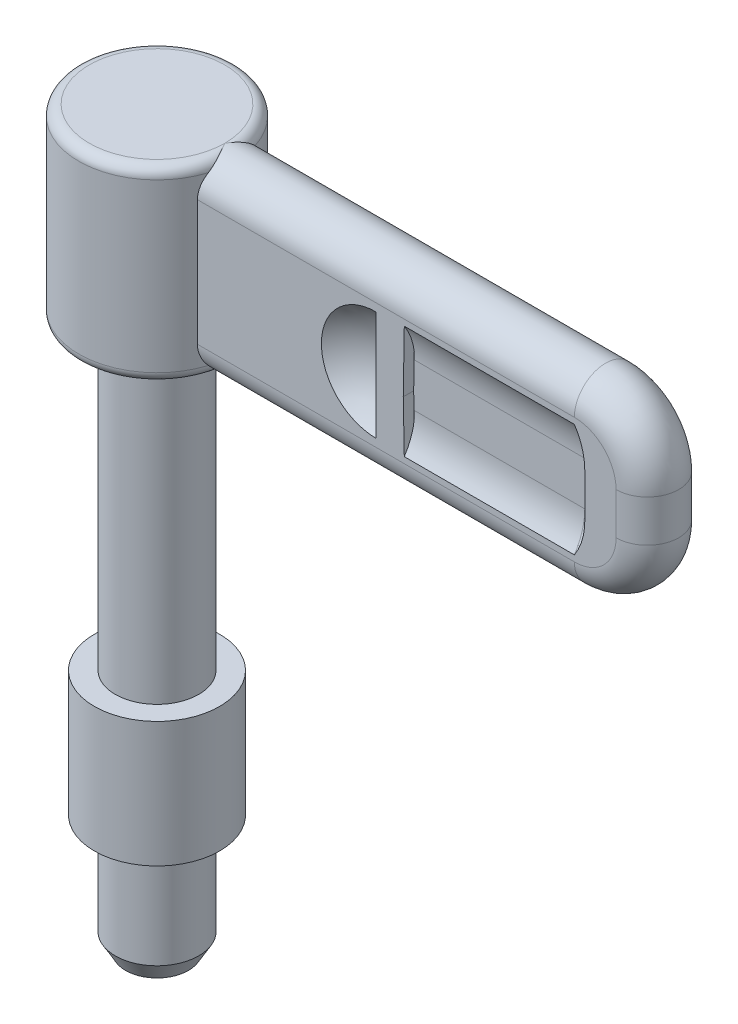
ISO-10303-21;
HEADER;
FILE_DESCRIPTION(('STEP AP214'),'2;1');
FILE_NAME('part.step','',(''),(''),'','','');
FILE_SCHEMA(('AUTOMOTIVE_DESIGN { 1 0 10303 214 1 1 1 1 }'));
ENDSEC;
DATA;
#1=APPLICATION_CONTEXT('core data for automotive mechanical design processes');
#2=APPLICATION_PROTOCOL_DEFINITION('international standard','automotive_design',2000,#1);
#3=PRODUCT_CONTEXT('',#1,'mechanical');
#4=PRODUCT('Part','Part','',(#3));
#5=PRODUCT_RELATED_PRODUCT_CATEGORY('part','',(#4));
#6=PRODUCT_DEFINITION_FORMATION('','',#4);
#7=PRODUCT_DEFINITION_CONTEXT('part definition',#1,'design');
#8=PRODUCT_DEFINITION('design','',#6,#7);
#9=PRODUCT_DEFINITION_SHAPE('','',#8);
#10=(LENGTH_UNIT() NAMED_UNIT(*) SI_UNIT(.MILLI.,.METRE.));
#11=(NAMED_UNIT(*) PLANE_ANGLE_UNIT() SI_UNIT($,.RADIAN.));
#12=(NAMED_UNIT(*) SI_UNIT($,.STERADIAN.) SOLID_ANGLE_UNIT());
#13=UNCERTAINTY_MEASURE_WITH_UNIT(LENGTH_MEASURE(1.E-05),#10,'distance_accuracy_value','');
#14=(GEOMETRIC_REPRESENTATION_CONTEXT(3) GLOBAL_UNCERTAINTY_ASSIGNED_CONTEXT((#13)) GLOBAL_UNIT_ASSIGNED_CONTEXT((#10,
#11,#12)) REPRESENTATION_CONTEXT('',''));
#15=CARTESIAN_POINT('',(0.,0.,0.));
#16=DIRECTION('',(0.,0.,1.));
#17=DIRECTION('',(1.,0.,0.));
#18=AXIS2_PLACEMENT_3D('',#15,#16,#17);
#19=CARTESIAN_POINT('',(0.,-12.,0.));
#20=DIRECTION('',(0.,-1.,0.));
#21=DIRECTION('',(7.69327835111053E-10,0.,1.));
#22=AXIS2_PLACEMENT_3D('',#19,#20,#21);
#23=CYLINDRICAL_SURFACE('',#22,6.);
#24=CARTESIAN_POINT('',(0.,0.,0.));
#25=DIRECTION('',(0.,-1.,0.));
#26=DIRECTION('',(0.,0.,-1.));
#27=AXIS2_PLACEMENT_3D('',#24,#25,#26);
#28=CIRCLE('',#27,6.);
#29=CARTESIAN_POINT('',(0.,0.,-6.));
#30=VERTEX_POINT('',#29);
#31=EDGE_CURVE('E565',#30,#30,#28,.T.);
#32=ORIENTED_EDGE('',*,*,#31,.F.);
#33=EDGE_LOOP('',(#32));
#34=FACE_BOUND('',#33,.T.);
#35=CARTESIAN_POINT('',(0.,12.,0.));
#36=DIRECTION('',(0.,1.,0.));
#37=DIRECTION('',(0.,0.,1.));
#38=AXIS2_PLACEMENT_3D('',#35,#36,#37);
#39=CIRCLE('',#38,6.);
#40=CARTESIAN_POINT('',(0.,12.,6.));
#41=VERTEX_POINT('',#40);
#42=EDGE_CURVE('E24',#41,#41,#39,.F.);
#43=ORIENTED_EDGE('',*,*,#42,.T.);
#44=EDGE_LOOP('',(#43));
#45=FACE_BOUND('',#44,.T.);
#46=ADVANCED_FACE('F16',(#34,#45),#23,.T.);
#47=CARTESIAN_POINT('',(-5.98600601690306,0.,-5.8267949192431));
#48=DIRECTION('',(0.,-1.,0.));
#49=DIRECTION('',(1.,0.,0.));
#50=AXIS2_PLACEMENT_3D('',#47,#48,#49);
#51=PLANE('',#50);
#52=CARTESIAN_POINT('',(0.,0.,0.));
#53=DIRECTION('',(0.,-1.,0.));
#54=DIRECTION('',(0.,0.,-1.));
#55=AXIS2_PLACEMENT_3D('',#52,#53,#54);
#56=CIRCLE('',#55,3.9);
#57=CARTESIAN_POINT('',(0.,0.,-3.9));
#58=VERTEX_POINT('',#57);
#59=EDGE_CURVE('E569',#58,#58,#56,.T.);
#60=ORIENTED_EDGE('',*,*,#59,.F.);
#61=EDGE_LOOP('',(#60));
#62=FACE_BOUND('',#61,.T.);
#63=ORIENTED_EDGE('',*,*,#31,.T.);
#64=EDGE_LOOP('',(#63));
#65=FACE_BOUND('',#64,.T.);
#66=ADVANCED_FACE('F18',(#62,#65),#51,.T.);
#67=CARTESIAN_POINT('',(2.90045765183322E-12,-4.00000000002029,0.));
#68=DIRECTION('',(0.,-1.,0.));
#69=DIRECTION('',(1.,0.,0.));
#70=AXIS2_PLACEMENT_3D('',#67,#68,#69);
#71=SPHERICAL_SURFACE('',#70,7.99999999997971);
#72=CARTESIAN_POINT('',(0.,-11.4113534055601,0.));
#73=DIRECTION('',(0.,1.,0.));
#74=DIRECTION('',(-1.,0.,0.));
#75=AXIS2_PLACEMENT_3D('',#72,#73,#74);
#76=CIRCLE('',#75,3.01194965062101);
#77=CARTESIAN_POINT('',(-3.01194965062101,-11.4113534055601,0.));
#78=VERTEX_POINT('',#77);
#79=EDGE_CURVE('E561',#78,#78,#76,.F.);
#80=ORIENTED_EDGE('',*,*,#79,.T.);
#81=EDGE_LOOP('',(#80));
#82=FACE_BOUND('',#81,.T.);
#83=ADVANCED_FACE('F1033',(#82),#71,.T.);
#84=CARTESIAN_POINT('',(0.,-9.7,0.));
#85=DIRECTION('',(0.,1.,0.));
#86=DIRECTION('',(0.,0.,-1.));
#87=AXIS2_PLACEMENT_3D('',#84,#85,#86);
#88=CONICAL_SURFACE('',#87,4.,0.523598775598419);
#89=ORIENTED_EDGE('',*,*,#79,.F.);
#90=EDGE_LOOP('',(#89));
#91=FACE_BOUND('',#90,.T.);
#92=CARTESIAN_POINT('',(0.,-9.7,0.));
#93=DIRECTION('',(0.,1.,0.));
#94=DIRECTION('',(0.,0.,-1.));
#95=AXIS2_PLACEMENT_3D('',#92,#93,#94);
#96=CIRCLE('',#95,4.);
#97=CARTESIAN_POINT('',(0.,-9.7,-4.));
#98=VERTEX_POINT('',#97);
#99=EDGE_CURVE('E1026',#98,#98,#96,.F.);
#100=ORIENTED_EDGE('',*,*,#99,.T.);
#101=EDGE_LOOP('',(#100));
#102=FACE_BOUND('',#101,.T.);
#103=ADVANCED_FACE('F1035',(#91,#102),#88,.T.);
#104=CARTESIAN_POINT('',(0.,-12.,0.));
#105=DIRECTION('',(0.,-1.,0.));
#106=DIRECTION('',(7.69313624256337E-10,0.,1.));
#107=AXIS2_PLACEMENT_3D('',#104,#105,#106);
#108=CYLINDRICAL_SURFACE('',#107,4.);
#109=ORIENTED_EDGE('',*,*,#99,.F.);
#110=EDGE_LOOP('',(#109));
#111=FACE_BOUND('',#110,.T.);
#112=CARTESIAN_POINT('',(0.,-0.5,0.));
#113=DIRECTION('',(0.,1.,0.));
#114=DIRECTION('',(0.,0.,-1.));
#115=AXIS2_PLACEMENT_3D('',#112,#113,#114);
#116=CIRCLE('',#115,4.);
#117=CARTESIAN_POINT('',(0.,-0.5,-4.));
#118=VERTEX_POINT('',#117);
#119=EDGE_CURVE('E1024',#118,#118,#116,.F.);
#120=ORIENTED_EDGE('',*,*,#119,.T.);
#121=EDGE_LOOP('',(#120));
#122=FACE_BOUND('',#121,.T.);
#123=ADVANCED_FACE('F1037',(#111,#122),#108,.T.);
#124=CARTESIAN_POINT('',(0.,-0.5,0.));
#125=DIRECTION('',(0.,-1.,0.));
#126=DIRECTION('',(1.92340044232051E-10,0.,1.));
#127=AXIS2_PLACEMENT_3D('',#124,#125,#126);
#128=CONICAL_SURFACE('',#127,4.,0.349065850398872);
#129=ORIENTED_EDGE('',*,*,#119,.F.);
#130=EDGE_LOOP('',(#129));
#131=FACE_BOUND('',#130,.T.);
#132=CARTESIAN_POINT('',(0.,-0.22525225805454,0.));
#133=DIRECTION('',(0.,1.,0.));
#134=DIRECTION('',(0.,0.,-1.));
#135=AXIS2_PLACEMENT_3D('',#132,#133,#134);
#136=CIRCLE('',#135,3.9);
#137=CARTESIAN_POINT('',(0.,-0.22525225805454,-3.9));
#138=VERTEX_POINT('',#137);
#139=EDGE_CURVE('E1016',#138,#138,#136,.F.);
#140=ORIENTED_EDGE('',*,*,#139,.T.);
#141=EDGE_LOOP('',(#140));
#142=FACE_BOUND('',#141,.T.);
#143=ADVANCED_FACE('F1045',(#131,#142),#128,.T.);
#144=CARTESIAN_POINT('',(0.,-12.,0.));
#145=DIRECTION('',(0.,-1.,0.));
#146=DIRECTION('',(1.92340488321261E-10,0.,1.));
#147=AXIS2_PLACEMENT_3D('',#144,#145,#146);
#148=CYLINDRICAL_SURFACE('',#147,3.9);
#149=ORIENTED_EDGE('',*,*,#139,.F.);
#150=EDGE_LOOP('',(#149));
#151=FACE_BOUND('',#150,.T.);
#152=ORIENTED_EDGE('',*,*,#59,.T.);
#153=EDGE_LOOP('',(#152));
#154=FACE_BOUND('',#153,.T.);
#155=ADVANCED_FACE('F1063',(#151,#154),#148,.T.);
#156=CARTESIAN_POINT('',(-5.98600601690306,12.,5.8267949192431));
#157=DIRECTION('',(0.,1.,0.));
#158=DIRECTION('',(1.,0.,0.));
#159=AXIS2_PLACEMENT_3D('',#156,#157,#158);
#160=PLANE('',#159);
#161=ORIENTED_EDGE('',*,*,#42,.F.);
#162=EDGE_LOOP('',(#161));
#163=FACE_BOUND('',#162,.T.);
#164=CARTESIAN_POINT('',(0.,12.,0.));
#165=DIRECTION('',(0.,-1.,0.));
#166=DIRECTION('',(0.,0.,1.));
#167=AXIS2_PLACEMENT_3D('',#164,#165,#166);
#168=CIRCLE('',#167,4.);
#169=CARTESIAN_POINT('',(0.,12.,4.));
#170=VERTEX_POINT('',#169);
#171=EDGE_CURVE('E572',#170,#170,#168,.T.);
#172=ORIENTED_EDGE('',*,*,#171,.T.);
#173=EDGE_LOOP('',(#172));
#174=FACE_BOUND('',#173,.T.);
#175=ADVANCED_FACE('F1060',(#163,#174),#160,.T.);
#176=CARTESIAN_POINT('',(0.,-12.,0.));
#177=DIRECTION('',(0.,-1.,0.));
#178=DIRECTION('',(7.69313624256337E-10,0.,1.));
#179=AXIS2_PLACEMENT_3D('',#176,#177,#178);
#180=CYLINDRICAL_SURFACE('',#179,4.);
#181=CARTESIAN_POINT('',(0.,41.,0.));
#182=DIRECTION('',(0.,-1.,0.));
#183=DIRECTION('',(0.,0.,-1.));
#184=AXIS2_PLACEMENT_3D('',#181,#182,#183);
#185=CIRCLE('',#184,4.);
#186=CARTESIAN_POINT('',(0.,41.,-4.));
#187=VERTEX_POINT('',#186);
#188=EDGE_CURVE('E11',#187,#187,#185,.F.);
#189=ORIENTED_EDGE('',*,*,#188,.F.);
#190=EDGE_LOOP('',(#189));
#191=FACE_BOUND('',#190,.T.);
#192=ORIENTED_EDGE('',*,*,#171,.F.);
#193=EDGE_LOOP('',(#192));
#194=FACE_BOUND('',#193,.T.);
#195=ADVANCED_FACE('F1062',(#191,#194),#180,.T.);
#196=CARTESIAN_POINT('',(26.7,52.1,-3.0000000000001));
#197=DIRECTION('',(-1.,0.,0.));
#198=DIRECTION('',(0.,0.,1.));
#199=AXIS2_PLACEMENT_3D('',#196,#197,#198);
#200=PLANE('',#199);
#201=CARTESIAN_POINT('',(26.7,52.1,-7.99999999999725));
#202=DIRECTION('',(1.,0.,0.));
#203=DIRECTION('',(0.,0.552770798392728,0.833333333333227));
#204=AXIS2_PLACEMENT_3D('',#201,#202,#203);
#205=CIRCLE('',#204,5.99999999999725);
#206=CARTESIAN_POINT('',(26.7,55.4166247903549,-3.));
#207=VERTEX_POINT('',#206);
#208=CARTESIAN_POINT('',(26.7,52.1,-2.));
#209=VERTEX_POINT('',#208);
#210=EDGE_CURVE('E838',#207,#209,#205,.T.);
#211=ORIENTED_EDGE('',*,*,#210,.T.);
#212=DIRECTION('',(0.,1.,0.));
#213=VECTOR('',#212,1.);
#214=CARTESIAN_POINT('',(26.7,52.1,-2.));
#215=LINE('',#214,#213);
#216=CARTESIAN_POINT('',(26.7,55.416624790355,-2.));
#217=VERTEX_POINT('',#216);
#218=EDGE_CURVE('E843',#209,#217,#215,.T.);
#219=ORIENTED_EDGE('',*,*,#218,.T.);
#220=DIRECTION('',(0.,0.,1.));
#221=VECTOR('',#220,1.);
#222=CARTESIAN_POINT('',(26.7,55.4166247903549,-3.0000000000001));
#223=LINE('',#222,#221);
#224=EDGE_CURVE('E821',#217,#207,#223,.F.);
#225=ORIENTED_EDGE('',*,*,#224,.T.);
#226=EDGE_LOOP('',(#211,#219,#225));
#227=FACE_BOUND('',#226,.T.);
#228=ADVANCED_FACE('F1080',(#227),#200,.T.);
#229=CARTESIAN_POINT('',(26.7,44.583375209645,-3.00000000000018));
#230=DIRECTION('',(-1.,0.,0.));
#231=DIRECTION('',(0.,0.,1.));
#232=AXIS2_PLACEMENT_3D('',#229,#230,#231);
#233=PLANE('',#232);
#234=CARTESIAN_POINT('',(26.7,47.9,-7.99999999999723));
#235=DIRECTION('',(1.,0.,0.));
#236=DIRECTION('',(0.,0.,1.));
#237=AXIS2_PLACEMENT_3D('',#234,#235,#236);
#238=CIRCLE('',#237,5.99999999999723);
#239=CARTESIAN_POINT('',(26.7,47.9,-2.));
#240=VERTEX_POINT('',#239);
#241=CARTESIAN_POINT('',(26.7,44.5833752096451,-3.0000000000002));
#242=VERTEX_POINT('',#241);
#243=EDGE_CURVE('E192',#240,#242,#238,.T.);
#244=ORIENTED_EDGE('',*,*,#243,.T.);
#245=DIRECTION('',(0.,-1.20792265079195E-13,1.));
#246=VECTOR('',#245,1.);
#247=CARTESIAN_POINT('',(26.7,44.5833752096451,-3.00000000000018));
#248=LINE('',#247,#246);
#249=CARTESIAN_POINT('',(26.7,44.583375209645,-2.));
#250=VERTEX_POINT('',#249);
#251=EDGE_CURVE('E209',#250,#242,#248,.F.);
#252=ORIENTED_EDGE('',*,*,#251,.F.);
#253=DIRECTION('',(0.,1.,0.));
#254=VECTOR('',#253,1.);
#255=CARTESIAN_POINT('',(26.7,44.583375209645,-2.));
#256=LINE('',#255,#254);
#257=EDGE_CURVE('E210',#250,#240,#256,.T.);
#258=ORIENTED_EDGE('',*,*,#257,.T.);
#259=EDGE_LOOP('',(#244,#252,#258));
#260=FACE_BOUND('',#259,.T.);
#261=ADVANCED_FACE('F208',(#260),#233,.T.);
#262=CARTESIAN_POINT('',(26.6,44.583375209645,-2.));
#263=DIRECTION('',(0.,0.,-1.));
#264=DIRECTION('',(0.,1.,0.));
#265=AXIS2_PLACEMENT_3D('',#262,#263,#264);
#266=PLANE('',#265);
#267=DIRECTION('',(-0.0168991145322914,-0.999857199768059,0.));
#268=VECTOR('',#267,1.);
#269=CARTESIAN_POINT('',(26.7,55.416624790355,-2.));
#270=LINE('',#269,#268);
#271=CARTESIAN_POINT('',(26.6,49.5,-2.));
#272=VERTEX_POINT('',#271);
#273=EDGE_CURVE('E826',#217,#272,#270,.T.);
#274=ORIENTED_EDGE('',*,*,#273,.F.);
#275=ORIENTED_EDGE('',*,*,#218,.F.);
#276=DIRECTION('',(1.,0.,0.));
#277=VECTOR('',#276,1.);
#278=CARTESIAN_POINT('',(26.7,52.1,-2.));
#279=LINE('',#278,#277);
#280=CARTESIAN_POINT('',(43.,52.1,-2.));
#281=VERTEX_POINT('',#280);
#282=EDGE_CURVE('E848',#209,#281,#279,.T.);
#283=ORIENTED_EDGE('',*,*,#282,.T.);
#284=DIRECTION('',(0.,-1.,0.));
#285=VECTOR('',#284,1.);
#286=CARTESIAN_POINT('',(43.,52.1,-2.));
#287=LINE('',#286,#285);
#288=CARTESIAN_POINT('',(43.,47.9,-2.));
#289=VERTEX_POINT('',#288);
#290=EDGE_CURVE('E852',#289,#281,#287,.F.);
#291=ORIENTED_EDGE('',*,*,#290,.F.);
#292=DIRECTION('',(-1.,0.,0.));
#293=VECTOR('',#292,1.);
#294=CARTESIAN_POINT('',(43.,47.9,-2.));
#295=LINE('',#294,#293);
#296=EDGE_CURVE('E856',#240,#289,#295,.F.);
#297=ORIENTED_EDGE('',*,*,#296,.F.);
#298=ORIENTED_EDGE('',*,*,#257,.F.);
#299=DIRECTION('',(0.020334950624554,-0.999793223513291,0.));
#300=VECTOR('',#299,1.);
#301=CARTESIAN_POINT('',(26.6,49.5,-2.));
#302=LINE('',#301,#300);
#303=EDGE_CURVE('E217',#272,#250,#302,.T.);
#304=ORIENTED_EDGE('',*,*,#303,.F.);
#305=EDGE_LOOP('',(#274,#275,#283,#291,#297,#298,#304));
#306=FACE_BOUND('',#305,.T.);
#307=ADVANCED_FACE('F882',(#306),#266,.T.);
#308=CARTESIAN_POINT('',(26.7,44.583375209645,3.));
#309=DIRECTION('',(-1.,0.,0.));
#310=DIRECTION('',(0.,1.,0.));
#311=AXIS2_PLACEMENT_3D('',#308,#309,#310);
#312=PLANE('',#311);
#313=DIRECTION('',(0.,1.,0.));
#314=VECTOR('',#313,1.);
#315=CARTESIAN_POINT('',(26.7,44.583375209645,2.));
#316=LINE('',#315,#314);
#317=CARTESIAN_POINT('',(26.7,44.583375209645,2.));
#318=VERTEX_POINT('',#317);
#319=CARTESIAN_POINT('',(26.7,47.9,2.));
#320=VERTEX_POINT('',#319);
#321=EDGE_CURVE('E1419',#318,#320,#316,.T.);
#322=ORIENTED_EDGE('',*,*,#321,.F.);
#323=DIRECTION('',(0.,0.,1.));
#324=VECTOR('',#323,1.);
#325=CARTESIAN_POINT('',(26.7,44.583375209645,2.));
#326=LINE('',#325,#324);
#327=CARTESIAN_POINT('',(26.7,44.583375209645,3.));
#328=VERTEX_POINT('',#327);
#329=EDGE_CURVE('E805',#318,#328,#326,.T.);
#330=ORIENTED_EDGE('',*,*,#329,.T.);
#331=CARTESIAN_POINT('',(26.7,47.9,7.99999999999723));
#332=DIRECTION('',(-1.,0.,0.));
#333=DIRECTION('',(0.,0.,-1.));
#334=AXIS2_PLACEMENT_3D('',#331,#332,#333);
#335=CIRCLE('',#334,5.99999999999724);
#336=EDGE_CURVE('E1421',#328,#320,#335,.F.);
#337=ORIENTED_EDGE('',*,*,#336,.T.);
#338=EDGE_LOOP('',(#322,#330,#337));
#339=FACE_BOUND('',#338,.T.);
#340=ADVANCED_FACE('F1285',(#339),#312,.T.);
#341=CARTESIAN_POINT('',(26.7,52.1,3.));
#342=DIRECTION('',(-1.,0.,0.));
#343=DIRECTION('',(0.,1.,0.));
#344=AXIS2_PLACEMENT_3D('',#341,#342,#343);
#345=PLANE('',#344);
#346=DIRECTION('',(0.,0.,-1.));
#347=VECTOR('',#346,1.);
#348=CARTESIAN_POINT('',(26.7,55.416624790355,3.));
#349=LINE('',#348,#347);
#350=CARTESIAN_POINT('',(26.7,55.416624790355,2.));
#351=VERTEX_POINT('',#350);
#352=CARTESIAN_POINT('',(26.7,55.416624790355,3.));
#353=VERTEX_POINT('',#352);
#354=EDGE_CURVE('E813',#351,#353,#349,.F.);
#355=ORIENTED_EDGE('',*,*,#354,.F.);
#356=DIRECTION('',(0.,1.,0.));
#357=VECTOR('',#356,1.);
#358=CARTESIAN_POINT('',(26.7,52.1,2.));
#359=LINE('',#358,#357);
#360=CARTESIAN_POINT('',(26.7,52.1,2.));
#361=VERTEX_POINT('',#360);
#362=EDGE_CURVE('E1435',#361,#351,#359,.T.);
#363=ORIENTED_EDGE('',*,*,#362,.F.);
#364=CARTESIAN_POINT('',(26.7,52.1,7.99999999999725));
#365=DIRECTION('',(-1.,0.,0.));
#366=DIRECTION('',(0.,0.552770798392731,-0.833333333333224));
#367=AXIS2_PLACEMENT_3D('',#364,#365,#366);
#368=CIRCLE('',#367,5.99999999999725);
#369=EDGE_CURVE('E709',#361,#353,#368,.F.);
#370=ORIENTED_EDGE('',*,*,#369,.T.);
#371=EDGE_LOOP('',(#355,#363,#370));
#372=FACE_BOUND('',#371,.T.);
#373=ADVANCED_FACE('F689',(#372),#345,.T.);
#374=CARTESIAN_POINT('',(43.,44.583375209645,2.));
#375=DIRECTION('',(0.,0.,1.));
#376=DIRECTION('',(0.,1.,0.));
#377=AXIS2_PLACEMENT_3D('',#374,#375,#376);
#378=PLANE('',#377);
#379=DIRECTION('',(0.,1.,0.));
#380=VECTOR('',#379,1.);
#381=CARTESIAN_POINT('',(43.,47.9,2.));
#382=LINE('',#381,#380);
#383=CARTESIAN_POINT('',(43.,47.9,2.));
#384=VERTEX_POINT('',#383);
#385=CARTESIAN_POINT('',(43.,52.1,2.));
#386=VERTEX_POINT('',#385);
#387=EDGE_CURVE('E1445',#384,#386,#382,.T.);
#388=ORIENTED_EDGE('',*,*,#387,.T.);
#389=DIRECTION('',(-1.,0.,0.));
#390=VECTOR('',#389,1.);
#391=CARTESIAN_POINT('',(43.,52.1,2.));
#392=LINE('',#391,#390);
#393=EDGE_CURVE('E1440',#361,#386,#392,.F.);
#394=ORIENTED_EDGE('',*,*,#393,.F.);
#395=ORIENTED_EDGE('',*,*,#362,.T.);
#396=DIRECTION('',(-0.0168991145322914,-0.999857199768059,0.));
#397=VECTOR('',#396,1.);
#398=CARTESIAN_POINT('',(26.7,55.416624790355,2.));
#399=LINE('',#398,#397);
#400=CARTESIAN_POINT('',(26.6,49.5,2.));
#401=VERTEX_POINT('',#400);
#402=EDGE_CURVE('E1425',#351,#401,#399,.T.);
#403=ORIENTED_EDGE('',*,*,#402,.T.);
#404=DIRECTION('',(0.020334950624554,-0.999793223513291,0.));
#405=VECTOR('',#404,1.);
#406=CARTESIAN_POINT('',(26.6,49.5,2.));
#407=LINE('',#406,#405);
#408=EDGE_CURVE('E1423',#401,#318,#407,.T.);
#409=ORIENTED_EDGE('',*,*,#408,.T.);
#410=ORIENTED_EDGE('',*,*,#321,.T.);
#411=DIRECTION('',(-1.,0.,0.));
#412=VECTOR('',#411,1.);
#413=CARTESIAN_POINT('',(43.,47.9,2.));
#414=LINE('',#413,#412);
#415=EDGE_CURVE('E674',#320,#384,#414,.F.);
#416=ORIENTED_EDGE('',*,*,#415,.T.);
#417=EDGE_LOOP('',(#388,#394,#395,#403,#409,#410,#416));
#418=FACE_BOUND('',#417,.T.);
#419=ADVANCED_FACE('F686',(#418),#378,.T.);
#420=CARTESIAN_POINT('',(-6.5919903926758,59.,6.64455372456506));
#421=DIRECTION('',(0.,1.,0.));
#422=DIRECTION('',(1.,0.,0.));
#423=AXIS2_PLACEMENT_3D('',#420,#421,#422);
#424=PLANE('',#423);
#425=CARTESIAN_POINT('',(0.,59.,0.));
#426=DIRECTION('',(0.,1.,0.));
#427=DIRECTION('',(-0.707106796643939,0.,0.707106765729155));
#428=AXIS2_PLACEMENT_3D('',#425,#426,#427);
#429=CIRCLE('',#428,6.50000008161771);
#430=CARTESIAN_POINT('',(6.50000008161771,59.,0.));
#431=VERTEX_POINT('',#430);
#432=EDGE_CURVE('E555',#431,#431,#429,.F.);
#433=ORIENTED_EDGE('',*,*,#432,.F.);
#434=EDGE_LOOP('',(#433));
#435=FACE_BOUND('',#434,.T.);
#436=ADVANCED_FACE('F488',(#435),#424,.T.);
#437=CARTESIAN_POINT('',(24.,50.,-8.5));
#438=DIRECTION('',(0.,1.,0.));
#439=DIRECTION('',(-0.708277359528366,0.,0.705934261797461));
#440=AXIS2_PLACEMENT_3D('',#437,#438,#439);
#441=SPHERICAL_SURFACE('',#440,7.6);
#442=CARTESIAN_POINT('',(24.,55.2449976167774,-3.00000000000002));
#443=CARTESIAN_POINT('',(24.,55.1577244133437,-2.91676991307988));
#444=CARTESIAN_POINT('',(24.,55.0684671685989,-2.83562060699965));
#445=CARTESIAN_POINT('',(24.,54.8861935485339,-2.67765966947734));
#446=CARTESIAN_POINT('',(24.,54.7931771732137,-2.60084803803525));
#447=CARTESIAN_POINT('',(24.,54.6035942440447,-2.45173856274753));
#448=CARTESIAN_POINT('',(24.,54.507027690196,-2.3794407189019));
#449=CARTESIAN_POINT('',(24.,54.3105636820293,-2.23952207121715));
#450=CARTESIAN_POINT('',(24.,54.2106662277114,-2.17190126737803));
#451=CARTESIAN_POINT('',(24.,54.0077666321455,-2.04149006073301));
#452=CARTESIAN_POINT('',(24.,53.9047644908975,-1.97869965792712));
#453=CARTESIAN_POINT('',(24.,53.6958889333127,-1.85809148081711));
#454=CARTESIAN_POINT('',(24.,53.5900155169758,-1.80027370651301));
#455=CARTESIAN_POINT('',(24.,53.3756372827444,-1.68974179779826));
#456=CARTESIAN_POINT('',(24.,53.2671324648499,-1.63702766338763));
#457=CARTESIAN_POINT('',(24.,53.0477372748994,-1.53682246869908));
#458=CARTESIAN_POINT('',(24.,52.9368469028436,-1.48933140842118));
#459=CARTESIAN_POINT('',(24.,52.7129318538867,-1.39967996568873));
#460=CARTESIAN_POINT('',(24.,52.5999071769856,-1.35751958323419));
#461=CARTESIAN_POINT('',(24.,52.3719796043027,-1.27862502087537));
#462=CARTESIAN_POINT('',(24.,52.2570767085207,-1.24189084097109));
#463=CARTESIAN_POINT('',(24.,52.0256530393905,-1.17393191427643));
#464=CARTESIAN_POINT('',(24.,51.9091322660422,-1.14270716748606));
#465=CARTESIAN_POINT('',(24.,51.6747368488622,-1.08583785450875));
#466=CARTESIAN_POINT('',(24.,51.5568622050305,-1.06019328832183));
#467=CARTESIAN_POINT('',(24.,51.320026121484,-1.01454244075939));
#468=CARTESIAN_POINT('',(24.,51.2010646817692,-0.994536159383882));
#469=CARTESIAN_POINT('',(24.,50.9623245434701,-0.960207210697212));
#470=CARTESIAN_POINT('',(24.,50.8425458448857,-0.945884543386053));
#471=CARTESIAN_POINT('',(24.,50.6024425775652,-0.922955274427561));
#472=CARTESIAN_POINT('',(24.,50.482118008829,-0.91434867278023));
#473=CARTESIAN_POINT('',(24.,50.2411956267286,-0.902871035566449));
#474=CARTESIAN_POINT('',(24.,50.1205978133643,-0.899999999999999));
#475=CARTESIAN_POINT('',(24.,49.8794021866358,-0.899999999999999));
#476=CARTESIAN_POINT('',(24.,49.7588043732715,-0.902871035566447));
#477=CARTESIAN_POINT('',(24.,49.517881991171,-0.914348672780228));
#478=CARTESIAN_POINT('',(24.,49.3975574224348,-0.922955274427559));
#479=CARTESIAN_POINT('',(24.,49.1574541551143,-0.94588454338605));
#480=CARTESIAN_POINT('',(24.,49.03767545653,-0.960207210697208));
#481=CARTESIAN_POINT('',(24.,48.7989353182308,-0.994536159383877));
#482=CARTESIAN_POINT('',(24.,48.679973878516,-1.01454244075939));
#483=CARTESIAN_POINT('',(24.,48.4431377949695,-1.06019328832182));
#484=CARTESIAN_POINT('',(24.,48.3252631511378,-1.08583785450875));
#485=CARTESIAN_POINT('',(24.,48.0908677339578,-1.14270716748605));
#486=CARTESIAN_POINT('',(24.,47.9743469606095,-1.17393191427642));
#487=CARTESIAN_POINT('',(24.,47.7429232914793,-1.24189084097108));
#488=CARTESIAN_POINT('',(24.,47.6280203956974,-1.27862502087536));
#489=CARTESIAN_POINT('',(24.,47.4000928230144,-1.35751958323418));
#490=CARTESIAN_POINT('',(24.,47.2870681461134,-1.39967996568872));
#491=CARTESIAN_POINT('',(24.,47.0631530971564,-1.48933140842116));
#492=CARTESIAN_POINT('',(24.,46.9522627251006,-1.53682246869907));
#493=CARTESIAN_POINT('',(24.,46.7328675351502,-1.63702766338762));
#494=CARTESIAN_POINT('',(24.,46.6243627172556,-1.68974179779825));
#495=CARTESIAN_POINT('',(24.,46.4099844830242,-1.80027370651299));
#496=CARTESIAN_POINT('',(24.,46.3041110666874,-1.8580914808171));
#497=CARTESIAN_POINT('',(24.,46.0952355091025,-1.97869965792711));
#498=CARTESIAN_POINT('',(24.,45.9922333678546,-2.041490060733));
#499=CARTESIAN_POINT('',(24.,45.7893337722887,-2.17190126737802));
#500=CARTESIAN_POINT('',(24.,45.6894363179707,-2.23952207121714));
#501=CARTESIAN_POINT('',(24.,45.492972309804,-2.37944071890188));
#502=CARTESIAN_POINT('',(24.,45.3964057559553,-2.45173856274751));
#503=CARTESIAN_POINT('',(24.,45.2068228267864,-2.60084803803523));
#504=CARTESIAN_POINT('',(24.,45.1138064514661,-2.67765966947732));
#505=CARTESIAN_POINT('',(24.,44.9315328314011,-2.83562060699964));
#506=CARTESIAN_POINT('',(24.,44.8422755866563,-2.91676991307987));
#507=CARTESIAN_POINT('',(24.,44.7550023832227,-3.));
#508=B_SPLINE_CURVE_WITH_KNOTS('',3,(#442,#443,#444,#445,#446,#447,#448,#449,#450,#451,#452,
#453,#454,#455,#456,#457,#458,#459,#460,#461,#462,#463,#464,#465,#466,#467,#468,#469,#470,#471,
#472,#473,#474,#475,#476,#477,#478,#479,#480,#481,#482,#483,#484,#485,#486,#487,#488,#489,#490,
#491,#492,#493,#494,#495,#496,#497,#498,#499,#500,#501,#502,#503,#504,#505,#506,#507),
.UNSPECIFIED.,.F.,.F.,(4,2,2,2,2,2,2,2,2,2,2,2,2,2,2,2,2,2,2,2,2,2,2,2,2,2,2,2,2,2,2,2,4),(0.,
0.361759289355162,0.723518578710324,1.08527786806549,1.44703715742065,1.80879644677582,
2.17055573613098,2.53231502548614,2.8940743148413,3.25583360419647,3.61759289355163,
3.9793521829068,4.34111147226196,4.70287076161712,5.06463005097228,5.42638934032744,
5.78814862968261,6.14990791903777,6.51166720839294,6.8734264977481,7.23518578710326,
7.59694507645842,7.95870436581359,8.32046365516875,8.68222294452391,9.04398223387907,
9.40574152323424,9.7675008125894,10.1292601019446,10.4910193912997,10.8527786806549,
11.2145379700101,11.5762972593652),.UNSPECIFIED.);
#509=CARTESIAN_POINT('',(24.,55.2449976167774,-3.));
#510=VERTEX_POINT('',#509);
#511=CARTESIAN_POINT('',(24.,44.7550023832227,-3.));
#512=VERTEX_POINT('',#511);
#513=EDGE_CURVE('E576',#510,#512,#508,.T.);
#514=ORIENTED_EDGE('',*,*,#513,.T.);
#515=CARTESIAN_POINT('',(24.,55.2449976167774,-3.));
#516=CARTESIAN_POINT('',(23.7151261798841,55.2449976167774,-3.));
#517=CARTESIAN_POINT('',(23.4388980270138,55.2229701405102,-3.));
#518=CARTESIAN_POINT('',(22.9004954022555,55.1370623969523,-3.));
#519=CARTESIAN_POINT('',(22.6383209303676,55.0731821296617,-3.));
#520=CARTESIAN_POINT('',(21.999053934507,54.8647817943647,-3.));
#521=CARTESIAN_POINT('',(21.6315064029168,54.6967726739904,-3.));
#522=CARTESIAN_POINT('',(20.8874735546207,54.2499361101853,-3.));
#523=CARTESIAN_POINT('',(20.5168752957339,53.9506197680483,-3.));
#524=CARTESIAN_POINT('',(19.5480014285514,52.9256197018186,-3.));
#525=CARTESIAN_POINT('',(19.0979860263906,52.0890991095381,-3.));
#526=CARTESIAN_POINT('',(18.4825352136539,49.4183108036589,-3.));
#527=CARTESIAN_POINT('',(19.0111775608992,47.5712756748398,-3.));
#528=CARTESIAN_POINT('',(20.6757585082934,45.9066947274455,-3.));
#529=CARTESIAN_POINT('',(21.1114175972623,45.5831930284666,-3.));
#530=CARTESIAN_POINT('',(21.9715509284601,45.147582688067,-3.));
#531=CARTESIAN_POINT('',(22.3462263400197,45.0053369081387,-3.));
#532=CARTESIAN_POINT('',(23.1510585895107,44.8057548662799,-3.));
#533=CARTESIAN_POINT('',(23.5704816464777,44.7550023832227,-3.));
#534=CARTESIAN_POINT('',(24.,44.7550023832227,-3.));
#535=B_SPLINE_CURVE_WITH_KNOTS('',3,(#515,#516,#517,#518,#519,#520,#521,#522,#523,#524,#525,
#526,#527,#528,#529,#530,#531,#532,#533,#534),.UNSPECIFIED.,.F.,.F.,(4,2,2,2,2,2,2,2,2,4),(0.,
0.0494877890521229,0.0989755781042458,0.172696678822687,0.262079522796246,0.433728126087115,
0.763636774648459,0.862742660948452,0.930192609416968,1.),.UNSPECIFIED.);
#536=EDGE_CURVE('E278',#510,#512,#535,.T.);
#537=ORIENTED_EDGE('',*,*,#536,.F.);
#538=EDGE_LOOP('',(#514,#537));
#539=FACE_BOUND('',#538,.T.);
#540=ADVANCED_FACE('F633',(#539),#441,.F.);
#541=CARTESIAN_POINT('',(24.,44.7550023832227,-0.899999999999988));
#542=DIRECTION('',(-1.,0.,0.));
#543=DIRECTION('',(0.,1.,0.));
#544=AXIS2_PLACEMENT_3D('',#541,#542,#543);
#545=PLANE('',#544);
#546=ORIENTED_EDGE('',*,*,#513,.F.);
#547=DIRECTION('',(0.,1.,0.));
#548=VECTOR('',#547,1.);
#549=CARTESIAN_POINT('',(24.,44.7550023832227,-3.));
#550=LINE('',#549,#548);
#551=EDGE_CURVE('E1397',#512,#510,#550,.T.);
#552=ORIENTED_EDGE('',*,*,#551,.F.);
#553=EDGE_LOOP('',(#546,#552));
#554=FACE_BOUND('',#553,.T.);
#555=ADVANCED_FACE('F642',(#554),#545,.T.);
#556=CARTESIAN_POINT('',(26.6,49.5,-3.0000000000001));
#557=DIRECTION('',(0.999857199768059,-0.0168991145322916,0.));
#558=DIRECTION('',(0.0168991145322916,0.999857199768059,0.));
#559=AXIS2_PLACEMENT_3D('',#556,#557,#558);
#560=PLANE('',#559);
#561=DIRECTION('',(-0.0168991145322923,-0.999857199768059,0.));
#562=VECTOR('',#561,1.);
#563=CARTESIAN_POINT('',(26.7,55.4166247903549,-3.));
#564=LINE('',#563,#562);
#565=CARTESIAN_POINT('',(26.6,49.5,-3.));
#566=VERTEX_POINT('',#565);
#567=EDGE_CURVE('E224',#207,#566,#564,.T.);
#568=ORIENTED_EDGE('',*,*,#567,.F.);
#569=ORIENTED_EDGE('',*,*,#224,.F.);
#570=ORIENTED_EDGE('',*,*,#273,.T.);
#571=DIRECTION('',(0.,0.,-1.));
#572=VECTOR('',#571,1.);
#573=CARTESIAN_POINT('',(26.6,49.5,-2.));
#574=LINE('',#573,#572);
#575=EDGE_CURVE('E831',#272,#566,#574,.T.);
#576=ORIENTED_EDGE('',*,*,#575,.T.);
#577=EDGE_LOOP('',(#568,#569,#570,#576));
#578=FACE_BOUND('',#577,.T.);
#579=ADVANCED_FACE('F980',(#578),#560,.T.);
#580=CARTESIAN_POINT('',(26.7,52.1,-7.99999999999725));
#581=DIRECTION('',(1.,0.,0.));
#582=DIRECTION('',(0.,0.552770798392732,0.833333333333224));
#583=AXIS2_PLACEMENT_3D('',#580,#581,#582);
#584=CYLINDRICAL_SURFACE('',#583,5.99999999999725);
#585=CARTESIAN_POINT('',(43.,52.1,-2.));
#586=CARTESIAN_POINT('',(43.,52.1732258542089,-2.00043940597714));
#587=CARTESIAN_POINT('',(43.,52.2464467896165,-2.00209048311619));
#588=CARTESIAN_POINT('',(43.,52.3928080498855,-2.00787615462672));
#589=CARTESIAN_POINT('',(43.,52.465948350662,-2.01201135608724));
#590=CARTESIAN_POINT('',(43.,52.6120368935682,-2.02282494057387));
#591=CARTESIAN_POINT('',(43.,52.6849851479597,-2.02950315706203));
#592=CARTESIAN_POINT('',(43.,52.8305801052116,-2.04544741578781));
#593=CARTESIAN_POINT('',(43.,52.9032268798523,-2.054712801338));
#594=CARTESIAN_POINT('',(43.,53.0481135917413,-2.07586380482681));
#595=CARTESIAN_POINT('',(43.,53.1203536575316,-2.0877485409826));
#596=CARTESIAN_POINT('',(43.,53.2643253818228,-2.1141574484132));
#597=CARTESIAN_POINT('',(43.,53.336057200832,-2.12868074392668));
#598=CARTESIAN_POINT('',(43.,53.4789148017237,-2.16037287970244));
#599=CARTESIAN_POINT('',(43.,53.5500407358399,-2.17754103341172));
#600=CARTESIAN_POINT('',(43.,53.69159288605,-2.21451579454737));
#601=CARTESIAN_POINT('',(43.,53.7620191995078,-2.23432202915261));
#602=CARTESIAN_POINT('',(43.,53.9020824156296,-2.2765526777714));
#603=CARTESIAN_POINT('',(43.,53.9717193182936,-2.29897709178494));
#604=CARTESIAN_POINT('',(43.,54.110118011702,-2.3464106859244));
#605=CARTESIAN_POINT('',(43.,54.1788796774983,-2.37142023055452));
#606=CARTESIAN_POINT('',(43.,54.3154461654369,-2.42397762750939));
#607=CARTESIAN_POINT('',(43.,54.3832507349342,-2.45152613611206));
#608=CARTESIAN_POINT('',(43.,54.5178252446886,-2.50910207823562));
#609=CARTESIAN_POINT('',(43.,54.5845948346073,-2.53913033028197));
#610=CARTESIAN_POINT('',(43.,54.7170254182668,-2.60159363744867));
#611=CARTESIAN_POINT('',(43.,54.782686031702,-2.63402949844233));
#612=CARTESIAN_POINT('',(43.,54.9128286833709,-2.70122325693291));
#613=CARTESIAN_POINT('',(43.,54.9773104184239,-2.73598174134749));
#614=CARTESIAN_POINT('',(43.,55.1050283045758,-2.80772390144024));
#615=CARTESIAN_POINT('',(43.,55.1682643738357,-2.84470772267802));
#616=CARTESIAN_POINT('',(43.,55.2934302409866,-2.92079056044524));
#617=CARTESIAN_POINT('',(43.,55.355360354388,-2.95988905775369));
#618=CARTESIAN_POINT('',(43.,55.4166247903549,-3.00000000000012));
#619=B_SPLINE_CURVE_WITH_KNOTS('',3,(#585,#586,#587,#588,#589,#590,#591,#592,#593,#594,#595,
#596,#597,#598,#599,#600,#601,#602,#603,#604,#605,#606,#607,#608,#609,#610,#611,#612,#613,#614,
#615,#616,#617,#618),.UNSPECIFIED.,.F.,.F.,(4,2,2,2,2,2,2,2,2,2,2,2,2,2,2,2,4),(0.,
0.219674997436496,0.439403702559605,0.659118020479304,0.878776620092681,1.09836138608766,
1.31787340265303,1.53732853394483,1.75675268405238,1.97617683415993,2.19563196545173,
2.4151439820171,2.63472874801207,2.85438734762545,3.07410166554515,3.29383037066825,
3.51350536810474),.UNSPECIFIED.);
#620=CARTESIAN_POINT('',(43.,55.4166247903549,-3.));
#621=VERTEX_POINT('',#620);
#622=EDGE_CURVE('E40',#621,#281,#619,.F.);
#623=ORIENTED_EDGE('',*,*,#622,.T.);
#624=ORIENTED_EDGE('',*,*,#282,.F.);
#625=ORIENTED_EDGE('',*,*,#210,.F.);
#626=DIRECTION('',(-1.,0.,0.));
#627=VECTOR('',#626,1.);
#628=CARTESIAN_POINT('',(43.,55.4166247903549,-3.));
#629=LINE('',#628,#627);
#630=EDGE_CURVE('E1398',#207,#621,#629,.F.);
#631=ORIENTED_EDGE('',*,*,#630,.T.);
#632=EDGE_LOOP('',(#623,#624,#625,#631));
#633=FACE_BOUND('',#632,.T.);
#634=ADVANCED_FACE('F941',(#633),#584,.F.);
#635=CARTESIAN_POINT('',(43.,55.4166247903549,-3.00000000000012));
#636=CARTESIAN_POINT('',(43.,53.9057892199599,-2.01087470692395));
#637=CARTESIAN_POINT('',(43.,52.1,-2.));
#638=CARTESIAN_POINT('',(43.,55.4166247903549,-3.00000000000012));
#639=CARTESIAN_POINT('',(43.388428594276,53.9057892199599,-2.01087470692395));
#640=CARTESIAN_POINT('',(43.3926990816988,52.1,-2.));
#641=CARTESIAN_POINT('',(43.,55.4166247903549,-3.00000000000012));
#642=CARTESIAN_POINT('',(43.7818890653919,53.9057892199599,-2.21811093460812));
#643=CARTESIAN_POINT('',(43.7904853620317,52.1,-2.20951463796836));
#644=CARTESIAN_POINT('',(43.,55.4166247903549,-3.00000000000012));
#645=CARTESIAN_POINT('',(43.989125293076,53.9057892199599,-2.61157140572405));
#646=CARTESIAN_POINT('',(44.,52.1,-2.60730091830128));
#647=CARTESIAN_POINT('',(43.,55.4166247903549,-3.00000000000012));
#648=CARTESIAN_POINT('',(43.989125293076,53.9057892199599,-3.));
#649=CARTESIAN_POINT('',(44.,52.1,-3.));
#650=B_SPLINE_SURFACE_WITH_KNOTS('',4,2,((#635,#636,#637),(#638,#639,#640),(#641,#642,#643),
(#644,#645,#646),(#647,#648,#649)),.UNSPECIFIED.,.F.,.F.,.F.,(5,5),(3,3),(0.,1.),(0.,1.),.UNSPECIFIED.);
#651=CARTESIAN_POINT('',(43.,55.4166247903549,-3.00000000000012));
#652=CARTESIAN_POINT('',(43.0401109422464,55.355360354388,-3.00000000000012));
#653=CARTESIAN_POINT('',(43.0792094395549,55.2934302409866,-3.00000000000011));
#654=CARTESIAN_POINT('',(43.1552922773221,55.1682643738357,-3.0000000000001));
#655=CARTESIAN_POINT('',(43.1922760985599,55.1050283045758,-3.0000000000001));
#656=CARTESIAN_POINT('',(43.2640182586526,54.9773104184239,-3.00000000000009));
#657=CARTESIAN_POINT('',(43.2987767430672,54.9128286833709,-3.00000000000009));
#658=CARTESIAN_POINT('',(43.3659705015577,54.7826860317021,-3.00000000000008));
#659=CARTESIAN_POINT('',(43.3984063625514,54.7170254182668,-3.00000000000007));
#660=CARTESIAN_POINT('',(43.4608696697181,54.5845948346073,-3.00000000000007));
#661=CARTESIAN_POINT('',(43.4908979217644,54.5178252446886,-3.00000000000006));
#662=CARTESIAN_POINT('',(43.548473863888,54.3832507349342,-3.00000000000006));
#663=CARTESIAN_POINT('',(43.5760223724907,54.3154461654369,-3.00000000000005));
#664=CARTESIAN_POINT('',(43.6285797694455,54.1788796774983,-3.00000000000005));
#665=CARTESIAN_POINT('',(43.6535893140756,54.110118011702,-3.00000000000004));
#666=CARTESIAN_POINT('',(43.7010229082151,53.9717193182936,-3.00000000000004));
#667=CARTESIAN_POINT('',(43.7234473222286,53.9020824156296,-3.00000000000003));
#668=CARTESIAN_POINT('',(43.7656779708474,53.7620191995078,-3.00000000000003));
#669=CARTESIAN_POINT('',(43.7854842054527,53.69159288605,-3.00000000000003));
#670=CARTESIAN_POINT('',(43.8224589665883,53.5500407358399,-3.00000000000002));
#671=CARTESIAN_POINT('',(43.8396271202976,53.4789148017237,-3.00000000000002));
#672=CARTESIAN_POINT('',(43.8713192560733,53.336057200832,-3.00000000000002));
#673=CARTESIAN_POINT('',(43.8858425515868,53.2643253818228,-3.00000000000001));
#674=CARTESIAN_POINT('',(43.9122514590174,53.1203536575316,-3.00000000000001));
#675=CARTESIAN_POINT('',(43.9241361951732,53.0481135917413,-3.00000000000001));
#676=CARTESIAN_POINT('',(43.945287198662,52.9032268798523,-3.00000000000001));
#677=CARTESIAN_POINT('',(43.9545525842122,52.8305801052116,-3.00000000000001));
#678=CARTESIAN_POINT('',(43.970496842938,52.6849851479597,-3.));
#679=CARTESIAN_POINT('',(43.9771750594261,52.6120368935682,-3.));
#680=CARTESIAN_POINT('',(43.9879886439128,52.465948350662,-3.));
#681=CARTESIAN_POINT('',(43.9921238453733,52.3928080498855,-3.));
#682=CARTESIAN_POINT('',(43.9979095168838,52.2464467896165,-3.));
#683=CARTESIAN_POINT('',(43.9995605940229,52.1732258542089,-3.));
#684=CARTESIAN_POINT('',(44.,52.1,-3.));
#685=B_SPLINE_CURVE_WITH_KNOTS('',3,(#651,#652,#653,#654,#655,#656,#657,#658,#659,#660,#661,
#662,#663,#664,#665,#666,#667,#668,#669,#670,#671,#672,#673,#674,#675,#676,#677,#678,#679,#680,
#681,#682,#683,#684),.UNSPECIFIED.,.F.,.F.,(4,2,2,2,2,2,2,2,2,2,2,2,2,2,2,2,4),(0.,
0.219674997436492,0.439403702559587,0.659118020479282,0.878776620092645,1.09836138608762,
1.31787340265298,1.53732853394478,1.75675268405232,1.97617683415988,2.19563196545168,
2.41514398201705,2.63472874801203,2.85438734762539,3.0741016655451,3.29383037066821,
3.51350536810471),.UNSPECIFIED.);
#686=CARTESIAN_POINT('',(44.,52.1,-3.));
#687=VERTEX_POINT('',#686);
#688=EDGE_CURVE('E1401',#621,#687,#685,.T.);
#689=CARTESIAN_POINT('',(44.,52.1,-3.));
#690=CARTESIAN_POINT('',(44.0000000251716,52.1,-2.98362844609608));
#691=CARTESIAN_POINT('',(43.999590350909,52.1,-2.96725725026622));
#692=CARTESIAN_POINT('',(43.9979592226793,52.1,-2.93454137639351));
#693=CARTESIAN_POINT('',(43.9967370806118,52.1,-2.91819673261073));
#694=CARTESIAN_POINT('',(43.9934878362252,52.1,-2.88557936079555));
#695=CARTESIAN_POINT('',(43.9914603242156,52.1,-2.86930667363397));
#696=CARTESIAN_POINT('',(43.9866085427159,52.1,-2.83687707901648));
#697=CARTESIAN_POINT('',(43.9837841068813,52.1,-2.82072019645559));
#698=CARTESIAN_POINT('',(43.9773480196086,52.1,-2.78856485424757));
#699=CARTESIAN_POINT('',(43.973736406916,52.1,-2.77256638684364));
#700=CARTESIAN_POINT('',(43.9657368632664,52.1,-2.74076920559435));
#701=CARTESIAN_POINT('',(43.9613491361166,52.1,-2.72497044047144));
#702=CARTESIAN_POINT('',(43.9518096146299,52.1,-2.69361269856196));
#703=CARTESIAN_POINT('',(43.9466581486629,52.1,-2.67805362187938));
#704=CARTESIAN_POINT('',(43.9356047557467,52.1,-2.64721398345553));
#705=CARTESIAN_POINT('',(43.9297032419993,52.1,-2.63193327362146));
#706=CARTESIAN_POINT('',(43.9171647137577,52.1,-2.60168778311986));
#707=CARTESIAN_POINT('',(43.9105281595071,52.1,-2.58672281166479));
#708=CARTESIAN_POINT('',(43.8965358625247,52.1,-2.55714489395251));
#709=CARTESIAN_POINT('',(43.8891805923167,52.1,-2.54253172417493));
#710=CARTESIAN_POINT('',(43.873768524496,52.1,-2.51369218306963));
#711=CARTESIAN_POINT('',(43.8657121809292,52.1,-2.49946556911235));
#712=CARTESIAN_POINT('',(43.8489169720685,52.1,-2.4714325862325));
#713=CARTESIAN_POINT('',(43.8401785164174,52.1,-2.45762597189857));
#714=CARTESIAN_POINT('',(43.822039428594,52.1,-2.43046510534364));
#715=CARTESIAN_POINT('',(43.8126391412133,52.1,-2.41711062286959));
#716=CARTESIAN_POINT('',(43.7931980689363,52.1,-2.39088480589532));
#717=CARTESIAN_POINT('',(43.783157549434,52.1,-2.37801327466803));
#718=CARTESIAN_POINT('',(43.7624590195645,52.1,-2.35278281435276));
#719=CARTESIAN_POINT('',(43.751801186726,52.1,-2.34042373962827));
#720=CARTESIAN_POINT('',(43.7298923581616,52.1,-2.316246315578));
#721=CARTESIAN_POINT('',(43.7186414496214,52.1,-2.30442788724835));
#722=CARTESIAN_POINT('',(43.6955721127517,52.1,-2.28135855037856));
#723=CARTESIAN_POINT('',(43.683753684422,52.1,-2.27010764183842));
#724=CARTESIAN_POINT('',(43.6595762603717,52.1,-2.24819881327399));
#725=CARTESIAN_POINT('',(43.6472171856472,52.1,-2.23754098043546));
#726=CARTESIAN_POINT('',(43.621986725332,52.1,-2.21684245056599));
#727=CARTESIAN_POINT('',(43.6091151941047,52.1,-2.20680193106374));
#728=CARTESIAN_POINT('',(43.5828893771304,52.1,-2.18736085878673));
#729=CARTESIAN_POINT('',(43.5695348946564,52.1,-2.17796057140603));
#730=CARTESIAN_POINT('',(43.5423740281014,52.1,-2.15982148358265));
#731=CARTESIAN_POINT('',(43.5285674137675,52.1,-2.1510830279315));
#732=CARTESIAN_POINT('',(43.5005344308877,52.1,-2.13428781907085));
#733=CARTESIAN_POINT('',(43.4863078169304,52.1,-2.12623147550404));
#734=CARTESIAN_POINT('',(43.4574682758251,52.1,-2.11081940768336));
#735=CARTESIAN_POINT('',(43.4428551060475,52.1,-2.10346413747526));
#736=CARTESIAN_POINT('',(43.4132771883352,52.1,-2.0894718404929));
#737=CARTESIAN_POINT('',(43.3983122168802,52.1,-2.08283528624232));
#738=CARTESIAN_POINT('',(43.3680667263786,52.1,-2.07029675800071));
#739=CARTESIAN_POINT('',(43.3527860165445,52.1,-2.06439524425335));
#740=CARTESIAN_POINT('',(43.3219463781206,52.1,-2.05334185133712));
#741=CARTESIAN_POINT('',(43.3063873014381,52.1,-2.04819038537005));
#742=CARTESIAN_POINT('',(43.2750295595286,52.1,-2.03865086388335));
#743=CARTESIAN_POINT('',(43.2592307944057,52.1,-2.03426313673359));
#744=CARTESIAN_POINT('',(43.2274336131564,52.1,-2.02626359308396));
#745=CARTESIAN_POINT('',(43.2114351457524,52.1,-2.02265198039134));
#746=CARTESIAN_POINT('',(43.1792798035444,52.1,-2.01621589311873));
#747=CARTESIAN_POINT('',(43.1631229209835,52.1,-2.01339145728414));
#748=CARTESIAN_POINT('',(43.130693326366,52.1,-2.00853967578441));
#749=CARTESIAN_POINT('',(43.1144206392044,52.1,-2.00651216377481));
#750=CARTESIAN_POINT('',(43.0818032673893,52.1,-2.00326291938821));
#751=CARTESIAN_POINT('',(43.0654586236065,52.1,-2.0020407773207));
#752=CARTESIAN_POINT('',(43.0327427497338,52.1,-2.00040964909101));
#753=CARTESIAN_POINT('',(43.0163715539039,52.1,-1.99999997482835));
#754=CARTESIAN_POINT('',(43.,52.1,-2.));
#755=B_SPLINE_CURVE_WITH_KNOTS('',3,(#689,#690,#691,#692,#693,#694,#695,#696,#697,#698,#699,
#700,#701,#702,#703,#704,#705,#706,#707,#708,#709,#710,#711,#712,#713,#714,#715,#716,#717,#718,
#719,#720,#721,#722,#723,#724,#725,#726,#727,#728,#729,#730,#731,#732,#733,#734,#735,#736,#737,
#738,#739,#740,#741,#742,#743,#744,#745,#746,#747,#748,#749,#750,#751,#752,#753,#754),
.UNSPECIFIED.,.F.,.F.,(4,2,2,2,2,2,2,2,2,2,2,2,2,2,2,2,2,2,2,2,2,2,2,2,2,2,2,2,2,2,2,2,4),(0.,
0.049109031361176,0.0982597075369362,0.147435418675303,0.196621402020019,0.245804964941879,
0.294975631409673,0.344125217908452,0.393247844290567,0.442339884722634,0.491399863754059,
0.540428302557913,0.589427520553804,0.638401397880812,0.687355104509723,0.736294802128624,
0.785227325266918,0.83415984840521,0.883099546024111,0.932053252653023,0.981027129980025,
1.03002634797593,1.07905478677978,1.1281147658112,1.17720680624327,1.22632943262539,
1.27547901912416,1.32464968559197,1.37383324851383,1.42301923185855,1.47219494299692,
1.52134561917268,1.57045465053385),.UNSPECIFIED.);
#756=EDGE_CURVE('E906',#281,#687,#755,.F.);
#757=ORIENTED_EDGE('',*,*,#622,.F.);
#758=ORIENTED_EDGE('',*,*,#688,.T.);
#759=ORIENTED_EDGE('',*,*,#756,.F.);
#760=EDGE_LOOP('',(#757,#758,#759));
#761=FACE_BOUND('',#760,.T.);
#762=ADVANCED_FACE('F930',(#761),#650,.T.);
#763=CARTESIAN_POINT('',(43.,55.416624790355,-3.));
#764=DIRECTION('',(0.,1.,0.));
#765=DIRECTION('',(0.,0.,1.));
#766=AXIS2_PLACEMENT_3D('',#763,#764,#765);
#767=CYLINDRICAL_SURFACE('',#766,1.);
#768=ORIENTED_EDGE('',*,*,#756,.T.);
#769=DIRECTION('',(0.,1.,0.));
#770=VECTOR('',#769,1.);
#771=CARTESIAN_POINT('',(44.,47.9,-3.));
#772=LINE('',#771,#770);
#773=CARTESIAN_POINT('',(44.,47.9,-3.));
#774=VERTEX_POINT('',#773);
#775=EDGE_CURVE('E243',#774,#687,#772,.T.);
#776=ORIENTED_EDGE('',*,*,#775,.F.);
#777=CARTESIAN_POINT('',(43.,47.9,-2.));
#778=CARTESIAN_POINT('',(43.0163715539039,47.9,-1.99999997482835));
#779=CARTESIAN_POINT('',(43.0327427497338,47.9,-2.00040964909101));
#780=CARTESIAN_POINT('',(43.0654586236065,47.9,-2.0020407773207));
#781=CARTESIAN_POINT('',(43.0818032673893,47.9,-2.00326291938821));
#782=CARTESIAN_POINT('',(43.1144206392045,47.9,-2.00651216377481));
#783=CARTESIAN_POINT('',(43.130693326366,47.9,-2.00853967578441));
#784=CARTESIAN_POINT('',(43.1631229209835,47.9,-2.01339145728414));
#785=CARTESIAN_POINT('',(43.1792798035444,47.9,-2.01621589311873));
#786=CARTESIAN_POINT('',(43.2114351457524,47.9,-2.02265198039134));
#787=CARTESIAN_POINT('',(43.2274336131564,47.9,-2.02626359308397));
#788=CARTESIAN_POINT('',(43.2592307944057,47.9,-2.03426313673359));
#789=CARTESIAN_POINT('',(43.2750295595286,47.9,-2.03865086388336));
#790=CARTESIAN_POINT('',(43.3063873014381,47.9,-2.04819038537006));
#791=CARTESIAN_POINT('',(43.3219463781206,47.9,-2.05334185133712));
#792=CARTESIAN_POINT('',(43.3527860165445,47.9,-2.06439524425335));
#793=CARTESIAN_POINT('',(43.3680667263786,47.9,-2.07029675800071));
#794=CARTESIAN_POINT('',(43.3983122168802,47.9,-2.08283528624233));
#795=CARTESIAN_POINT('',(43.4132771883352,47.9,-2.0894718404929));
#796=CARTESIAN_POINT('',(43.4428551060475,47.9,-2.10346413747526));
#797=CARTESIAN_POINT('',(43.4574682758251,47.9,-2.11081940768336));
#798=CARTESIAN_POINT('',(43.4863078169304,47.9,-2.12623147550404));
#799=CARTESIAN_POINT('',(43.5005344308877,47.9,-2.13428781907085));
#800=CARTESIAN_POINT('',(43.5285674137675,47.9,-2.1510830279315));
#801=CARTESIAN_POINT('',(43.5423740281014,47.9,-2.15982148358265));
#802=CARTESIAN_POINT('',(43.5695348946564,47.9,-2.17796057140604));
#803=CARTESIAN_POINT('',(43.5828893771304,47.9,-2.18736085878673));
#804=CARTESIAN_POINT('',(43.6091151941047,47.9,-2.20680193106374));
#805=CARTESIAN_POINT('',(43.621986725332,47.9,-2.216842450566));
#806=CARTESIAN_POINT('',(43.6472171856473,47.9,-2.23754098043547));
#807=CARTESIAN_POINT('',(43.6595762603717,47.9,-2.24819881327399));
#808=CARTESIAN_POINT('',(43.683753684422,47.9,-2.27010764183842));
#809=CARTESIAN_POINT('',(43.6955721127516,47.9,-2.28135855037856));
#810=CARTESIAN_POINT('',(43.7186414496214,47.9,-2.30442788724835));
#811=CARTESIAN_POINT('',(43.7298923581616,47.9,-2.316246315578));
#812=CARTESIAN_POINT('',(43.751801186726,47.9,-2.34042373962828));
#813=CARTESIAN_POINT('',(43.7624590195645,47.9,-2.35278281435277));
#814=CARTESIAN_POINT('',(43.783157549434,47.9,-2.37801327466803));
#815=CARTESIAN_POINT('',(43.7931980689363,47.9,-2.39088480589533));
#816=CARTESIAN_POINT('',(43.8126391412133,47.9,-2.41711062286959));
#817=CARTESIAN_POINT('',(43.822039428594,47.9,-2.43046510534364));
#818=CARTESIAN_POINT('',(43.8401785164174,47.9,-2.45762597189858));
#819=CARTESIAN_POINT('',(43.8489169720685,47.9,-2.4714325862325));
#820=CARTESIAN_POINT('',(43.8657121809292,47.9,-2.49946556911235));
#821=CARTESIAN_POINT('',(43.873768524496,47.9,-2.51369218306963));
#822=CARTESIAN_POINT('',(43.8891805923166,47.9,-2.54253172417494));
#823=CARTESIAN_POINT('',(43.8965358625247,47.9,-2.55714489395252));
#824=CARTESIAN_POINT('',(43.9105281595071,47.9,-2.5867228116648));
#825=CARTESIAN_POINT('',(43.9171647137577,47.9,-2.60168778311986));
#826=CARTESIAN_POINT('',(43.9297032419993,47.9,-2.63193327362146));
#827=CARTESIAN_POINT('',(43.9356047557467,47.9,-2.64721398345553));
#828=CARTESIAN_POINT('',(43.9466581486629,47.9,-2.67805362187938));
#829=CARTESIAN_POINT('',(43.9518096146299,47.9,-2.69361269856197));
#830=CARTESIAN_POINT('',(43.9613491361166,47.9,-2.72497044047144));
#831=CARTESIAN_POINT('',(43.9657368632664,47.9,-2.74076920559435));
#832=CARTESIAN_POINT('',(43.973736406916,47.9,-2.77256638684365));
#833=CARTESIAN_POINT('',(43.9773480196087,47.9,-2.78856485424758));
#834=CARTESIAN_POINT('',(43.9837841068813,47.9,-2.82072019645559));
#835=CARTESIAN_POINT('',(43.9866085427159,47.9,-2.83687707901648));
#836=CARTESIAN_POINT('',(43.9914603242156,47.9,-2.86930667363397));
#837=CARTESIAN_POINT('',(43.9934878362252,47.9,-2.88557936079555));
#838=CARTESIAN_POINT('',(43.9967370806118,47.9,-2.91819673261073));
#839=CARTESIAN_POINT('',(43.9979592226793,47.9,-2.93454137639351));
#840=CARTESIAN_POINT('',(43.999590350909,47.9,-2.96725725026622));
#841=CARTESIAN_POINT('',(44.0000000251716,47.9,-2.98362844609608));
#842=CARTESIAN_POINT('',(44.,47.9,-3.));
#843=B_SPLINE_CURVE_WITH_KNOTS('',3,(#777,#778,#779,#780,#781,#782,#783,#784,#785,#786,#787,
#788,#789,#790,#791,#792,#793,#794,#795,#796,#797,#798,#799,#800,#801,#802,#803,#804,#805,#806,
#807,#808,#809,#810,#811,#812,#813,#814,#815,#816,#817,#818,#819,#820,#821,#822,#823,#824,#825,
#826,#827,#828,#829,#830,#831,#832,#833,#834,#835,#836,#837,#838,#839,#840,#841,#842),
.UNSPECIFIED.,.F.,.F.,(4,2,2,2,2,2,2,2,2,2,2,2,2,2,2,2,2,2,2,2,2,2,2,2,2,2,2,2,2,2,2,2,4),(0.,
0.049109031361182,0.0982597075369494,0.147435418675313,0.196621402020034,0.245804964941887,
0.29497563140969,0.344125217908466,0.393247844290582,0.442339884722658,0.491399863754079,
0.540428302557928,0.589427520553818,0.638401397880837,0.687355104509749,0.736294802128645,
0.785227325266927,0.834159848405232,0.883099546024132,0.932053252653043,0.981027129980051,
1.03002634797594,1.07905478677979,1.12811476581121,1.17720680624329,1.2263294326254,
1.27547901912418,1.32464968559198,1.37383324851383,1.42301923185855,1.47219494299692,
1.52134561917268,1.57045465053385),.UNSPECIFIED.);
#844=EDGE_CURVE('E31',#289,#774,#843,.T.);
#845=ORIENTED_EDGE('',*,*,#844,.F.);
#846=ORIENTED_EDGE('',*,*,#290,.T.);
#847=EDGE_LOOP('',(#768,#776,#845,#846));
#848=FACE_BOUND('',#847,.T.);
#849=ADVANCED_FACE('F881',(#848),#767,.F.);
#850=CARTESIAN_POINT('',(43.,47.9,-2.));
#851=CARTESIAN_POINT('',(43.,46.0942107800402,-2.01087470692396));
#852=CARTESIAN_POINT('',(43.,44.5833752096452,-3.00000000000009));
#853=CARTESIAN_POINT('',(43.3926990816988,47.9,-2.));
#854=CARTESIAN_POINT('',(43.388428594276,46.0942107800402,-2.01087470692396));
#855=CARTESIAN_POINT('',(43.,44.5833752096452,-3.00000000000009));
#856=CARTESIAN_POINT('',(43.7904853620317,47.9,-2.20951463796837));
#857=CARTESIAN_POINT('',(43.7818890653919,46.0942107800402,-2.21811093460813));
#858=CARTESIAN_POINT('',(43.,44.5833752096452,-3.00000000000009));
#859=CARTESIAN_POINT('',(44.,47.9,-2.60730091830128));
#860=CARTESIAN_POINT('',(43.989125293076,46.0942107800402,-2.61157140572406));
#861=CARTESIAN_POINT('',(43.,44.5833752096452,-3.00000000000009));
#862=CARTESIAN_POINT('',(44.,47.9,-3.));
#863=CARTESIAN_POINT('',(43.989125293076,46.0942107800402,-3.));
#864=CARTESIAN_POINT('',(43.,44.5833752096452,-3.00000000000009));
#865=B_SPLINE_SURFACE_WITH_KNOTS('',4,2,((#850,#851,#852),(#853,#854,#855),(#856,#857,#858),
(#859,#860,#861),(#862,#863,#864)),.UNSPECIFIED.,.F.,.F.,.F.,(5,5),(3,3),(0.,1.),(0.,1.),.UNSPECIFIED.);
#866=CARTESIAN_POINT('',(44.,47.9,-3.));
#867=CARTESIAN_POINT('',(43.9995605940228,47.8267741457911,-3.));
#868=CARTESIAN_POINT('',(43.9979095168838,47.7535532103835,-3.));
#869=CARTESIAN_POINT('',(43.9921238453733,47.6071919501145,-3.));
#870=CARTESIAN_POINT('',(43.9879886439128,47.534051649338,-3.));
#871=CARTESIAN_POINT('',(43.9771750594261,47.3879631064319,-3.));
#872=CARTESIAN_POINT('',(43.970496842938,47.3150148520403,-3.));
#873=CARTESIAN_POINT('',(43.9545525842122,47.1694198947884,-3.));
#874=CARTESIAN_POINT('',(43.945287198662,47.0967731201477,-3.));
#875=CARTESIAN_POINT('',(43.9241361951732,46.9518864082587,-3.00000000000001));
#876=CARTESIAN_POINT('',(43.9122514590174,46.8796463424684,-3.00000000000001));
#877=CARTESIAN_POINT('',(43.8858425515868,46.7356746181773,-3.00000000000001));
#878=CARTESIAN_POINT('',(43.8713192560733,46.663942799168,-3.00000000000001));
#879=CARTESIAN_POINT('',(43.8396271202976,46.5210851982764,-3.00000000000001));
#880=CARTESIAN_POINT('',(43.8224589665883,46.4499592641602,-3.00000000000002));
#881=CARTESIAN_POINT('',(43.7854842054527,46.3084071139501,-3.00000000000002));
#882=CARTESIAN_POINT('',(43.7656779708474,46.2379808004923,-3.00000000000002));
#883=CARTESIAN_POINT('',(43.7234473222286,46.0979175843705,-3.00000000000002));
#884=CARTESIAN_POINT('',(43.7010229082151,46.0282806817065,-3.00000000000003));
#885=CARTESIAN_POINT('',(43.6535893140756,45.8898819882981,-3.00000000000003));
#886=CARTESIAN_POINT('',(43.6285797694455,45.8211203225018,-3.00000000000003));
#887=CARTESIAN_POINT('',(43.5760223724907,45.6845538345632,-3.00000000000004));
#888=CARTESIAN_POINT('',(43.548473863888,45.6167492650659,-3.00000000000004));
#889=CARTESIAN_POINT('',(43.4908979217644,45.4821747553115,-3.00000000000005));
#890=CARTESIAN_POINT('',(43.4608696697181,45.4154051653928,-3.00000000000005));
#891=CARTESIAN_POINT('',(43.3984063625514,45.2829745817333,-3.00000000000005));
#892=CARTESIAN_POINT('',(43.3659705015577,45.2173139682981,-3.00000000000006));
#893=CARTESIAN_POINT('',(43.2987767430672,45.0871713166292,-3.00000000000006));
#894=CARTESIAN_POINT('',(43.2640182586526,45.0226895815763,-3.00000000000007));
#895=CARTESIAN_POINT('',(43.1922760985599,44.8949716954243,-3.00000000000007));
#896=CARTESIAN_POINT('',(43.1552922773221,44.8317356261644,-3.00000000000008));
#897=CARTESIAN_POINT('',(43.0792094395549,44.7065697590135,-3.00000000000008));
#898=CARTESIAN_POINT('',(43.0401109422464,44.6446396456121,-3.00000000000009));
#899=CARTESIAN_POINT('',(43.,44.5833752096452,-3.00000000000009));
#900=B_SPLINE_CURVE_WITH_KNOTS('',3,(#866,#867,#868,#869,#870,#871,#872,#873,#874,#875,#876,
#877,#878,#879,#880,#881,#882,#883,#884,#885,#886,#887,#888,#889,#890,#891,#892,#893,#894,#895,
#896,#897,#898,#899),.UNSPECIFIED.,.F.,.F.,(4,2,2,2,2,2,2,2,2,2,2,2,2,2,2,2,4),(0.,
0.21967499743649,0.439403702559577,0.659118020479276,0.878776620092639,1.0983613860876,
1.31787340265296,1.53732853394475,1.7567526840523,1.97617683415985,2.19563196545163,
2.41514398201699,2.63472874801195,2.85438734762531,3.074101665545,3.2938303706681,
3.51350536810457),.UNSPECIFIED.);
#901=CARTESIAN_POINT('',(43.,44.5833752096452,-3.));
#902=VERTEX_POINT('',#901);
#903=EDGE_CURVE('E201',#774,#902,#900,.T.);
#904=CARTESIAN_POINT('',(43.,44.5833752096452,-3.00000000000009));
#905=CARTESIAN_POINT('',(43.,44.6446396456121,-2.95988905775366));
#906=CARTESIAN_POINT('',(43.,44.7065697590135,-2.92079056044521));
#907=CARTESIAN_POINT('',(43.,44.8317356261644,-2.84470772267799));
#908=CARTESIAN_POINT('',(43.,44.8949716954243,-2.80772390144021));
#909=CARTESIAN_POINT('',(43.,45.0226895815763,-2.73598174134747));
#910=CARTESIAN_POINT('',(43.,45.0871713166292,-2.70122325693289));
#911=CARTESIAN_POINT('',(43.,45.2173139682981,-2.63402949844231));
#912=CARTESIAN_POINT('',(43.,45.2829745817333,-2.60159363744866));
#913=CARTESIAN_POINT('',(43.,45.4154051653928,-2.53913033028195));
#914=CARTESIAN_POINT('',(43.,45.4821747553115,-2.50910207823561));
#915=CARTESIAN_POINT('',(43.,45.6167492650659,-2.45152613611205));
#916=CARTESIAN_POINT('',(43.,45.6845538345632,-2.42397762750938));
#917=CARTESIAN_POINT('',(43.,45.8211203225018,-2.37142023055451));
#918=CARTESIAN_POINT('',(43.,45.8898819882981,-2.3464106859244));
#919=CARTESIAN_POINT('',(43.,46.0282806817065,-2.29897709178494));
#920=CARTESIAN_POINT('',(43.,46.0979175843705,-2.27655267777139));
#921=CARTESIAN_POINT('',(43.,46.2379808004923,-2.23432202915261));
#922=CARTESIAN_POINT('',(43.,46.3084071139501,-2.21451579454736));
#923=CARTESIAN_POINT('',(43.,46.4499592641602,-2.17754103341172));
#924=CARTESIAN_POINT('',(43.,46.5210851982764,-2.16037287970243));
#925=CARTESIAN_POINT('',(43.,46.663942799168,-2.12868074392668));
#926=CARTESIAN_POINT('',(43.,46.7356746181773,-2.1141574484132));
#927=CARTESIAN_POINT('',(43.,46.8796463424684,-2.0877485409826));
#928=CARTESIAN_POINT('',(43.,46.9518864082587,-2.07586380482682));
#929=CARTESIAN_POINT('',(43.,47.0967731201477,-2.054712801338));
#930=CARTESIAN_POINT('',(43.,47.1694198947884,-2.04544741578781));
#931=CARTESIAN_POINT('',(43.,47.3150148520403,-2.02950315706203));
#932=CARTESIAN_POINT('',(43.,47.3879631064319,-2.02282494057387));
#933=CARTESIAN_POINT('',(43.,47.534051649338,-2.01201135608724));
#934=CARTESIAN_POINT('',(43.,47.6071919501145,-2.00787615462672));
#935=CARTESIAN_POINT('',(43.,47.7535532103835,-2.00209048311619));
#936=CARTESIAN_POINT('',(43.,47.8267741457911,-2.00043940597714));
#937=CARTESIAN_POINT('',(43.,47.9,-2.));
#938=B_SPLINE_CURVE_WITH_KNOTS('',3,(#904,#905,#906,#907,#908,#909,#910,#911,#912,#913,#914,
#915,#916,#917,#918,#919,#920,#921,#922,#923,#924,#925,#926,#927,#928,#929,#930,#931,#932,#933,
#934,#935,#936,#937),.UNSPECIFIED.,.F.,.F.,(4,2,2,2,2,2,2,2,2,2,2,2,2,2,2,2,4),(0.,
0.219674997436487,0.439403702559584,0.659118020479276,0.878776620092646,1.09836138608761,
1.31787340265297,1.53732853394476,1.7567526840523,1.97617683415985,2.19563196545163,
2.415143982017,2.63472874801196,2.85438734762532,3.07410166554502,3.29383037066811,
3.5135053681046),.UNSPECIFIED.);
#939=EDGE_CURVE('E195',#289,#902,#938,.F.);
#940=ORIENTED_EDGE('',*,*,#844,.T.);
#941=ORIENTED_EDGE('',*,*,#903,.T.);
#942=ORIENTED_EDGE('',*,*,#939,.F.);
#943=EDGE_LOOP('',(#940,#941,#942));
#944=FACE_BOUND('',#943,.T.);
#945=ADVANCED_FACE('F869',(#944),#865,.T.);
#946=CARTESIAN_POINT('',(26.7,47.9,-7.99999999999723));
#947=DIRECTION('',(1.,0.,0.));
#948=DIRECTION('',(0.,0.,1.));
#949=AXIS2_PLACEMENT_3D('',#946,#947,#948);
#950=CYLINDRICAL_SURFACE('',#949,5.99999999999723);
#951=ORIENTED_EDGE('',*,*,#939,.T.);
#952=DIRECTION('',(1.,0.,0.));
#953=VECTOR('',#952,1.);
#954=CARTESIAN_POINT('',(26.7,44.5833752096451,-3.));
#955=LINE('',#954,#953);
#956=EDGE_CURVE('E188',#242,#902,#955,.T.);
#957=ORIENTED_EDGE('',*,*,#956,.F.);
#958=ORIENTED_EDGE('',*,*,#243,.F.);
#959=ORIENTED_EDGE('',*,*,#296,.T.);
#960=EDGE_LOOP('',(#951,#957,#958,#959));
#961=FACE_BOUND('',#960,.T.);
#962=ADVANCED_FACE('F190',(#961),#950,.F.);
#963=CARTESIAN_POINT('',(26.7,44.583375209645,-3.00000000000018));
#964=DIRECTION('',(0.999793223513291,0.0203349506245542,0.));
#965=DIRECTION('',(-0.0203349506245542,0.999793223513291,0.));
#966=AXIS2_PLACEMENT_3D('',#963,#964,#965);
#967=PLANE('',#966);
#968=DIRECTION('',(0.0203349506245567,-0.999793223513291,0.));
#969=VECTOR('',#968,1.);
#970=CARTESIAN_POINT('',(26.6,49.5,-3.));
#971=LINE('',#970,#969);
#972=EDGE_CURVE('E202',#566,#242,#971,.T.);
#973=ORIENTED_EDGE('',*,*,#972,.F.);
#974=ORIENTED_EDGE('',*,*,#575,.F.);
#975=ORIENTED_EDGE('',*,*,#303,.T.);
#976=ORIENTED_EDGE('',*,*,#251,.T.);
#977=EDGE_LOOP('',(#973,#974,#975,#976));
#978=FACE_BOUND('',#977,.T.);
#979=ADVANCED_FACE('F214',(#978),#967,.T.);
#980=CARTESIAN_POINT('',(24.,44.7550023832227,3.));
#981=DIRECTION('',(-1.,0.,0.));
#982=DIRECTION('',(0.,1.,0.));
#983=AXIS2_PLACEMENT_3D('',#980,#981,#982);
#984=PLANE('',#983);
#985=DIRECTION('',(0.,-1.,0.));
#986=VECTOR('',#985,1.);
#987=CARTESIAN_POINT('',(24.,55.2449976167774,3.));
#988=LINE('',#987,#986);
#989=CARTESIAN_POINT('',(24.,44.7550023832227,3.));
#990=VERTEX_POINT('',#989);
#991=CARTESIAN_POINT('',(24.,55.2449976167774,3.));
#992=VERTEX_POINT('',#991);
#993=EDGE_CURVE('E362',#990,#992,#988,.F.);
#994=ORIENTED_EDGE('',*,*,#993,.T.);
#995=CARTESIAN_POINT('',(24.,44.7550023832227,3.));
#996=CARTESIAN_POINT('',(24.,44.8422755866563,2.91676991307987));
#997=CARTESIAN_POINT('',(24.,44.9315328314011,2.83562060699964));
#998=CARTESIAN_POINT('',(24.,45.1138064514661,2.67765966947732));
#999=CARTESIAN_POINT('',(24.,45.2068228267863,2.60084803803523));
#1000=CARTESIAN_POINT('',(24.,45.3964057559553,2.45173856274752));
#1001=CARTESIAN_POINT('',(24.,45.492972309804,2.37944071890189));
#1002=CARTESIAN_POINT('',(24.,45.6894363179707,2.23952207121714));
#1003=CARTESIAN_POINT('',(24.,45.7893337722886,2.17190126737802));
#1004=CARTESIAN_POINT('',(24.,45.9922333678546,2.041490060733));
#1005=CARTESIAN_POINT('',(24.,46.0952355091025,1.97869965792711));
#1006=CARTESIAN_POINT('',(24.,46.3041110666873,1.85809148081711));
#1007=CARTESIAN_POINT('',(24.,46.4099844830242,1.800273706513));
#1008=CARTESIAN_POINT('',(24.,46.6243627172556,1.68974179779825));
#1009=CARTESIAN_POINT('',(24.,46.7328675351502,1.63702766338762));
#1010=CARTESIAN_POINT('',(24.,46.9522627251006,1.53682246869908));
#1011=CARTESIAN_POINT('',(24.,47.0631530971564,1.48933140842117));
#1012=CARTESIAN_POINT('',(24.,47.2870681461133,1.39967996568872));
#1013=CARTESIAN_POINT('',(24.,47.4000928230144,1.35751958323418));
#1014=CARTESIAN_POINT('',(24.,47.6280203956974,1.27862502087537));
#1015=CARTESIAN_POINT('',(24.,47.7429232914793,1.24189084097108));
#1016=CARTESIAN_POINT('',(24.,47.9743469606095,1.17393191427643));
#1017=CARTESIAN_POINT('',(24.,48.0908677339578,1.14270716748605));
#1018=CARTESIAN_POINT('',(24.,48.3252631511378,1.08583785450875));
#1019=CARTESIAN_POINT('',(24.,48.4431377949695,1.06019328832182));
#1020=CARTESIAN_POINT('',(24.,48.679973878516,1.01454244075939));
#1021=CARTESIAN_POINT('',(24.,48.7989353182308,0.994536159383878));
#1022=CARTESIAN_POINT('',(24.,49.03767545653,0.960207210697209));
#1023=CARTESIAN_POINT('',(24.,49.1574541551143,0.94588454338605));
#1024=CARTESIAN_POINT('',(24.,49.3975574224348,0.92295527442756));
#1025=CARTESIAN_POINT('',(24.,49.517881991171,0.914348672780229));
#1026=CARTESIAN_POINT('',(24.,49.7588043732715,0.902871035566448));
#1027=CARTESIAN_POINT('',(24.,49.8794021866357,0.899999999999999));
#1028=CARTESIAN_POINT('',(24.,50.1205978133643,0.899999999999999));
#1029=CARTESIAN_POINT('',(24.,50.2411956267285,0.902871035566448));
#1030=CARTESIAN_POINT('',(24.,50.482118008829,0.914348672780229));
#1031=CARTESIAN_POINT('',(24.,50.6024425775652,0.922955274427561));
#1032=CARTESIAN_POINT('',(24.,50.8425458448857,0.945884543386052));
#1033=CARTESIAN_POINT('',(24.,50.96232454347,0.960207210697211));
#1034=CARTESIAN_POINT('',(24.,51.2010646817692,0.99453615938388));
#1035=CARTESIAN_POINT('',(24.,51.320026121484,1.01454244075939));
#1036=CARTESIAN_POINT('',(24.,51.5568622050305,1.06019328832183));
#1037=CARTESIAN_POINT('',(24.,51.6747368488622,1.08583785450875));
#1038=CARTESIAN_POINT('',(24.,51.9091322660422,1.14270716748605));
#1039=CARTESIAN_POINT('',(24.,52.0256530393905,1.17393191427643));
#1040=CARTESIAN_POINT('',(24.,52.2570767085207,1.24189084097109));
#1041=CARTESIAN_POINT('',(24.,52.3719796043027,1.27862502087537));
#1042=CARTESIAN_POINT('',(24.,52.5999071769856,1.35751958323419));
#1043=CARTESIAN_POINT('',(24.,52.7129318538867,1.39967996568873));
#1044=CARTESIAN_POINT('',(24.,52.9368469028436,1.48933140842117));
#1045=CARTESIAN_POINT('',(24.,53.0477372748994,1.53682246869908));
#1046=CARTESIAN_POINT('',(24.,53.2671324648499,1.63702766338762));
#1047=CARTESIAN_POINT('',(24.,53.3756372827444,1.68974179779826));
#1048=CARTESIAN_POINT('',(24.,53.5900155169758,1.800273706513));
#1049=CARTESIAN_POINT('',(24.,53.6958889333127,1.85809148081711));
#1050=CARTESIAN_POINT('',(24.,53.9047644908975,1.97869965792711));
#1051=CARTESIAN_POINT('',(24.,54.0077666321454,2.04149006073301));
#1052=CARTESIAN_POINT('',(24.,54.2106662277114,2.17190126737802));
#1053=CARTESIAN_POINT('',(24.,54.3105636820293,2.23952207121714));
#1054=CARTESIAN_POINT('',(24.,54.507027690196,2.37944071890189));
#1055=CARTESIAN_POINT('',(24.,54.6035942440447,2.45173856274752));
#1056=CARTESIAN_POINT('',(24.,54.7931771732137,2.60084803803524));
#1057=CARTESIAN_POINT('',(24.,54.8861935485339,2.67765966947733));
#1058=CARTESIAN_POINT('',(24.,55.0684671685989,2.83562060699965));
#1059=CARTESIAN_POINT('',(24.,55.1577244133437,2.91676991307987));
#1060=CARTESIAN_POINT('',(24.,55.2449976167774,3.00000000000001));
#1061=B_SPLINE_CURVE_WITH_KNOTS('',3,(#995,#996,#997,#998,#999,#1000,#1001,#1002,#1003,#1004,
#1005,#1006,#1007,#1008,#1009,#1010,#1011,#1012,#1013,#1014,#1015,#1016,#1017,#1018,#1019,#1020,
#1021,#1022,#1023,#1024,#1025,#1026,#1027,#1028,#1029,#1030,#1031,#1032,#1033,#1034,#1035,#1036,
#1037,#1038,#1039,#1040,#1041,#1042,#1043,#1044,#1045,#1046,#1047,#1048,#1049,#1050,#1051,#1052,
#1053,#1054,#1055,#1056,#1057,#1058,#1059,#1060),.UNSPECIFIED.,.F.,.F.,(4,2,2,2,2,2,2,2,2,2,2,2,
2,2,2,2,2,2,2,2,2,2,2,2,2,2,2,2,2,2,2,2,4),(0.,0.361759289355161,0.723518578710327,
1.08527786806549,1.44703715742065,1.80879644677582,2.17055573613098,2.53231502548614,
2.8940743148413,3.25583360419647,3.61759289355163,3.97935218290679,4.34111147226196,
4.70287076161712,5.06463005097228,5.42638934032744,5.78814862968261,6.14990791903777,
6.51166720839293,6.87342649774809,7.23518578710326,7.59694507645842,7.95870436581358,
8.32046365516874,8.68222294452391,9.04398223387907,9.40574152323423,9.76750081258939,
10.1292601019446,10.4910193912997,10.8527786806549,11.21453797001,11.5762972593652),.UNSPECIFIED.);
#1062=EDGE_CURVE('E571',#990,#992,#1061,.T.);
#1063=ORIENTED_EDGE('',*,*,#1062,.F.);
#1064=EDGE_LOOP('',(#994,#1063));
#1065=FACE_BOUND('',#1064,.T.);
#1066=ADVANCED_FACE('F603',(#1065),#984,.T.);
#1067=CARTESIAN_POINT('',(24.,50.,8.5));
#1068=DIRECTION('',(0.,-1.,0.));
#1069=DIRECTION('',(-0.708277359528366,0.,-0.705934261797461));
#1070=AXIS2_PLACEMENT_3D('',#1067,#1068,#1069);
#1071=SPHERICAL_SURFACE('',#1070,7.6);
#1072=CARTESIAN_POINT('',(24.,55.2449976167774,3.00000000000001));
#1073=CARTESIAN_POINT('',(23.9007105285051,55.2450080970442,3.00000686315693));
#1074=CARTESIAN_POINT('',(23.8014198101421,55.2422017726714,3.00002235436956));
#1075=CARTESIAN_POINT('',(23.6040322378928,55.2310063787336,3.00004925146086));
#1076=CARTESIAN_POINT('',(23.5059325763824,55.2226667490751,3.00006069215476));
#1077=CARTESIAN_POINT('',(23.3107990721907,55.2005050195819,3.00005901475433));
#1078=CARTESIAN_POINT('',(23.2137624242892,55.1867076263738,3.00004600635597));
#1079=CARTESIAN_POINT('',(23.0206923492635,55.1537030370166,3.00001047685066));
#1080=CARTESIAN_POINT('',(22.9246581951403,55.134500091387,2.999987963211));
#1081=CARTESIAN_POINT('',(22.7336092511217,55.0907129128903,2.99995259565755));
#1082=CARTESIAN_POINT('',(22.6385970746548,55.0661172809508,2.9999397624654));
#1083=CARTESIAN_POINT('',(22.4496943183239,55.0115465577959,2.99994002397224));
#1084=CARTESIAN_POINT('',(22.3558101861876,54.9815491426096,2.99995322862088));
#1085=CARTESIAN_POINT('',(22.1693672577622,54.9161313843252,2.99997728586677));
#1086=CARTESIAN_POINT('',(22.0768186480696,54.8806819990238,2.99998812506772));
#1087=CARTESIAN_POINT('',(21.8940046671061,54.8046541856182,3.00001195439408));
#1088=CARTESIAN_POINT('',(21.8037362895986,54.764082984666,3.00002494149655));
#1089=CARTESIAN_POINT('',(21.6261566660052,54.678163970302,3.0000616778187));
#1090=CARTESIAN_POINT('',(21.5388311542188,54.6328456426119,3.00008536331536));
#1091=CARTESIAN_POINT('',(21.3671581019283,54.5375141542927,3.00011664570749));
#1092=CARTESIAN_POINT('',(21.2828016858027,54.4875169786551,3.00012429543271));
#1093=CARTESIAN_POINT('',(21.1171461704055,54.3829357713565,3.00012643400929));
#1094=CARTESIAN_POINT('',(21.0358429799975,54.3283582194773,3.0001209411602));
#1095=CARTESIAN_POINT('',(20.8764294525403,54.2147366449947,3.00010164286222));
#1096=CARTESIAN_POINT('',(20.7983188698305,54.1556929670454,3.00008783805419));
#1097=CARTESIAN_POINT('',(20.6454687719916,54.0332820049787,3.00005905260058));
#1098=CARTESIAN_POINT('',(20.5707317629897,53.9699115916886,3.0000440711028));
#1099=CARTESIAN_POINT('',(20.4248389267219,53.8390151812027,3.00001807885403));
#1100=CARTESIAN_POINT('',(20.3536872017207,53.771484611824,3.00000707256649));
#1101=CARTESIAN_POINT('',(20.215195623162,53.6324645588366,2.99999137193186));
#1102=CARTESIAN_POINT('',(20.147860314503,53.5609705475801,2.99998668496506));
#1103=CARTESIAN_POINT('',(20.0172421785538,53.414250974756,2.9999830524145));
#1104=CARTESIAN_POINT('',(19.9539632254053,53.3390219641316,2.9999841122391));
#1105=CARTESIAN_POINT('',(19.8316982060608,53.1850916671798,2.99998937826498));
#1106=CARTESIAN_POINT('',(19.7727142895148,53.106388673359,2.9999935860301));
#1107=CARTESIAN_POINT('',(19.6592703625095,52.9458017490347,3.00000168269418));
#1108=CARTESIAN_POINT('',(19.6048097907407,52.8639182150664,3.00000557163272));
#1109=CARTESIAN_POINT('',(19.5006252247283,52.6972931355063,3.00001069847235));
#1110=CARTESIAN_POINT('',(19.4508970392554,52.612554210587,3.00001193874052));
#1111=CARTESIAN_POINT('',(19.3563658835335,52.4405704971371,3.00001007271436));
#1112=CARTESIAN_POINT('',(19.311554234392,52.3533304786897,3.00000697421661));
#1113=CARTESIAN_POINT('',(19.2270067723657,52.1767255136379,3.00000370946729));
#1114=CARTESIAN_POINT('',(19.1872570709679,52.0873672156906,3.0000035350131));
#1115=CARTESIAN_POINT('',(19.1126187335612,51.9060759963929,2.99999636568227));
#1116=CARTESIAN_POINT('',(19.0777576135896,51.8141317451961,2.9999893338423));
#1117=CARTESIAN_POINT('',(19.0128727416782,51.6273280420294,2.99997661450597));
#1118=CARTESIAN_POINT('',(18.9829113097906,51.5324469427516,2.9999709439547));
#1119=CARTESIAN_POINT('',(18.9281446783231,51.3401786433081,2.999973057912));
#1120=CARTESIAN_POINT('',(18.9033942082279,51.2427758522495,2.99998097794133));
#1121=CARTESIAN_POINT('',(18.8593323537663,51.0458988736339,3.0000098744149));
#1122=CARTESIAN_POINT('',(18.8400677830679,50.9464142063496,3.00003095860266));
#1123=CARTESIAN_POINT('',(18.8072135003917,50.7458318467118,3.00008181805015));
#1124=CARTESIAN_POINT('',(18.7936624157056,50.644727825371,3.00011165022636));
#1125=CARTESIAN_POINT('',(18.7724205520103,50.4413836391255,3.00017301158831));
#1126=CARTESIAN_POINT('',(18.7647600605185,50.3391403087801,3.00020454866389));
#1127=CARTESIAN_POINT('',(18.7554305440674,50.1340079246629,3.00026246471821));
#1128=CARTESIAN_POINT('',(18.7537834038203,50.0311178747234,3.00028882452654));
#1129=CARTESIAN_POINT('',(18.7565551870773,49.8251904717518,3.00033136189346));
#1130=CARTESIAN_POINT('',(18.7609876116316,49.7221533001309,3.000347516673));
#1131=CARTESIAN_POINT('',(18.7759353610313,49.516432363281,3.00036762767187));
#1132=CARTESIAN_POINT('',(18.7864558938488,49.4137489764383,3.00037157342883));
#1133=CARTESIAN_POINT('',(18.8135390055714,49.2092328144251,3.00036868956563));
#1134=CARTESIAN_POINT('',(18.8300986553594,49.1073996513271,3.00036186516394));
#1135=CARTESIAN_POINT('',(18.8691627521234,48.9050719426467,3.0003420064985));
#1136=CARTESIAN_POINT('',(18.8916563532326,48.8045753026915,3.00032898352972));
#1137=CARTESIAN_POINT('',(18.9424371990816,48.6053939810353,3.00030343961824));
#1138=CARTESIAN_POINT('',(18.9707059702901,48.506704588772,3.00029091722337));
#1139=CARTESIAN_POINT('',(19.0328358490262,48.3115914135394,3.0002734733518));
#1140=CARTESIAN_POINT('',(19.0666712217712,48.215159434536,3.00026851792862));
#1141=CARTESIAN_POINT('',(19.1396874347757,48.0249903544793,3.00027167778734));
#1142=CARTESIAN_POINT('',(19.1788357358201,47.9312407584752,3.00027971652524));
#1143=CARTESIAN_POINT('',(19.2621921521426,47.7468379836,3.0003089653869));
#1144=CARTESIAN_POINT('',(19.3063614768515,47.6561672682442,3.00033007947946));
#1145=CARTESIAN_POINT('',(19.399439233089,47.478290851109,3.00038073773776));
#1146=CARTESIAN_POINT('',(19.4483033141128,47.3910619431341,3.00041020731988));
#1147=CARTESIAN_POINT('',(19.5504352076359,47.22040884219,3.00045138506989));
#1148=CARTESIAN_POINT('',(19.6036538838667,47.1369552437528,3.00046326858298));
#1149=CARTESIAN_POINT('',(19.7142421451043,46.9739389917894,3.00046837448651));
#1150=CARTESIAN_POINT('',(19.7715701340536,46.8943481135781,3.00046176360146));
#1151=CARTESIAN_POINT('',(19.8901372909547,46.739098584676,3.00045297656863));
#1152=CARTESIAN_POINT('',(19.9513431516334,46.6634144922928,3.00045076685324));
#1153=CARTESIAN_POINT('',(20.0773819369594,46.5161296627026,3.00045113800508));
#1154=CARTESIAN_POINT('',(20.1421835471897,46.4445021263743,3.00045368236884));
#1155=CARTESIAN_POINT('',(20.275132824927,46.3054507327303,3.00046790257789));
#1156=CARTESIAN_POINT('',(20.3432516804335,46.2379993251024,3.0004795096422));
#1157=CARTESIAN_POINT('',(20.4825712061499,46.1073956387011,3.00051121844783));
#1158=CARTESIAN_POINT('',(20.5537460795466,46.0442158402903,3.00053125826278));
#1159=CARTESIAN_POINT('',(20.6989357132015,45.9222266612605,3.00057555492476));
#1160=CARTESIAN_POINT('',(20.7729282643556,45.8633908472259,3.00059978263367));
#1161=CARTESIAN_POINT('',(20.9235414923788,45.7501393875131,3.00064430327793));
#1162=CARTESIAN_POINT('',(21.000144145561,45.6956997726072,3.00066461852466));
#1163=CARTESIAN_POINT('',(21.1558032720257,45.591271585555,3.00069085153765));
#1164=CARTESIAN_POINT('',(21.2348465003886,45.541263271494,3.00069683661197));
#1165=CARTESIAN_POINT('',(21.3952572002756,45.4457125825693,3.00068463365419));
#1166=CARTESIAN_POINT('',(21.4766167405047,45.4001568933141,3.00066652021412));
#1167=CARTESIAN_POINT('',(21.6415823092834,45.3135143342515,3.00060094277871));
#1168=CARTESIAN_POINT('',(21.72518611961,45.2724232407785,3.00055350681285));
#1169=CARTESIAN_POINT('',(21.894620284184,45.1947020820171,3.00043724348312));
#1170=CARTESIAN_POINT('',(21.9804542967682,45.1580799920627,3.00036837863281));
#1171=CARTESIAN_POINT('',(22.1543941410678,45.0892908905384,3.00023032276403));
#1172=CARTESIAN_POINT('',(22.2425093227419,45.0571475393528,3.00016113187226));
#1173=CARTESIAN_POINT('',(22.4209233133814,44.9973497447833,3.00009821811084));
#1174=CARTESIAN_POINT('',(22.5112329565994,44.9697276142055,3.00010501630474));
#1175=CARTESIAN_POINT('',(22.693032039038,44.9194638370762,3.00010333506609));
#1176=CARTESIAN_POINT('',(22.784518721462,44.8968122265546,3.00009488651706));
#1177=CARTESIAN_POINT('',(22.968387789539,44.8565054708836,3.00008362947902));
#1178=CARTESIAN_POINT('',(23.0607679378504,44.8388401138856,3.00008080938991));
#1179=CARTESIAN_POINT('',(23.2463696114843,44.8084982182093,3.00007314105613));
#1180=CARTESIAN_POINT('',(23.3395913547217,44.7958230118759,3.00006829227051));
#1181=CARTESIAN_POINT('',(23.5268850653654,44.7754790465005,3.00005063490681));
#1182=CARTESIAN_POINT('',(23.6209588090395,44.7678266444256,3.0000378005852));
#1183=CARTESIAN_POINT('',(23.8100205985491,44.7575675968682,3.00001445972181));
#1184=CARTESIAN_POINT('',(23.9050105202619,44.7549954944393,3.00000396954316));
#1185=CARTESIAN_POINT('',(24.,44.7550023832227,3.));
#1186=B_SPLINE_CURVE_WITH_KNOTS('',3,(#1072,#1073,#1074,#1075,#1076,#1077,#1078,#1079,#1080,
#1081,#1082,#1083,#1084,#1085,#1086,#1087,#1088,#1089,#1090,#1091,#1092,#1093,#1094,#1095,#1096,
#1097,#1098,#1099,#1100,#1101,#1102,#1103,#1104,#1105,#1106,#1107,#1108,#1109,#1110,#1111,#1112,
#1113,#1114,#1115,#1116,#1117,#1118,#1119,#1120,#1121,#1122,#1123,#1124,#1125,#1126,#1127,#1128,
#1129,#1130,#1131,#1132,#1133,#1134,#1135,#1136,#1137,#1138,#1139,#1140,#1141,#1142,#1143,#1144,
#1145,#1146,#1147,#1148,#1149,#1150,#1151,#1152,#1153,#1154,#1155,#1156,#1157,#1158,#1159,#1160,
#1161,#1162,#1163,#1164,#1165,#1166,#1167,#1168,#1169,#1170,#1171,#1172,#1173,#1174,#1175,#1176,
#1177,#1178,#1179,#1180,#1181,#1182,#1183,#1184,#1185),.UNSPECIFIED.,.F.,.F.,(4,2,2,2,2,2,2,2,2,
2,2,2,2,2,2,2,2,2,2,2,2,2,2,2,2,2,2,2,2,2,2,2,2,2,2,2,2,2,2,2,2,2,2,2,2,2,2,2,2,2,2,2,2,2,2,2,
4),(0.,0.297829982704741,0.593034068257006,0.886916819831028,1.18056912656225,1.47484824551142,
1.77037267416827,2.06752965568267,2.36427192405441,2.65926954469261,2.95329376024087,
3.24690881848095,3.54050124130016,3.8343082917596,4.12844421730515,4.42292336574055,
4.71767969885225,5.01258255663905,5.30744876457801,5.60205134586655,5.89612521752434,
6.18937400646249,6.4842122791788,6.78254969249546,7.0838793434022,7.38770818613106,
7.69355941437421,8.0009729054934,8.30950407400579,8.6187215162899,8.92820386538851,
9.23753630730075,9.54630723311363,9.8541055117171,10.1605188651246,10.4651338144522,
10.7675376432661,11.0673228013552,11.3640982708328,11.6582069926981,11.95006383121,
12.239688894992,12.5271369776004,12.8125100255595,13.0959720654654,13.3777663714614,
13.6582344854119,13.937836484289,14.2171716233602,14.4969981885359,14.7782511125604,
15.0614337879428,15.3440434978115,15.6260701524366,15.9081720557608,16.1911881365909,
16.4761220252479),.UNSPECIFIED.);
#1187=EDGE_CURVE('E351',#992,#990,#1186,.T.);
#1188=ORIENTED_EDGE('',*,*,#1187,.T.);
#1189=ORIENTED_EDGE('',*,*,#1062,.T.);
#1190=EDGE_LOOP('',(#1188,#1189));
#1191=FACE_BOUND('',#1190,.T.);
#1192=ADVANCED_FACE('F593',(#1191),#1071,.F.);
#1193=CARTESIAN_POINT('',(26.6,49.5,2.));
#1194=DIRECTION('',(0.999793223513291,0.0203349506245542,0.));
#1195=DIRECTION('',(0.,0.,1.));
#1196=AXIS2_PLACEMENT_3D('',#1193,#1194,#1195);
#1197=PLANE('',#1196);
#1198=DIRECTION('',(-0.0203349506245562,0.999793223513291,0.));
#1199=VECTOR('',#1198,1.);
#1200=CARTESIAN_POINT('',(26.7,44.583375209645,3.));
#1201=LINE('',#1200,#1199);
#1202=CARTESIAN_POINT('',(26.6,49.5,3.));
#1203=VERTEX_POINT('',#1202);
#1204=EDGE_CURVE('E347',#1203,#328,#1201,.F.);
#1205=ORIENTED_EDGE('',*,*,#1204,.T.);
#1206=ORIENTED_EDGE('',*,*,#329,.F.);
#1207=ORIENTED_EDGE('',*,*,#408,.F.);
#1208=DIRECTION('',(0.,0.,-1.));
#1209=VECTOR('',#1208,1.);
#1210=CARTESIAN_POINT('',(26.6,49.5,3.));
#1211=LINE('',#1210,#1209);
#1212=EDGE_CURVE('E817',#401,#1203,#1211,.F.);
#1213=ORIENTED_EDGE('',*,*,#1212,.T.);
#1214=EDGE_LOOP('',(#1205,#1206,#1207,#1213));
#1215=FACE_BOUND('',#1214,.T.);
#1216=ADVANCED_FACE('F602',(#1215),#1197,.T.);
#1217=CARTESIAN_POINT('',(26.7,47.9,7.99999999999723));
#1218=DIRECTION('',(1.,0.,0.));
#1219=DIRECTION('',(0.,-0.552770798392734,-0.833333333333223));
#1220=AXIS2_PLACEMENT_3D('',#1217,#1218,#1219);
#1221=CYLINDRICAL_SURFACE('',#1220,5.99999999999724);
#1222=CARTESIAN_POINT('',(43.,47.9,2.));
#1223=CARTESIAN_POINT('',(43.,47.8267741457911,2.00043940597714));
#1224=CARTESIAN_POINT('',(43.,47.7535532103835,2.00209048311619));
#1225=CARTESIAN_POINT('',(43.,47.6071919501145,2.00787615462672));
#1226=CARTESIAN_POINT('',(43.,47.534051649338,2.01201135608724));
#1227=CARTESIAN_POINT('',(43.,47.3879631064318,2.02282494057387));
#1228=CARTESIAN_POINT('',(43.,47.3150148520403,2.02950315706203));
#1229=CARTESIAN_POINT('',(43.,47.1694198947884,2.04544741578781));
#1230=CARTESIAN_POINT('',(43.,47.0967731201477,2.05471280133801));
#1231=CARTESIAN_POINT('',(43.,46.9518864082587,2.07586380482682));
#1232=CARTESIAN_POINT('',(43.,46.8796463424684,2.0877485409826));
#1233=CARTESIAN_POINT('',(43.,46.7356746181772,2.1141574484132));
#1234=CARTESIAN_POINT('',(43.,46.663942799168,2.12868074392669));
#1235=CARTESIAN_POINT('',(43.,46.5210851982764,2.16037287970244));
#1236=CARTESIAN_POINT('',(43.,46.4499592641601,2.17754103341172));
#1237=CARTESIAN_POINT('',(43.,46.30840711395,2.21451579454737));
#1238=CARTESIAN_POINT('',(43.,46.2379808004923,2.23432202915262));
#1239=CARTESIAN_POINT('',(43.,46.0979175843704,2.2765526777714));
#1240=CARTESIAN_POINT('',(43.,46.0282806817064,2.29897709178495));
#1241=CARTESIAN_POINT('',(43.,45.889881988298,2.34641068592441));
#1242=CARTESIAN_POINT('',(43.,45.8211203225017,2.37142023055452));
#1243=CARTESIAN_POINT('',(43.,45.6845538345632,2.4239776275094));
#1244=CARTESIAN_POINT('',(43.,45.6167492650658,2.45152613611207));
#1245=CARTESIAN_POINT('',(43.,45.4821747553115,2.50910207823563));
#1246=CARTESIAN_POINT('',(43.,45.4154051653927,2.53913033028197));
#1247=CARTESIAN_POINT('',(43.,45.2829745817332,2.60159363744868));
#1248=CARTESIAN_POINT('',(43.,45.217313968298,2.63402949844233));
#1249=CARTESIAN_POINT('',(43.,45.0871713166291,2.70122325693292));
#1250=CARTESIAN_POINT('',(43.,45.0226895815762,2.7359817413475));
#1251=CARTESIAN_POINT('',(43.,44.8949716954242,2.80772390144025));
#1252=CARTESIAN_POINT('',(43.,44.8317356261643,2.84470772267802));
#1253=CARTESIAN_POINT('',(43.,44.7065697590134,2.92079056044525));
#1254=CARTESIAN_POINT('',(43.,44.644639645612,2.9598890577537));
#1255=CARTESIAN_POINT('',(43.,44.5833752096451,3.00000000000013));
#1256=B_SPLINE_CURVE_WITH_KNOTS('',3,(#1222,#1223,#1224,#1225,#1226,#1227,#1228,#1229,#1230,
#1231,#1232,#1233,#1234,#1235,#1236,#1237,#1238,#1239,#1240,#1241,#1242,#1243,#1244,#1245,#1246,
#1247,#1248,#1249,#1250,#1251,#1252,#1253,#1254,#1255),.UNSPECIFIED.,.F.,.F.,(4,2,2,2,2,2,2,2,2,
2,2,2,2,2,2,2,4),(0.,0.219674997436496,0.439403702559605,0.659118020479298,0.878776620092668,
1.09836138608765,1.31787340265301,1.53732853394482,1.75675268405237,1.97617683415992,
2.19563196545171,2.41514398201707,2.63472874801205,2.85438734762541,3.07410166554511,
3.29383037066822,3.51350536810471),.UNSPECIFIED.);
#1257=CARTESIAN_POINT('',(43.,44.5833752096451,3.));
#1258=VERTEX_POINT('',#1257);
#1259=EDGE_CURVE('E669',#1258,#384,#1256,.F.);
#1260=ORIENTED_EDGE('',*,*,#1259,.T.);
#1261=ORIENTED_EDGE('',*,*,#415,.F.);
#1262=ORIENTED_EDGE('',*,*,#336,.F.);
#1263=DIRECTION('',(-1.,0.,0.));
#1264=VECTOR('',#1263,1.);
#1265=CARTESIAN_POINT('',(43.,44.5833752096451,3.));
#1266=LINE('',#1265,#1264);
#1267=EDGE_CURVE('E340',#328,#1258,#1266,.F.);
#1268=ORIENTED_EDGE('',*,*,#1267,.T.);
#1269=EDGE_LOOP('',(#1260,#1261,#1262,#1268));
#1270=FACE_BOUND('',#1269,.T.);
#1271=ADVANCED_FACE('F676',(#1270),#1221,.F.);
#1272=CARTESIAN_POINT('',(43.,44.5833752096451,3.00000000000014));
#1273=CARTESIAN_POINT('',(43.,46.0942107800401,2.01087470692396));
#1274=CARTESIAN_POINT('',(43.,47.9,2.));
#1275=CARTESIAN_POINT('',(43.,44.5833752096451,3.00000000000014));
#1276=CARTESIAN_POINT('',(43.388428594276,46.0942107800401,2.01087470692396));
#1277=CARTESIAN_POINT('',(43.3926990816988,47.9,2.));
#1278=CARTESIAN_POINT('',(43.,44.5833752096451,3.00000000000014));
#1279=CARTESIAN_POINT('',(43.7818890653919,46.0942107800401,2.21811093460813));
#1280=CARTESIAN_POINT('',(43.7904853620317,47.9,2.20951463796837));
#1281=CARTESIAN_POINT('',(43.,44.5833752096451,3.00000000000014));
#1282=CARTESIAN_POINT('',(43.989125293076,46.0942107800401,2.61157140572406));
#1283=CARTESIAN_POINT('',(44.,47.9,2.60730091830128));
#1284=CARTESIAN_POINT('',(43.,44.5833752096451,3.00000000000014));
#1285=CARTESIAN_POINT('',(43.989125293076,46.0942107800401,3.));
#1286=CARTESIAN_POINT('',(44.,47.9,3.));
#1287=B_SPLINE_SURFACE_WITH_KNOTS('',4,2,((#1272,#1273,#1274),(#1275,#1276,#1277),(#1278,#1279,
#1280),(#1281,#1282,#1283),(#1284,#1285,#1286)),.UNSPECIFIED.,.F.,.F.,.F.,(5,5),(3,3),(0.,1.),
(0.,1.),.UNSPECIFIED.);
#1288=CARTESIAN_POINT('',(43.,44.5833752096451,3.00000000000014));
#1289=CARTESIAN_POINT('',(43.0401109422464,44.644639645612,3.00000000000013));
#1290=CARTESIAN_POINT('',(43.0792094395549,44.7065697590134,3.00000000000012));
#1291=CARTESIAN_POINT('',(43.1552922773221,44.8317356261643,3.00000000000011));
#1292=CARTESIAN_POINT('',(43.1922760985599,44.8949716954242,3.00000000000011));
#1293=CARTESIAN_POINT('',(43.2640182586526,45.0226895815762,3.0000000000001));
#1294=CARTESIAN_POINT('',(43.2987767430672,45.0871713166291,3.00000000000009));
#1295=CARTESIAN_POINT('',(43.3659705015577,45.217313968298,3.00000000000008));
#1296=CARTESIAN_POINT('',(43.3984063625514,45.2829745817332,3.00000000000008));
#1297=CARTESIAN_POINT('',(43.4608696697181,45.4154051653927,3.00000000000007));
#1298=CARTESIAN_POINT('',(43.4908979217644,45.4821747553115,3.00000000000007));
#1299=CARTESIAN_POINT('',(43.548473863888,45.6167492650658,3.00000000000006));
#1300=CARTESIAN_POINT('',(43.5760223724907,45.6845538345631,3.00000000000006));
#1301=CARTESIAN_POINT('',(43.6285797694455,45.8211203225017,3.00000000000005));
#1302=CARTESIAN_POINT('',(43.6535893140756,45.889881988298,3.00000000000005));
#1303=CARTESIAN_POINT('',(43.7010229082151,46.0282806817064,3.00000000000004));
#1304=CARTESIAN_POINT('',(43.7234473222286,46.0979175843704,3.00000000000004));
#1305=CARTESIAN_POINT('',(43.7656779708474,46.2379808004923,3.00000000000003));
#1306=CARTESIAN_POINT('',(43.7854842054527,46.30840711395,3.00000000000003));
#1307=CARTESIAN_POINT('',(43.8224589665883,46.4499592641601,3.00000000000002));
#1308=CARTESIAN_POINT('',(43.8396271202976,46.5210851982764,3.00000000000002));
#1309=CARTESIAN_POINT('',(43.8713192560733,46.663942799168,3.00000000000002));
#1310=CARTESIAN_POINT('',(43.8858425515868,46.7356746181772,3.00000000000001));
#1311=CARTESIAN_POINT('',(43.9122514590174,46.8796463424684,3.00000000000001));
#1312=CARTESIAN_POINT('',(43.9241361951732,46.9518864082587,3.00000000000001));
#1313=CARTESIAN_POINT('',(43.945287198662,47.0967731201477,3.00000000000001));
#1314=CARTESIAN_POINT('',(43.9545525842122,47.1694198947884,3.00000000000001));
#1315=CARTESIAN_POINT('',(43.970496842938,47.3150148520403,3.));
#1316=CARTESIAN_POINT('',(43.9771750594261,47.3879631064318,3.));
#1317=CARTESIAN_POINT('',(43.9879886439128,47.534051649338,3.));
#1318=CARTESIAN_POINT('',(43.9921238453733,47.6071919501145,3.));
#1319=CARTESIAN_POINT('',(43.9979095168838,47.7535532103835,3.));
#1320=CARTESIAN_POINT('',(43.9995605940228,47.8267741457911,3.));
#1321=CARTESIAN_POINT('',(44.,47.9,3.));
#1322=B_SPLINE_CURVE_WITH_KNOTS('',3,(#1288,#1289,#1290,#1291,#1292,#1293,#1294,#1295,#1296,
#1297,#1298,#1299,#1300,#1301,#1302,#1303,#1304,#1305,#1306,#1307,#1308,#1309,#1310,#1311,#1312,
#1313,#1314,#1315,#1316,#1317,#1318,#1319,#1320,#1321),.UNSPECIFIED.,.F.,.F.,(4,2,2,2,2,2,2,2,2,
2,2,2,2,2,2,2,4),(0.,0.21967499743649,0.439403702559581,0.659118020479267,0.878776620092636,
1.0983613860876,1.31787340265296,1.53732853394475,1.7567526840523,1.97617683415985,
2.19563196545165,2.41514398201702,2.63472874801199,2.85438734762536,3.07410166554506,
3.29383037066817,3.51350536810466),.UNSPECIFIED.);
#1323=CARTESIAN_POINT('',(44.,47.9,3.));
#1324=VERTEX_POINT('',#1323);
#1325=EDGE_CURVE('E330',#1258,#1324,#1322,.T.);
#1326=CARTESIAN_POINT('',(44.,47.9,3.));
#1327=CARTESIAN_POINT('',(44.0000000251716,47.9,2.98362844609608));
#1328=CARTESIAN_POINT('',(43.999590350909,47.9,2.96725725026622));
#1329=CARTESIAN_POINT('',(43.9979592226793,47.9,2.93454137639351));
#1330=CARTESIAN_POINT('',(43.9967370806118,47.9,2.91819673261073));
#1331=CARTESIAN_POINT('',(43.9934878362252,47.9,2.88557936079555));
#1332=CARTESIAN_POINT('',(43.9914603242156,47.9,2.86930667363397));
#1333=CARTESIAN_POINT('',(43.9866085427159,47.9,2.83687707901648));
#1334=CARTESIAN_POINT('',(43.9837841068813,47.9,2.82072019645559));
#1335=CARTESIAN_POINT('',(43.9773480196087,47.9,2.78856485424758));
#1336=CARTESIAN_POINT('',(43.973736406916,47.9,2.77256638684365));
#1337=CARTESIAN_POINT('',(43.9657368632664,47.9,2.74076920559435));
#1338=CARTESIAN_POINT('',(43.9613491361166,47.9,2.72497044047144));
#1339=CARTESIAN_POINT('',(43.9518096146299,47.9,2.69361269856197));
#1340=CARTESIAN_POINT('',(43.9466581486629,47.9,2.67805362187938));
#1341=CARTESIAN_POINT('',(43.9356047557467,47.9,2.64721398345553));
#1342=CARTESIAN_POINT('',(43.9297032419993,47.9,2.63193327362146));
#1343=CARTESIAN_POINT('',(43.9171647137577,47.9,2.60168778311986));
#1344=CARTESIAN_POINT('',(43.9105281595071,47.9,2.5867228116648));
#1345=CARTESIAN_POINT('',(43.8965358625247,47.9,2.55714489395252));
#1346=CARTESIAN_POINT('',(43.8891805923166,47.9,2.54253172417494));
#1347=CARTESIAN_POINT('',(43.873768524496,47.9,2.51369218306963));
#1348=CARTESIAN_POINT('',(43.8657121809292,47.9,2.49946556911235));
#1349=CARTESIAN_POINT('',(43.8489169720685,47.9,2.4714325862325));
#1350=CARTESIAN_POINT('',(43.8401785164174,47.9,2.45762597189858));
#1351=CARTESIAN_POINT('',(43.822039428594,47.9,2.43046510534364));
#1352=CARTESIAN_POINT('',(43.8126391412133,47.9,2.41711062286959));
#1353=CARTESIAN_POINT('',(43.7931980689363,47.9,2.39088480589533));
#1354=CARTESIAN_POINT('',(43.783157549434,47.9,2.37801327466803));
#1355=CARTESIAN_POINT('',(43.7624590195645,47.9,2.35278281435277));
#1356=CARTESIAN_POINT('',(43.751801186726,47.9,2.34042373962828));
#1357=CARTESIAN_POINT('',(43.7298923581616,47.9,2.316246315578));
#1358=CARTESIAN_POINT('',(43.7186414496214,47.9,2.30442788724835));
#1359=CARTESIAN_POINT('',(43.6955721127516,47.9,2.28135855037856));
#1360=CARTESIAN_POINT('',(43.683753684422,47.9,2.27010764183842));
#1361=CARTESIAN_POINT('',(43.6595762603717,47.9,2.24819881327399));
#1362=CARTESIAN_POINT('',(43.6472171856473,47.9,2.23754098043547));
#1363=CARTESIAN_POINT('',(43.621986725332,47.9,2.216842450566));
#1364=CARTESIAN_POINT('',(43.6091151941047,47.9,2.20680193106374));
#1365=CARTESIAN_POINT('',(43.5828893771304,47.9,2.18736085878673));
#1366=CARTESIAN_POINT('',(43.5695348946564,47.9,2.17796057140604));
#1367=CARTESIAN_POINT('',(43.5423740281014,47.9,2.15982148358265));
#1368=CARTESIAN_POINT('',(43.5285674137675,47.9,2.1510830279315));
#1369=CARTESIAN_POINT('',(43.5005344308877,47.9,2.13428781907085));
#1370=CARTESIAN_POINT('',(43.4863078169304,47.9,2.12623147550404));
#1371=CARTESIAN_POINT('',(43.4574682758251,47.9,2.11081940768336));
#1372=CARTESIAN_POINT('',(43.4428551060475,47.9,2.10346413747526));
#1373=CARTESIAN_POINT('',(43.4132771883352,47.9,2.0894718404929));
#1374=CARTESIAN_POINT('',(43.3983122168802,47.9,2.08283528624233));
#1375=CARTESIAN_POINT('',(43.3680667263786,47.9,2.07029675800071));
#1376=CARTESIAN_POINT('',(43.3527860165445,47.9,2.06439524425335));
#1377=CARTESIAN_POINT('',(43.3219463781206,47.9,2.05334185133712));
#1378=CARTESIAN_POINT('',(43.3063873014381,47.9,2.04819038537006));
#1379=CARTESIAN_POINT('',(43.2750295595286,47.9,2.03865086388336));
#1380=CARTESIAN_POINT('',(43.2592307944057,47.9,2.03426313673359));
#1381=CARTESIAN_POINT('',(43.2274336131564,47.9,2.02626359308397));
#1382=CARTESIAN_POINT('',(43.2114351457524,47.9,2.02265198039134));
#1383=CARTESIAN_POINT('',(43.1792798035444,47.9,2.01621589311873));
#1384=CARTESIAN_POINT('',(43.1631229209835,47.9,2.01339145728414));
#1385=CARTESIAN_POINT('',(43.130693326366,47.9,2.00853967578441));
#1386=CARTESIAN_POINT('',(43.1144206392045,47.9,2.00651216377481));
#1387=CARTESIAN_POINT('',(43.0818032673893,47.9,2.00326291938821));
#1388=CARTESIAN_POINT('',(43.0654586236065,47.9,2.0020407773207));
#1389=CARTESIAN_POINT('',(43.0327427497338,47.9,2.00040964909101));
#1390=CARTESIAN_POINT('',(43.0163715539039,47.9,1.99999997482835));
#1391=CARTESIAN_POINT('',(43.,47.9,2.));
#1392=B_SPLINE_CURVE_WITH_KNOTS('',3,(#1326,#1327,#1328,#1329,#1330,#1331,#1332,#1333,#1334,
#1335,#1336,#1337,#1338,#1339,#1340,#1341,#1342,#1343,#1344,#1345,#1346,#1347,#1348,#1349,#1350,
#1351,#1352,#1353,#1354,#1355,#1356,#1357,#1358,#1359,#1360,#1361,#1362,#1363,#1364,#1365,#1366,
#1367,#1368,#1369,#1370,#1371,#1372,#1373,#1374,#1375,#1376,#1377,#1378,#1379,#1380,#1381,#1382,
#1383,#1384,#1385,#1386,#1387,#1388,#1389,#1390,#1391),.UNSPECIFIED.,.F.,.F.,(4,2,2,2,2,2,2,2,2,
2,2,2,2,2,2,2,2,2,2,2,2,2,2,2,2,2,2,2,2,2,2,2,4),(0.,0.049109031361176,0.0982597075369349,
0.147435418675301,0.196621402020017,0.245804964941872,0.29497563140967,0.344125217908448,
0.393247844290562,0.442339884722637,0.491399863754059,0.54042830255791,0.589427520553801,
0.638401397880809,0.68735510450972,0.73629480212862,0.785227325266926,0.834159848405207,
0.883099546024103,0.932053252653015,0.981027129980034,1.03002634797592,1.07905478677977,
1.12811476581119,1.17720680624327,1.22632943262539,1.27547901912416,1.32464968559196,
1.37383324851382,1.42301923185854,1.4721949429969,1.52134561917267,1.57045465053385),.UNSPECIFIED.);
#1393=EDGE_CURVE('E755',#384,#1324,#1392,.F.);
#1394=ORIENTED_EDGE('',*,*,#1259,.F.);
#1395=ORIENTED_EDGE('',*,*,#1325,.T.);
#1396=ORIENTED_EDGE('',*,*,#1393,.F.);
#1397=EDGE_LOOP('',(#1394,#1395,#1396));
#1398=FACE_BOUND('',#1397,.T.);
#1399=ADVANCED_FACE('F685',(#1398),#1287,.T.);
#1400=CARTESIAN_POINT('',(43.,44.583375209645,3.));
#1401=DIRECTION('',(0.,-1.,0.));
#1402=DIRECTION('',(0.,0.,-1.));
#1403=AXIS2_PLACEMENT_3D('',#1400,#1401,#1402);
#1404=CYLINDRICAL_SURFACE('',#1403,1.);
#1405=ORIENTED_EDGE('',*,*,#1393,.T.);
#1406=DIRECTION('',(0.,-1.,0.));
#1407=VECTOR('',#1406,1.);
#1408=CARTESIAN_POINT('',(44.,52.1,3.));
#1409=LINE('',#1408,#1407);
#1410=CARTESIAN_POINT('',(44.,52.1,3.));
#1411=VERTEX_POINT('',#1410);
#1412=EDGE_CURVE('E323',#1411,#1324,#1409,.T.);
#1413=ORIENTED_EDGE('',*,*,#1412,.F.);
#1414=CARTESIAN_POINT('',(43.,52.1,2.));
#1415=CARTESIAN_POINT('',(43.0163715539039,52.1,1.99999997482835));
#1416=CARTESIAN_POINT('',(43.0327427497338,52.1,2.00040964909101));
#1417=CARTESIAN_POINT('',(43.0654586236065,52.1,2.0020407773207));
#1418=CARTESIAN_POINT('',(43.0818032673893,52.1,2.00326291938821));
#1419=CARTESIAN_POINT('',(43.1144206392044,52.1,2.00651216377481));
#1420=CARTESIAN_POINT('',(43.130693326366,52.1,2.00853967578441));
#1421=CARTESIAN_POINT('',(43.1631229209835,52.1,2.01339145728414));
#1422=CARTESIAN_POINT('',(43.1792798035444,52.1,2.01621589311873));
#1423=CARTESIAN_POINT('',(43.2114351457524,52.1,2.02265198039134));
#1424=CARTESIAN_POINT('',(43.2274336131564,52.1,2.02626359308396));
#1425=CARTESIAN_POINT('',(43.2592307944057,52.1,2.03426313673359));
#1426=CARTESIAN_POINT('',(43.2750295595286,52.1,2.03865086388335));
#1427=CARTESIAN_POINT('',(43.3063873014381,52.1,2.04819038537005));
#1428=CARTESIAN_POINT('',(43.3219463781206,52.1,2.05334185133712));
#1429=CARTESIAN_POINT('',(43.3527860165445,52.1,2.06439524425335));
#1430=CARTESIAN_POINT('',(43.3680667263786,52.1,2.07029675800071));
#1431=CARTESIAN_POINT('',(43.3983122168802,52.1,2.08283528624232));
#1432=CARTESIAN_POINT('',(43.4132771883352,52.1,2.0894718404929));
#1433=CARTESIAN_POINT('',(43.4428551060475,52.1,2.10346413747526));
#1434=CARTESIAN_POINT('',(43.4574682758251,52.1,2.11081940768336));
#1435=CARTESIAN_POINT('',(43.4863078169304,52.1,2.12623147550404));
#1436=CARTESIAN_POINT('',(43.5005344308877,52.1,2.13428781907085));
#1437=CARTESIAN_POINT('',(43.5285674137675,52.1,2.1510830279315));
#1438=CARTESIAN_POINT('',(43.5423740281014,52.1,2.15982148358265));
#1439=CARTESIAN_POINT('',(43.5695348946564,52.1,2.17796057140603));
#1440=CARTESIAN_POINT('',(43.5828893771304,52.1,2.18736085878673));
#1441=CARTESIAN_POINT('',(43.6091151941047,52.1,2.20680193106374));
#1442=CARTESIAN_POINT('',(43.621986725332,52.1,2.21684245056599));
#1443=CARTESIAN_POINT('',(43.6472171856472,52.1,2.23754098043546));
#1444=CARTESIAN_POINT('',(43.6595762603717,52.1,2.24819881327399));
#1445=CARTESIAN_POINT('',(43.683753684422,52.1,2.27010764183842));
#1446=CARTESIAN_POINT('',(43.6955721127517,52.1,2.28135855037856));
#1447=CARTESIAN_POINT('',(43.7186414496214,52.1,2.30442788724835));
#1448=CARTESIAN_POINT('',(43.7298923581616,52.1,2.316246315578));
#1449=CARTESIAN_POINT('',(43.751801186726,52.1,2.34042373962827));
#1450=CARTESIAN_POINT('',(43.7624590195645,52.1,2.35278281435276));
#1451=CARTESIAN_POINT('',(43.783157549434,52.1,2.37801327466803));
#1452=CARTESIAN_POINT('',(43.7931980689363,52.1,2.39088480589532));
#1453=CARTESIAN_POINT('',(43.8126391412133,52.1,2.41711062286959));
#1454=CARTESIAN_POINT('',(43.822039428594,52.1,2.43046510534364));
#1455=CARTESIAN_POINT('',(43.8401785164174,52.1,2.45762597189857));
#1456=CARTESIAN_POINT('',(43.8489169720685,52.1,2.4714325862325));
#1457=CARTESIAN_POINT('',(43.8657121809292,52.1,2.49946556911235));
#1458=CARTESIAN_POINT('',(43.873768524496,52.1,2.51369218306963));
#1459=CARTESIAN_POINT('',(43.8891805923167,52.1,2.54253172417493));
#1460=CARTESIAN_POINT('',(43.8965358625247,52.1,2.55714489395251));
#1461=CARTESIAN_POINT('',(43.9105281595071,52.1,2.58672281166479));
#1462=CARTESIAN_POINT('',(43.9171647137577,52.1,2.60168778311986));
#1463=CARTESIAN_POINT('',(43.9297032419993,52.1,2.63193327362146));
#1464=CARTESIAN_POINT('',(43.9356047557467,52.1,2.64721398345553));
#1465=CARTESIAN_POINT('',(43.9466581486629,52.1,2.67805362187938));
#1466=CARTESIAN_POINT('',(43.9518096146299,52.1,2.69361269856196));
#1467=CARTESIAN_POINT('',(43.9613491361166,52.1,2.72497044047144));
#1468=CARTESIAN_POINT('',(43.9657368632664,52.1,2.74076920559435));
#1469=CARTESIAN_POINT('',(43.973736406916,52.1,2.77256638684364));
#1470=CARTESIAN_POINT('',(43.9773480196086,52.1,2.78856485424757));
#1471=CARTESIAN_POINT('',(43.9837841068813,52.1,2.82072019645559));
#1472=CARTESIAN_POINT('',(43.9866085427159,52.1,2.83687707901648));
#1473=CARTESIAN_POINT('',(43.9914603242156,52.1,2.86930667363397));
#1474=CARTESIAN_POINT('',(43.9934878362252,52.1,2.88557936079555));
#1475=CARTESIAN_POINT('',(43.9967370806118,52.1,2.91819673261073));
#1476=CARTESIAN_POINT('',(43.9979592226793,52.1,2.93454137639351));
#1477=CARTESIAN_POINT('',(43.999590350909,52.1,2.96725725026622));
#1478=CARTESIAN_POINT('',(44.0000000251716,52.1,2.98362844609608));
#1479=CARTESIAN_POINT('',(44.,52.1,3.));
#1480=B_SPLINE_CURVE_WITH_KNOTS('',3,(#1414,#1415,#1416,#1417,#1418,#1419,#1420,#1421,#1422,
#1423,#1424,#1425,#1426,#1427,#1428,#1429,#1430,#1431,#1432,#1433,#1434,#1435,#1436,#1437,#1438,
#1439,#1440,#1441,#1442,#1443,#1444,#1445,#1446,#1447,#1448,#1449,#1450,#1451,#1452,#1453,#1454,
#1455,#1456,#1457,#1458,#1459,#1460,#1461,#1462,#1463,#1464,#1465,#1466,#1467,#1468,#1469,#1470,
#1471,#1472,#1473,#1474,#1475,#1476,#1477,#1478,#1479),.UNSPECIFIED.,.F.,.F.,(4,2,2,2,2,2,2,2,2,
2,2,2,2,2,2,2,2,2,2,2,2,2,2,2,2,2,2,2,2,2,2,2,4),(0.,0.0491090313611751,0.0982597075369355,
0.147435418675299,0.19662140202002,0.245804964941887,0.294975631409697,0.344125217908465,
0.393247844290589,0.442339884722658,0.491399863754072,0.540428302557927,0.589427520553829,
0.638401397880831,0.687355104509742,0.736294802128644,0.785227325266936,0.83415984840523,
0.88309954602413,0.932053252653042,0.98102712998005,1.03002634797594,1.0790547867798,
1.12811476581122,1.17720680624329,1.2263294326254,1.27547901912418,1.32464968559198,
1.37383324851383,1.42301923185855,1.47219494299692,1.52134561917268,1.57045465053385),.UNSPECIFIED.);
#1481=EDGE_CURVE('E717',#386,#1411,#1480,.T.);
#1482=ORIENTED_EDGE('',*,*,#1481,.F.);
#1483=ORIENTED_EDGE('',*,*,#387,.F.);
#1484=EDGE_LOOP('',(#1405,#1413,#1482,#1483));
#1485=FACE_BOUND('',#1484,.T.);
#1486=ADVANCED_FACE('F760',(#1485),#1404,.F.);
#1487=CARTESIAN_POINT('',(43.,52.1,2.));
#1488=CARTESIAN_POINT('',(43.,53.9057892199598,2.01087470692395));
#1489=CARTESIAN_POINT('',(43.,55.4166247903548,3.00000000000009));
#1490=CARTESIAN_POINT('',(43.3926990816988,52.1,2.));
#1491=CARTESIAN_POINT('',(43.388428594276,53.9057892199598,2.01087470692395));
#1492=CARTESIAN_POINT('',(43.,55.4166247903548,3.00000000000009));
#1493=CARTESIAN_POINT('',(43.7904853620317,52.1,2.20951463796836));
#1494=CARTESIAN_POINT('',(43.7818890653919,53.9057892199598,2.21811093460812));
#1495=CARTESIAN_POINT('',(43.,55.4166247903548,3.00000000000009));
#1496=CARTESIAN_POINT('',(44.,52.1,2.60730091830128));
#1497=CARTESIAN_POINT('',(43.989125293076,53.9057892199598,2.61157140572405));
#1498=CARTESIAN_POINT('',(43.,55.4166247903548,3.00000000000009));
#1499=CARTESIAN_POINT('',(44.,52.1,3.));
#1500=CARTESIAN_POINT('',(43.989125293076,53.9057892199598,3.));
#1501=CARTESIAN_POINT('',(43.,55.4166247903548,3.00000000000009));
#1502=B_SPLINE_SURFACE_WITH_KNOTS('',4,2,((#1487,#1488,#1489),(#1490,#1491,#1492),(#1493,#1494,
#1495),(#1496,#1497,#1498),(#1499,#1500,#1501)),.UNSPECIFIED.,.F.,.F.,.F.,(5,5),(3,3),(0.,1.),
(0.,1.),.UNSPECIFIED.);
#1503=CARTESIAN_POINT('',(44.,52.1,3.));
#1504=CARTESIAN_POINT('',(43.9995605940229,52.1732258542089,3.));
#1505=CARTESIAN_POINT('',(43.9979095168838,52.2464467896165,3.));
#1506=CARTESIAN_POINT('',(43.9921238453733,52.3928080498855,3.));
#1507=CARTESIAN_POINT('',(43.9879886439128,52.465948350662,3.));
#1508=CARTESIAN_POINT('',(43.9771750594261,52.6120368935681,3.));
#1509=CARTESIAN_POINT('',(43.970496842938,52.6849851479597,3.));
#1510=CARTESIAN_POINT('',(43.9545525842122,52.8305801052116,3.));
#1511=CARTESIAN_POINT('',(43.945287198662,52.9032268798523,3.));
#1512=CARTESIAN_POINT('',(43.9241361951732,53.0481135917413,3.00000000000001));
#1513=CARTESIAN_POINT('',(43.9122514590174,53.1203536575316,3.00000000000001));
#1514=CARTESIAN_POINT('',(43.8858425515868,53.2643253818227,3.00000000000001));
#1515=CARTESIAN_POINT('',(43.8713192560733,53.336057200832,3.00000000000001));
#1516=CARTESIAN_POINT('',(43.8396271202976,53.4789148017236,3.00000000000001));
#1517=CARTESIAN_POINT('',(43.8224589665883,53.5500407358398,3.00000000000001));
#1518=CARTESIAN_POINT('',(43.7854842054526,53.6915928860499,3.00000000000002));
#1519=CARTESIAN_POINT('',(43.7656779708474,53.7620191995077,3.00000000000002));
#1520=CARTESIAN_POINT('',(43.7234473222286,53.9020824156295,3.00000000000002));
#1521=CARTESIAN_POINT('',(43.7010229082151,53.9717193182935,3.00000000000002));
#1522=CARTESIAN_POINT('',(43.6535893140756,54.1101180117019,3.00000000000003));
#1523=CARTESIAN_POINT('',(43.6285797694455,54.1788796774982,3.00000000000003));
#1524=CARTESIAN_POINT('',(43.5760223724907,54.3154461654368,3.00000000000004));
#1525=CARTESIAN_POINT('',(43.548473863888,54.3832507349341,3.00000000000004));
#1526=CARTESIAN_POINT('',(43.4908979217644,54.5178252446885,3.00000000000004));
#1527=CARTESIAN_POINT('',(43.4608696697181,54.5845948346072,3.00000000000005));
#1528=CARTESIAN_POINT('',(43.3984063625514,54.7170254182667,3.00000000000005));
#1529=CARTESIAN_POINT('',(43.3659705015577,54.782686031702,3.00000000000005));
#1530=CARTESIAN_POINT('',(43.2987767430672,54.9128286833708,3.00000000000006));
#1531=CARTESIAN_POINT('',(43.2640182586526,54.9773104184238,3.00000000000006));
#1532=CARTESIAN_POINT('',(43.1922760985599,55.1050283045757,3.00000000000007));
#1533=CARTESIAN_POINT('',(43.1552922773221,55.1682643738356,3.00000000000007));
#1534=CARTESIAN_POINT('',(43.0792094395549,55.2934302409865,3.00000000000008));
#1535=CARTESIAN_POINT('',(43.0401109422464,55.3553603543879,3.00000000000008));
#1536=CARTESIAN_POINT('',(43.,55.4166247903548,3.00000000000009));
#1537=B_SPLINE_CURVE_WITH_KNOTS('',3,(#1503,#1504,#1505,#1506,#1507,#1508,#1509,#1510,#1511,
#1512,#1513,#1514,#1515,#1516,#1517,#1518,#1519,#1520,#1521,#1522,#1523,#1524,#1525,#1526,#1527,
#1528,#1529,#1530,#1531,#1532,#1533,#1534,#1535,#1536),.UNSPECIFIED.,.F.,.F.,(4,2,2,2,2,2,2,2,2,
2,2,2,2,2,2,2,4),(0.,0.219674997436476,0.439403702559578,0.659118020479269,0.878776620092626,
1.09836138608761,1.31787340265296,1.53732853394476,1.7567526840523,1.97617683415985,
2.19563196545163,2.41514398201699,2.63472874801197,2.85438734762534,3.07410166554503,
3.29383037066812,3.51350536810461),.UNSPECIFIED.);
#1538=CARTESIAN_POINT('',(43.,55.4166247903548,3.));
#1539=VERTEX_POINT('',#1538);
#1540=EDGE_CURVE('E313',#1411,#1539,#1537,.T.);
#1541=CARTESIAN_POINT('',(43.,55.4166247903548,3.00000000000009));
#1542=CARTESIAN_POINT('',(43.,55.3553603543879,2.95988905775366));
#1543=CARTESIAN_POINT('',(43.,55.2934302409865,2.9207905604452));
#1544=CARTESIAN_POINT('',(43.,55.1682643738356,2.84470772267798));
#1545=CARTESIAN_POINT('',(43.,55.1050283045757,2.80772390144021));
#1546=CARTESIAN_POINT('',(43.,54.9773104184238,2.73598174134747));
#1547=CARTESIAN_POINT('',(43.,54.9128286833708,2.70122325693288));
#1548=CARTESIAN_POINT('',(43.,54.782686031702,2.6340294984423));
#1549=CARTESIAN_POINT('',(43.,54.7170254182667,2.60159363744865));
#1550=CARTESIAN_POINT('',(43.,54.5845948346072,2.53913033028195));
#1551=CARTESIAN_POINT('',(43.,54.5178252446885,2.5091020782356));
#1552=CARTESIAN_POINT('',(43.,54.3832507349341,2.45152613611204));
#1553=CARTESIAN_POINT('',(43.,54.3154461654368,2.42397762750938));
#1554=CARTESIAN_POINT('',(43.,54.1788796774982,2.3714202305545));
#1555=CARTESIAN_POINT('',(43.,54.1101180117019,2.34641068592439));
#1556=CARTESIAN_POINT('',(43.,53.9717193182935,2.29897709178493));
#1557=CARTESIAN_POINT('',(43.,53.9020824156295,2.27655267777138));
#1558=CARTESIAN_POINT('',(43.,53.7620191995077,2.2343220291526));
#1559=CARTESIAN_POINT('',(43.,53.6915928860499,2.21451579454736));
#1560=CARTESIAN_POINT('',(43.,53.5500407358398,2.17754103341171));
#1561=CARTESIAN_POINT('',(43.,53.4789148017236,2.16037287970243));
#1562=CARTESIAN_POINT('',(43.,53.336057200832,2.12868074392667));
#1563=CARTESIAN_POINT('',(43.,53.2643253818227,2.11415744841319));
#1564=CARTESIAN_POINT('',(43.,53.1203536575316,2.08774854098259));
#1565=CARTESIAN_POINT('',(43.,53.0481135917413,2.07586380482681));
#1566=CARTESIAN_POINT('',(43.,52.9032268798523,2.054712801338));
#1567=CARTESIAN_POINT('',(43.,52.8305801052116,2.04544741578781));
#1568=CARTESIAN_POINT('',(43.,52.6849851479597,2.02950315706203));
#1569=CARTESIAN_POINT('',(43.,52.6120368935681,2.02282494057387));
#1570=CARTESIAN_POINT('',(43.,52.465948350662,2.01201135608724));
#1571=CARTESIAN_POINT('',(43.,52.3928080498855,2.00787615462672));
#1572=CARTESIAN_POINT('',(43.,52.2464467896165,2.00209048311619));
#1573=CARTESIAN_POINT('',(43.,52.1732258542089,2.00043940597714));
#1574=CARTESIAN_POINT('',(43.,52.1,2.));
#1575=B_SPLINE_CURVE_WITH_KNOTS('',3,(#1541,#1542,#1543,#1544,#1545,#1546,#1547,#1548,#1549,
#1550,#1551,#1552,#1553,#1554,#1555,#1556,#1557,#1558,#1559,#1560,#1561,#1562,#1563,#1564,#1565,
#1566,#1567,#1568,#1569,#1570,#1571,#1572,#1573,#1574),.UNSPECIFIED.,.F.,.F.,(4,2,2,2,2,2,2,2,2,
2,2,2,2,2,2,2,4),(0.,0.219674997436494,0.439403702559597,0.659118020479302,0.878776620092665,
1.09836138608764,1.31787340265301,1.53732853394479,1.75675268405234,1.97617683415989,
2.19563196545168,2.41514398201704,2.63472874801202,2.85438734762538,3.07410166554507,
3.29383037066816,3.51350536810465),.UNSPECIFIED.);
#1576=EDGE_CURVE('E718',#386,#1539,#1575,.F.);
#1577=ORIENTED_EDGE('',*,*,#1481,.T.);
#1578=ORIENTED_EDGE('',*,*,#1540,.T.);
#1579=ORIENTED_EDGE('',*,*,#1576,.F.);
#1580=EDGE_LOOP('',(#1577,#1578,#1579));
#1581=FACE_BOUND('',#1580,.T.);
#1582=ADVANCED_FACE('F696',(#1581),#1502,.T.);
#1583=CARTESIAN_POINT('',(26.7,52.1,7.99999999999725));
#1584=DIRECTION('',(1.,0.,0.));
#1585=DIRECTION('',(0.,0.,-1.));
#1586=AXIS2_PLACEMENT_3D('',#1583,#1584,#1585);
#1587=CYLINDRICAL_SURFACE('',#1586,5.99999999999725);
#1588=ORIENTED_EDGE('',*,*,#1576,.T.);
#1589=DIRECTION('',(1.,0.,0.));
#1590=VECTOR('',#1589,1.);
#1591=CARTESIAN_POINT('',(26.7,55.416624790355,3.));
#1592=LINE('',#1591,#1590);
#1593=EDGE_CURVE('E308',#353,#1539,#1592,.T.);
#1594=ORIENTED_EDGE('',*,*,#1593,.F.);
#1595=ORIENTED_EDGE('',*,*,#369,.F.);
#1596=ORIENTED_EDGE('',*,*,#393,.T.);
#1597=EDGE_LOOP('',(#1588,#1594,#1595,#1596));
#1598=FACE_BOUND('',#1597,.T.);
#1599=ADVANCED_FACE('F691',(#1598),#1587,.F.);
#1600=CARTESIAN_POINT('',(26.7,55.416624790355,2.));
#1601=DIRECTION('',(0.999857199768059,-0.0168991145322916,0.));
#1602=DIRECTION('',(0.,0.,1.));
#1603=AXIS2_PLACEMENT_3D('',#1600,#1601,#1602);
#1604=PLANE('',#1603);
#1605=DIRECTION('',(0.016899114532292,0.999857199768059,0.));
#1606=VECTOR('',#1605,1.);
#1607=CARTESIAN_POINT('',(26.6,49.5,3.));
#1608=LINE('',#1607,#1606);
#1609=EDGE_CURVE('E303',#353,#1203,#1608,.F.);
#1610=ORIENTED_EDGE('',*,*,#1609,.T.);
#1611=ORIENTED_EDGE('',*,*,#1212,.F.);
#1612=ORIENTED_EDGE('',*,*,#402,.F.);
#1613=ORIENTED_EDGE('',*,*,#354,.T.);
#1614=EDGE_LOOP('',(#1610,#1611,#1612,#1613));
#1615=FACE_BOUND('',#1614,.T.);
#1616=ADVANCED_FACE('F695',(#1615),#1604,.T.);
#1617=CARTESIAN_POINT('',(43.0000000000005,52.0000000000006,0.));
#1618=DIRECTION('',(0.,0.,1.));
#1619=DIRECTION('',(1.,-1.47835851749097E-13,0.));
#1620=AXIS2_PLACEMENT_3D('',#1617,#1618,#1619);
#1621=TOROIDAL_SURFACE('',#1620,3.99999999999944,3.);
#1622=CARTESIAN_POINT('',(47.,52.,0.));
#1623=DIRECTION('',(0.,-1.,0.));
#1624=DIRECTION('',(0.,0.,-1.));
#1625=AXIS2_PLACEMENT_3D('',#1622,#1623,#1624);
#1626=CIRCLE('',#1625,3.);
#1627=CARTESIAN_POINT('',(47.,52.,3.));
#1628=VERTEX_POINT('',#1627);
#1629=CARTESIAN_POINT('',(47.,52.,-3.));
#1630=VERTEX_POINT('',#1629);
#1631=EDGE_CURVE('E518',#1628,#1630,#1626,.F.);
#1632=ORIENTED_EDGE('',*,*,#1631,.T.);
#1633=CARTESIAN_POINT('',(43.0000000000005,52.0000000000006,-3.));
#1634=DIRECTION('',(0.,0.,-1.));
#1635=DIRECTION('',(-1.24344978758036E-13,1.,0.));
#1636=AXIS2_PLACEMENT_3D('',#1633,#1634,#1635);
#1637=CIRCLE('',#1636,3.99999999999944);
#1638=CARTESIAN_POINT('',(43.,56.,-3.));
#1639=VERTEX_POINT('',#1638);
#1640=EDGE_CURVE('E435',#1639,#1630,#1637,.T.);
#1641=ORIENTED_EDGE('',*,*,#1640,.F.);
#1642=CARTESIAN_POINT('',(43.,56.,0.));
#1643=DIRECTION('',(1.,1.20792265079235E-13,0.));
#1644=DIRECTION('',(0.,0.,-1.));
#1645=AXIS2_PLACEMENT_3D('',#1642,#1643,#1644);
#1646=CIRCLE('',#1645,3.);
#1647=CARTESIAN_POINT('',(43.,56.,3.));
#1648=VERTEX_POINT('',#1647);
#1649=EDGE_CURVE('E514',#1648,#1639,#1646,.F.);
#1650=ORIENTED_EDGE('',*,*,#1649,.F.);
#1651=CARTESIAN_POINT('',(43.0000000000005,52.0000000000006,3.));
#1652=DIRECTION('',(0.,0.,1.));
#1653=DIRECTION('',(1.,-1.11910480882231E-13,0.));
#1654=AXIS2_PLACEMENT_3D('',#1651,#1652,#1653);
#1655=CIRCLE('',#1654,3.99999999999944);
#1656=EDGE_CURVE('E298',#1628,#1648,#1655,.T.);
#1657=ORIENTED_EDGE('',*,*,#1656,.F.);
#1658=EDGE_LOOP('',(#1632,#1641,#1650,#1657));
#1659=FACE_BOUND('',#1658,.T.);
#1660=ADVANCED_FACE('F542',(#1659),#1621,.T.);
#1661=CARTESIAN_POINT('',(47.,47.9999999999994,0.));
#1662=DIRECTION('',(0.,-1.,0.));
#1663=DIRECTION('',(0.,0.,-1.));
#1664=AXIS2_PLACEMENT_3D('',#1661,#1662,#1663);
#1665=CYLINDRICAL_SURFACE('',#1664,3.);
#1666=CARTESIAN_POINT('',(47.,48.,0.));
#1667=DIRECTION('',(1.11910480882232E-13,-1.,0.));
#1668=DIRECTION('',(0.,0.,-1.));
#1669=AXIS2_PLACEMENT_3D('',#1666,#1667,#1668);
#1670=CIRCLE('',#1669,3.);
#1671=CARTESIAN_POINT('',(47.,48.,3.));
#1672=VERTEX_POINT('',#1671);
#1673=CARTESIAN_POINT('',(47.,48.,-3.));
#1674=VERTEX_POINT('',#1673);
#1675=EDGE_CURVE('E521',#1672,#1674,#1670,.F.);
#1676=ORIENTED_EDGE('',*,*,#1675,.T.);
#1677=DIRECTION('',(0.,-1.,0.));
#1678=VECTOR('',#1677,1.);
#1679=CARTESIAN_POINT('',(47.,52.,-3.));
#1680=LINE('',#1679,#1678);
#1681=EDGE_CURVE('E431',#1630,#1674,#1680,.T.);
#1682=ORIENTED_EDGE('',*,*,#1681,.F.);
#1683=ORIENTED_EDGE('',*,*,#1631,.F.);
#1684=DIRECTION('',(0.,1.,0.));
#1685=VECTOR('',#1684,1.);
#1686=CARTESIAN_POINT('',(47.,48.,3.));
#1687=LINE('',#1686,#1685);
#1688=EDGE_CURVE('E293',#1672,#1628,#1687,.T.);
#1689=ORIENTED_EDGE('',*,*,#1688,.F.);
#1690=EDGE_LOOP('',(#1676,#1682,#1683,#1689));
#1691=FACE_BOUND('',#1690,.T.);
#1692=ADVANCED_FACE('F984',(#1691),#1665,.T.);
#1693=CARTESIAN_POINT('',(0.,58.0000000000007,0.));
#1694=DIRECTION('',(0.,-1.,0.));
#1695=DIRECTION('',(0.,0.,-1.));
#1696=AXIS2_PLACEMENT_3D('',#1693,#1694,#1695);
#1697=TOROIDAL_SURFACE('',#1696,6.50000000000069,0.999999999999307);
#1698=CARTESIAN_POINT('',(0.,58.0000004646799,0.));
#1699=DIRECTION('',(0.,-1.,0.));
#1700=DIRECTION('',(0.954521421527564,0.,0.298142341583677));
#1701=AXIS2_PLACEMENT_3D('',#1698,#1699,#1700);
#1702=CIRCLE('',#1701,7.5);
#1703=CARTESIAN_POINT('',(7.15891066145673,58.0000004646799,2.23606756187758));
#1704=VERTEX_POINT('',#1703);
#1705=CARTESIAN_POINT('',(7.15891054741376,58.,-2.23606792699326));
#1706=VERTEX_POINT('',#1705);
#1707=EDGE_CURVE('E463',#1704,#1706,#1702,.T.);
#1708=ORIENTED_EDGE('',*,*,#1707,.F.);
#1709=CARTESIAN_POINT('',(7.15891066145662,58.0000004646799,2.23606756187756));
#1710=CARTESIAN_POINT('',(7.16442714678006,58.0197461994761,2.21840752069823));
#1711=CARTESIAN_POINT('',(7.16936693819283,58.0393394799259,2.20040004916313));
#1712=CARTESIAN_POINT('',(7.17813201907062,58.078167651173,2.16373063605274));
#1713=CARTESIAN_POINT('',(7.18195708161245,58.0974024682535,2.14506856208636));
#1714=CARTESIAN_POINT('',(7.18853085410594,58.1354607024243,2.10712903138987));
#1715=CARTESIAN_POINT('',(7.19127907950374,58.1542839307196,2.08785130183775));
#1716=CARTESIAN_POINT('',(7.19573870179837,58.1914735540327,2.0487189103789));
#1717=CARTESIAN_POINT('',(7.19744939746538,58.2098396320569,2.02886386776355));
#1718=CARTESIAN_POINT('',(7.19987368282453,58.2460744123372,1.98861452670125));
#1719=CARTESIAN_POINT('',(7.2005863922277,58.2639426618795,1.96821976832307));
#1720=CARTESIAN_POINT('',(7.20105452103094,58.2991464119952,1.92692773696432));
#1721=CARTESIAN_POINT('',(7.2008089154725,58.3164813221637,1.9060299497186));
#1722=CARTESIAN_POINT('',(7.19939998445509,58.3505876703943,1.863767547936));
#1723=CARTESIAN_POINT('',(7.19823552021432,58.367358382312,1.84240238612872));
#1724=CARTESIAN_POINT('',(7.19502796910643,58.4003099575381,1.79923977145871));
#1725=CARTESIAN_POINT('',(7.1929836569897,58.4164899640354,1.77744175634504));
#1726=CARTESIAN_POINT('',(7.18805482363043,58.4482377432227,1.73344674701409));
#1727=CARTESIAN_POINT('',(7.18516901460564,58.4638045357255,1.71124919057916));
#1728=CARTESIAN_POINT('',(7.17859474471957,58.4943071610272,1.66648713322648));
#1729=CARTESIAN_POINT('',(7.17490495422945,58.5092418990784,1.64392208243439));
#1730=CARTESIAN_POINT('',(7.16675927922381,58.5384650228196,1.59845575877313));
#1731=CARTESIAN_POINT('',(7.16230204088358,58.5527522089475,1.57555395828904));
#1732=CARTESIAN_POINT('',(7.15265691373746,58.5806678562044,1.52944352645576));
#1733=CARTESIAN_POINT('',(7.14746766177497,58.594295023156,1.50623439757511));
#1734=CARTESIAN_POINT('',(7.13639274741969,58.6208809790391,1.45953736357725));
#1735=CARTESIAN_POINT('',(7.13050572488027,58.6338383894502,1.43604899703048));
#1736=CARTESIAN_POINT('',(7.11806824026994,58.659077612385,1.38882021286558));
#1737=CARTESIAN_POINT('',(7.11151643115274,58.671357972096,1.36507937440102));
#1738=CARTESIAN_POINT('',(7.09778102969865,58.695238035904,1.317371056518));
#1739=CARTESIAN_POINT('',(7.09059611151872,58.7068362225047,1.29340320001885));
#1740=CARTESIAN_POINT('',(7.07562481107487,58.729348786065,1.24526497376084));
#1741=CARTESIAN_POINT('',(7.06783713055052,58.7402615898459,1.22109427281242));
#1742=CARTESIAN_POINT('',(7.05168926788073,58.7614019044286,1.17257320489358));
#1743=CARTESIAN_POINT('',(7.04332781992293,58.7716277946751,1.14822255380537));
#1744=CARTESIAN_POINT('',(7.0260600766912,58.7913942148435,1.09936329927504));
#1745=CARTESIAN_POINT('',(7.01715255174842,58.8009330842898,1.07485445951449));
#1746=CARTESIAN_POINT('',(6.99881886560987,58.8193267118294,1.0256990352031));
#1747=CARTESIAN_POINT('',(6.98939151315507,58.8281797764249,1.00105226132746));
#1748=CARTESIAN_POINT('',(6.97004355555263,58.8452037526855,0.951641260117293));
#1749=CARTESIAN_POINT('',(6.96012180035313,58.853372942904,0.9268768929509));
#1750=CARTESIAN_POINT('',(6.92961397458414,58.8768913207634,0.852340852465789));
#1751=CARTESIAN_POINT('',(6.90835305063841,58.8911838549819,0.802507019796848));
#1752=CARTESIAN_POINT('',(6.86413521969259,58.9170910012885,0.702577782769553));
#1753=CARTESIAN_POINT('',(6.84117010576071,58.9286913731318,0.652482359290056));
#1754=CARTESIAN_POINT('',(6.79370065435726,58.9492549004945,0.552143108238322));
#1755=CARTESIAN_POINT('',(6.76918875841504,58.958203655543,0.501899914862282));
#1756=CARTESIAN_POINT('',(6.71877018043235,58.97350527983,0.401369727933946));
#1757=CARTESIAN_POINT('',(6.6928565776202,58.9798436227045,0.35108400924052));
#1758=CARTESIAN_POINT('',(6.63976715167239,58.9899663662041,0.250559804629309));
#1759=CARTESIAN_POINT('',(6.61258502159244,58.9937361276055,0.20032319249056));
#1760=CARTESIAN_POINT('',(6.55707966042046,58.9987599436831,0.0999727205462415));
#1761=CARTESIAN_POINT('',(6.52875070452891,58.9999992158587,0.0498612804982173));
#1762=CARTESIAN_POINT('',(6.50000000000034,59.,0.));
#1763=B_SPLINE_CURVE_WITH_KNOTS('',3,(#1709,#1710,#1711,#1712,#1713,#1714,#1715,#1716,#1717,
#1718,#1719,#1720,#1721,#1722,#1723,#1724,#1725,#1726,#1727,#1728,#1729,#1730,#1731,#1732,#1733,
#1734,#1735,#1736,#1737,#1738,#1739,#1740,#1741,#1742,#1743,#1744,#1745,#1746,#1747,#1748,#1749,
#1750,#1751,#1752,#1753,#1754,#1755,#1756,#1757,#1758,#1759,#1760,#1761,#1762),.UNSPECIFIED.,
.F.,.F.,(4,2,2,2,2,2,2,2,2,2,2,2,2,2,2,2,2,2,2,2,2,2,2,2,2,2,4),(0.,0.0811659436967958,
0.162348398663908,0.243567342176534,0.324841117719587,0.406186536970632,0.487618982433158,
0.569152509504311,0.650799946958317,0.732572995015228,0.814482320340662,0.896537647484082,
0.978747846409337,1.06112101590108,1.14366456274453,1.22638527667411,1.30928940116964,
1.39238270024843,1.47567052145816,1.55915785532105,1.64284939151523,1.81084493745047,
1.9797098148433,2.1494756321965,2.32017379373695,2.4918368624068,2.66449990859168),.UNSPECIFIED.);
#1764=EDGE_CURVE('E512',#1704,#431,#1763,.T.);
#1765=ORIENTED_EDGE('',*,*,#1764,.T.);
#1766=ORIENTED_EDGE('',*,*,#432,.T.);
#1767=CARTESIAN_POINT('',(6.50000000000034,59.,0.));
#1768=CARTESIAN_POINT('',(6.528749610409,58.9999992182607,-0.0498593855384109));
#1769=CARTESIAN_POINT('',(6.55707757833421,58.9987600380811,-0.0999688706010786));
#1770=CARTESIAN_POINT('',(6.61258153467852,58.9937365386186,-0.20031603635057));
#1771=CARTESIAN_POINT('',(6.63976323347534,58.9899669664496,-0.250551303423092));
#1772=CARTESIAN_POINT('',(6.6928522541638,58.9798446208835,-0.351073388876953));
#1773=CARTESIAN_POINT('',(6.71876586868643,58.9735064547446,-0.401358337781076));
#1774=CARTESIAN_POINT('',(6.76918480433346,58.9582051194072,-0.501887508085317));
#1775=CARTESIAN_POINT('',(6.79369703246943,58.9492564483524,-0.552130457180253));
#1776=CARTESIAN_POINT('',(6.84116735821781,58.9286929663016,-0.652469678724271));
#1777=CARTESIAN_POINT('',(6.86413300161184,58.9170925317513,-0.702565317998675));
#1778=CARTESIAN_POINT('',(6.90835198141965,58.8911851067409,-0.802495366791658));
#1779=CARTESIAN_POINT('',(6.92961351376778,58.8768923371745,-0.852329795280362));
#1780=CARTESIAN_POINT('',(6.9601222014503,58.8533735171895,-0.926866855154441));
#1781=CARTESIAN_POINT('',(6.97004425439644,58.8452041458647,-0.951631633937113));
#1782=CARTESIAN_POINT('',(6.98939278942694,58.8281797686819,-1.0010435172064));
#1783=CARTESIAN_POINT('',(6.99882042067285,58.8193264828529,-1.02569076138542));
#1784=CARTESIAN_POINT('',(7.01715463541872,58.8009323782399,-1.07484717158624));
#1785=CARTESIAN_POINT('',(7.02606240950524,58.7913932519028,-1.09935652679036));
#1786=CARTESIAN_POINT('',(7.04333061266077,58.7716262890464,-1.14821684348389));
#1787=CARTESIAN_POINT('',(7.05169227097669,58.7614001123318,-1.17256804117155));
#1788=CARTESIAN_POINT('',(7.06784050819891,58.7402592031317,-1.22109021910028));
#1789=CARTESIAN_POINT('',(7.07562835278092,58.7293460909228,-1.24526148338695));
#1790=CARTESIAN_POINT('',(7.09059992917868,58.706832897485,-1.29340083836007));
#1791=CARTESIAN_POINT('',(7.09778495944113,58.6952343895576,-1.3173692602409));
#1792=CARTESIAN_POINT('',(7.11152052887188,58.6713536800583,-1.36507869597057));
#1793=CARTESIAN_POINT('',(7.11807239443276,58.6590729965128,-1.38882008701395));
#1794=CARTESIAN_POINT('',(7.13050993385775,58.6338331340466,-1.43604994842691));
#1795=CARTESIAN_POINT('',(7.13639695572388,58.6208754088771,-1.45953883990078));
#1796=CARTESIAN_POINT('',(7.14747181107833,58.5942888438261,-1.50623688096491));
#1797=CARTESIAN_POINT('',(7.15266100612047,58.580661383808,-1.52944649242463));
#1798=CARTESIAN_POINT('',(7.16230596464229,58.552745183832,-1.57555783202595));
#1799=CARTESIAN_POINT('',(7.16676309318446,58.538457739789,-1.59846005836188));
#1800=CARTESIAN_POINT('',(7.17490849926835,58.5092341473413,-1.64392716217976));
#1801=CARTESIAN_POINT('',(7.17859813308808,58.4942992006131,-1.66649256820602));
#1802=CARTESIAN_POINT('',(7.18517204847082,58.4637962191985,-1.71125525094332));
#1803=CARTESIAN_POINT('',(7.18805766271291,58.4482292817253,-1.73345307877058));
#1804=CARTESIAN_POINT('',(7.19298607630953,58.4164812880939,-1.77744853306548));
#1805=CARTESIAN_POINT('',(7.19503016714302,58.4003012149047,-1.79924672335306));
#1806=CARTESIAN_POINT('',(7.19823725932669,58.367349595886,-1.84240957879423));
#1807=CARTESIAN_POINT('',(7.19940149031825,58.3505789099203,-1.86377480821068));
#1808=CARTESIAN_POINT('',(7.20080995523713,58.316472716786,-1.90603722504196));
#1809=CARTESIAN_POINT('',(7.20105533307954,58.2991379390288,-1.9269349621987));
#1810=CARTESIAN_POINT('',(7.20058676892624,58.2639345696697,-1.96822676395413));
#1811=CARTESIAN_POINT('',(7.19987385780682,58.2460665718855,-1.98862134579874));
#1812=CARTESIAN_POINT('',(7.19744921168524,58.2098324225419,-2.02887019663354));
#1813=CARTESIAN_POINT('',(7.19573836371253,58.191466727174,-2.04872492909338));
#1814=CARTESIAN_POINT('',(7.19127850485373,58.1542780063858,-2.0878565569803));
#1815=CARTESIAN_POINT('',(7.1885302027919,58.1354553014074,-2.10713383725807));
#1816=CARTESIAN_POINT('',(7.18195637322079,58.0973982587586,-2.14507232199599));
#1817=CARTESIAN_POINT('',(7.17813133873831,58.0781641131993,-2.16373380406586));
#1818=CARTESIAN_POINT('',(7.1693664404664,58.0393374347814,-2.20040188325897));
#1819=CARTESIAN_POINT('',(7.16442681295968,58.019744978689,-2.21840861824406));
#1820=CARTESIAN_POINT('',(7.15891054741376,58.000000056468,-2.23606792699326));
#1821=B_SPLINE_CURVE_WITH_KNOTS('',3,(#1767,#1768,#1769,#1770,#1771,#1772,#1773,#1774,#1775,
#1776,#1777,#1778,#1779,#1780,#1781,#1782,#1783,#1784,#1785,#1786,#1787,#1788,#1789,#1790,#1791,
#1792,#1793,#1794,#1795,#1796,#1797,#1798,#1799,#1800,#1801,#1802,#1803,#1804,#1805,#1806,#1807,
#1808,#1809,#1810,#1811,#1812,#1813,#1814,#1815,#1816,#1817,#1818,#1819,#1820),.UNSPECIFIED.,
.F.,.F.,(4,2,2,2,2,2,2,2,2,2,2,2,2,2,2,2,2,2,2,2,2,2,2,2,2,2,4),(0.,0.172656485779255,
0.344315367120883,0.515011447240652,0.684777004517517,0.85364314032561,1.02164114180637,
1.10533425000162,1.18882332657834,1.27211301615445,1.35520826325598,1.4381143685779,
1.52083704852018,1.60338249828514,1.6857574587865,1.76796928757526,1.85002603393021,
1.9319365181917,2.01371041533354,2.09535834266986,2.17689195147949,2.25832402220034,
2.33966856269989,2.42094090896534,2.50215782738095,2.58333761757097,2.66450021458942),.UNSPECIFIED.);
#1822=EDGE_CURVE('E467',#431,#1706,#1821,.T.);
#1823=ORIENTED_EDGE('',*,*,#1822,.T.);
#1824=EDGE_LOOP('',(#1708,#1765,#1766,#1823));
#1825=FACE_BOUND('',#1824,.T.);
#1826=ADVANCED_FACE('F541',(#1825),#1697,.T.);
#1827=CARTESIAN_POINT('',(43.0000000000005,56.,0.));
#1828=DIRECTION('',(1.,0.,0.));
#1829=DIRECTION('',(0.,0.,-1.));
#1830=AXIS2_PLACEMENT_3D('',#1827,#1828,#1829);
#1831=CYLINDRICAL_SURFACE('',#1830,3.);
#1832=ORIENTED_EDGE('',*,*,#1764,.F.);
#1833=CARTESIAN_POINT('',(7.15891066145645,58.0000004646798,2.23606756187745));
#1834=CARTESIAN_POINT('',(7.14920894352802,57.9652709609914,2.26713107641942));
#1835=CARTESIAN_POINT('',(7.13954437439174,57.9298113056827,2.29739028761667));
#1836=CARTESIAN_POINT('',(7.12048204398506,57.8579466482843,2.35587631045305));
#1837=CARTESIAN_POINT('',(7.11108245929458,57.8215588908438,2.38412372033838));
#1838=CARTESIAN_POINT('',(7.09259920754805,57.7478902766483,2.43863823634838));
#1839=CARTESIAN_POINT('',(7.08351321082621,57.7106235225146,2.46492360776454));
#1840=CARTESIAN_POINT('',(7.06570723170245,57.6352370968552,2.51555999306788));
#1841=CARTESIAN_POINT('',(7.05698462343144,57.5971286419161,2.53992678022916));
#1842=CARTESIAN_POINT('',(7.03995497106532,57.5200879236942,2.58676425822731));
#1843=CARTESIAN_POINT('',(7.03164525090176,57.4811642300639,2.60924806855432));
#1844=CARTESIAN_POINT('',(7.01549075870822,57.4025126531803,2.652349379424));
#1845=CARTESIAN_POINT('',(7.0076435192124,57.3627909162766,2.67297716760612));
#1846=CARTESIAN_POINT('',(6.99246308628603,57.2825547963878,2.71238689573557));
#1847=CARTESIAN_POINT('',(6.98512790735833,57.2420443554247,2.73117609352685));
#1848=CARTESIAN_POINT('',(6.97102042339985,57.1602357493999,2.76691905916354));
#1849=CARTESIAN_POINT('',(6.96424689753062,57.1189395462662,2.78387683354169));
#1850=CARTESIAN_POINT('',(6.95131126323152,57.0355591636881,2.81595667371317));
#1851=CARTESIAN_POINT('',(6.9451489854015,56.9934752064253,2.83107924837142));
#1852=CARTESIAN_POINT('',(6.93348410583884,56.9085153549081,2.8594771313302));
#1853=CARTESIAN_POINT('',(6.92798267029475,56.8656382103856,2.8727491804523));
#1854=CARTESIAN_POINT('',(6.91768745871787,56.779085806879,2.89742264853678));
#1855=CARTESIAN_POINT('',(6.91289645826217,56.7354081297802,2.90881674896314));
#1856=CARTESIAN_POINT('',(6.90406982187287,56.647247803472,2.92969869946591));
#1857=CARTESIAN_POINT('',(6.90003882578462,56.6027619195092,2.93917486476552));
#1858=CARTESIAN_POINT('',(6.89277971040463,56.5129792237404,2.95617260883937));
#1859=CARTESIAN_POINT('',(6.88955832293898,56.467678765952,2.9636778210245));
#1860=CARTESIAN_POINT('',(6.88396553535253,56.3762635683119,2.97667246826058));
#1861=CARTESIAN_POINT('',(6.88160314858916,56.3301452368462,2.98214054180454));
#1862=CARTESIAN_POINT('',(6.87777601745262,56.2370951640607,2.99098582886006));
#1863=CARTESIAN_POINT('',(6.87632272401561,56.1901604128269,2.99433637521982));
#1864=CARTESIAN_POINT('',(6.87435857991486,56.0954849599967,2.99886037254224));
#1865=CARTESIAN_POINT('',(6.87386167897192,56.0477424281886,3.00000160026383));
#1866=CARTESIAN_POINT('',(6.8738635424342,55.9999993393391,2.99999999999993));
#1867=B_SPLINE_CURVE_WITH_KNOTS('',3,(#1833,#1834,#1835,#1836,#1837,#1838,#1839,#1840,#1841,
#1842,#1843,#1844,#1845,#1846,#1847,#1848,#1849,#1850,#1851,#1852,#1853,#1854,#1855,#1856,#1857,
#1858,#1859,#1860,#1861,#1862,#1863,#1864,#1865,#1866),.UNSPECIFIED.,.F.,.F.,(4,2,2,2,2,2,2,2,2,
2,2,2,2,2,2,2,4),(0.,0.142770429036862,0.283765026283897,0.423219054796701,0.56137064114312,
0.698461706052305,0.83473887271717,0.970454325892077,1.10586659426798,1.2412412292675,
1.37685135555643,1.51297807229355,1.64991068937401,1.7879467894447,1.92739211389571,
2.06856027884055,2.21177233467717),.UNSPECIFIED.);
#1868=CARTESIAN_POINT('',(6.8738635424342,55.9999993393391,3.));
#1869=VERTEX_POINT('',#1868);
#1870=EDGE_CURVE('E468',#1704,#1869,#1867,.T.);
#1871=ORIENTED_EDGE('',*,*,#1870,.T.);
#1872=DIRECTION('',(-1.,-1.82876165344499E-08,0.));
#1873=VECTOR('',#1872,1.);
#1874=CARTESIAN_POINT('',(43.,56.,3.));
#1875=LINE('',#1874,#1873);
#1876=EDGE_CURVE('E269',#1648,#1869,#1875,.T.);
#1877=ORIENTED_EDGE('',*,*,#1876,.F.);
#1878=ORIENTED_EDGE('',*,*,#1649,.T.);
#1879=DIRECTION('',(1.,-1.35044700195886E-10,0.));
#1880=VECTOR('',#1879,1.);
#1881=CARTESIAN_POINT('',(6.87386354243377,56.0000000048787,-3.));
#1882=LINE('',#1881,#1880);
#1883=CARTESIAN_POINT('',(6.87386354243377,56.0000000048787,-3.));
#1884=VERTEX_POINT('',#1883);
#1885=EDGE_CURVE('E445',#1884,#1639,#1882,.T.);
#1886=ORIENTED_EDGE('',*,*,#1885,.F.);
#1887=CARTESIAN_POINT('',(6.87386354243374,56.0000000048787,-3.));
#1888=CARTESIAN_POINT('',(6.87386168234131,56.0478022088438,-3.00000159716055));
#1889=CARTESIAN_POINT('',(6.87435994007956,56.0956038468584,-2.99885752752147));
#1890=CARTESIAN_POINT('',(6.87632914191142,56.1903944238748,-2.99432239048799));
#1891=CARTESIAN_POINT('',(6.87778606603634,56.237385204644,-2.99096370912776));
#1892=CARTESIAN_POINT('',(6.88162228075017,56.3305427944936,-2.98209732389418));
#1893=CARTESIAN_POINT('',(6.88399003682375,56.3767126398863,-2.9766164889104));
#1894=CARTESIAN_POINT('',(6.88959487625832,56.4682249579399,-2.96359231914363));
#1895=CARTESIAN_POINT('',(6.89282284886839,56.5135710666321,-2.95607058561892));
#1896=CARTESIAN_POINT('',(6.90009593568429,56.6034378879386,-2.93903680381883));
#1897=CARTESIAN_POINT('',(6.90413420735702,56.647962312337,-2.9295413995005));
#1898=CARTESIAN_POINT('',(6.91297568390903,56.7361913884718,-2.90861915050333));
#1899=CARTESIAN_POINT('',(6.91777412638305,56.7798993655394,-2.8972043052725));
#1900=CARTESIAN_POINT('',(6.9280839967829,56.8665030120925,-2.87248886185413));
#1901=CARTESIAN_POINT('',(6.93359251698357,56.9094012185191,-2.85919593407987));
#1902=CARTESIAN_POINT('',(6.94527082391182,56.9943929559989,-2.83075729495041));
#1903=CARTESIAN_POINT('',(6.95143930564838,57.0364878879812,-2.81561523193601));
#1904=CARTESIAN_POINT('',(6.96438608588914,57.1198792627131,-2.78349904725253));
#1905=CARTESIAN_POINT('',(6.9711644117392,57.1611756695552,-2.76652484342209));
#1906=CARTESIAN_POINT('',(6.98527971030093,57.242973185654,-2.73075341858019));
#1907=CARTESIAN_POINT('',(6.99261776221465,57.2834725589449,-2.7119526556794));
#1908=CARTESIAN_POINT('',(7.00780162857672,57.3636747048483,-2.67252609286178));
#1909=CARTESIAN_POINT('',(7.01564929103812,57.4033738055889,-2.65189353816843));
#1910=CARTESIAN_POINT('',(7.03180178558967,57.4819681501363,-2.60879100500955));
#1911=CARTESIAN_POINT('',(7.04010895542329,57.5208575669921,-2.58631128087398));
#1912=CARTESIAN_POINT('',(7.05713012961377,57.5978178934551,-2.53949241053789));
#1913=CARTESIAN_POINT('',(7.06584669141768,57.6358806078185,-2.51514072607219));
#1914=CARTESIAN_POINT('',(7.08363666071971,57.7111641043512,-2.46454720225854));
#1915=CARTESIAN_POINT('',(7.09271258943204,57.7483741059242,-2.43829021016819));
#1916=CARTESIAN_POINT('',(7.11117125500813,57.8219184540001,-2.3838474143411));
#1917=CARTESIAN_POINT('',(7.12055623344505,57.8582392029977,-2.3556440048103));
#1918=CARTESIAN_POINT('',(7.13958433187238,57.9299600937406,-2.29726330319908));
#1919=CARTESIAN_POINT('',(7.14922920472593,57.9653435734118,-2.26706610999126));
#1920=CARTESIAN_POINT('',(7.1589105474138,58.000000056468,-2.2360679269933));
#1921=B_SPLINE_CURVE_WITH_KNOTS('',3,(#1887,#1888,#1889,#1890,#1891,#1892,#1893,#1894,#1895,
#1896,#1897,#1898,#1899,#1900,#1901,#1902,#1903,#1904,#1905,#1906,#1907,#1908,#1909,#1910,#1911,
#1912,#1913,#1914,#1915,#1916,#1917,#1918,#1919,#1920),.UNSPECIFIED.,.F.,.F.,(4,2,2,2,2,2,2,2,2,
2,2,2,2,2,2,2,4),(0.,0.14338932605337,0.284726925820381,0.424330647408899,0.562510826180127,
0.69956985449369,0.835801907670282,0.971492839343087,1.10692025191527,1.24235374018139,
1.37805529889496,1.51427987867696,1.65127606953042,1.7892868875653,1.92855063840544,
2.06930183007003,2.21177210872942),.UNSPECIFIED.);
#1922=EDGE_CURVE('E460',#1884,#1706,#1921,.T.);
#1923=ORIENTED_EDGE('',*,*,#1922,.T.);
#1924=ORIENTED_EDGE('',*,*,#1822,.F.);
#1925=EDGE_LOOP('',(#1832,#1871,#1877,#1878,#1886,#1923,#1924));
#1926=FACE_BOUND('',#1925,.T.);
#1927=ADVANCED_FACE('F532',(#1926),#1831,.T.);
#1928=CARTESIAN_POINT('',(43.0000000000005,47.9999999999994,0.));
#1929=DIRECTION('',(0.,0.,1.));
#1930=DIRECTION('',(-1.38739530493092E-13,-1.,0.));
#1931=AXIS2_PLACEMENT_3D('',#1928,#1929,#1930);
#1932=TOROIDAL_SURFACE('',#1931,3.99999999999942,3.);
#1933=CARTESIAN_POINT('',(43.,44.,0.));
#1934=DIRECTION('',(-1.,1.3855583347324E-13,0.));
#1935=DIRECTION('',(0.,0.,-1.));
#1936=AXIS2_PLACEMENT_3D('',#1933,#1934,#1935);
#1937=CIRCLE('',#1936,3.);
#1938=CARTESIAN_POINT('',(43.,44.,3.));
#1939=VERTEX_POINT('',#1938);
#1940=CARTESIAN_POINT('',(43.,44.,-3.));
#1941=VERTEX_POINT('',#1940);
#1942=EDGE_CURVE('E421',#1939,#1941,#1937,.F.);
#1943=ORIENTED_EDGE('',*,*,#1942,.T.);
#1944=CARTESIAN_POINT('',(43.0000000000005,47.9999999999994,-3.));
#1945=DIRECTION('',(0.,0.,-1.));
#1946=DIRECTION('',(1.,1.11910480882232E-13,0.));
#1947=AXIS2_PLACEMENT_3D('',#1944,#1945,#1946);
#1948=CIRCLE('',#1947,3.99999999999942);
#1949=EDGE_CURVE('E228',#1674,#1941,#1948,.T.);
#1950=ORIENTED_EDGE('',*,*,#1949,.F.);
#1951=ORIENTED_EDGE('',*,*,#1675,.F.);
#1952=CARTESIAN_POINT('',(43.0000000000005,47.9999999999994,3.));
#1953=DIRECTION('',(0.,0.,1.));
#1954=DIRECTION('',(-1.40332190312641E-13,-1.,0.));
#1955=AXIS2_PLACEMENT_3D('',#1952,#1953,#1954);
#1956=CIRCLE('',#1955,3.99999999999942);
#1957=EDGE_CURVE('E288',#1939,#1672,#1956,.T.);
#1958=ORIENTED_EDGE('',*,*,#1957,.F.);
#1959=EDGE_LOOP('',(#1943,#1950,#1951,#1958));
#1960=FACE_BOUND('',#1959,.T.);
#1961=ADVANCED_FACE('F255',(#1960),#1932,.T.);
#1962=CARTESIAN_POINT('',(6.87386354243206,44.,-3.));
#1963=DIRECTION('',(0.,0.,-1.));
#1964=DIRECTION('',(0.,1.,0.));
#1965=AXIS2_PLACEMENT_3D('',#1962,#1963,#1964);
#1966=PLANE('',#1965);
#1967=DIRECTION('',(1.4255263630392E-13,1.,0.));
#1968=VECTOR('',#1967,1.);
#1969=CARTESIAN_POINT('',(6.87386354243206,44.0000000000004,-3.));
#1970=LINE('',#1969,#1968);
#1971=CARTESIAN_POINT('',(6.87386354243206,44.0000000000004,-3.));
#1972=VERTEX_POINT('',#1971);
#1973=EDGE_CURVE('E425',#1884,#1972,#1970,.F.);
#1974=ORIENTED_EDGE('',*,*,#1973,.F.);
#1975=ORIENTED_EDGE('',*,*,#1885,.T.);
#1976=ORIENTED_EDGE('',*,*,#1640,.T.);
#1977=ORIENTED_EDGE('',*,*,#1681,.T.);
#1978=ORIENTED_EDGE('',*,*,#1949,.T.);
#1979=DIRECTION('',(-1.,0.,0.));
#1980=VECTOR('',#1979,1.);
#1981=CARTESIAN_POINT('',(43.,44.,-3.));
#1982=LINE('',#1981,#1980);
#1983=EDGE_CURVE('E225',#1941,#1972,#1982,.T.);
#1984=ORIENTED_EDGE('',*,*,#1983,.T.);
#1985=EDGE_LOOP('',(#1974,#1975,#1976,#1977,#1978,#1984));
#1986=FACE_BOUND('',#1985,.T.);
#1987=ORIENTED_EDGE('',*,*,#972,.T.);
#1988=ORIENTED_EDGE('',*,*,#956,.T.);
#1989=ORIENTED_EDGE('',*,*,#903,.F.);
#1990=ORIENTED_EDGE('',*,*,#775,.T.);
#1991=ORIENTED_EDGE('',*,*,#688,.F.);
#1992=ORIENTED_EDGE('',*,*,#630,.F.);
#1993=ORIENTED_EDGE('',*,*,#567,.T.);
#1994=EDGE_LOOP('',(#1987,#1988,#1989,#1990,#1991,#1992,#1993));
#1995=FACE_BOUND('',#1994,.T.);
#1996=ORIENTED_EDGE('',*,*,#551,.T.);
#1997=ORIENTED_EDGE('',*,*,#536,.T.);
#1998=EDGE_LOOP('',(#1996,#1997));
#1999=FACE_BOUND('',#1998,.T.);
#2000=ADVANCED_FACE('F220',(#1986,#1995,#1999),#1966,.T.);
#2001=CARTESIAN_POINT('',(6.87386354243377,43.9999999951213,3.));
#2002=DIRECTION('',(0.,0.,1.));
#2003=DIRECTION('',(1.,0.,0.));
#2004=AXIS2_PLACEMENT_3D('',#2001,#2002,#2003);
#2005=PLANE('',#2004);
#2006=ORIENTED_EDGE('',*,*,#1876,.T.);
#2007=DIRECTION('',(0.,-1.,0.));
#2008=VECTOR('',#2007,1.);
#2009=CARTESIAN_POINT('',(6.8738635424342,55.9999993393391,3.));
#2010=LINE('',#2009,#2008);
#2011=CARTESIAN_POINT('',(6.87386354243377,43.9999999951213,3.));
#2012=VERTEX_POINT('',#2011);
#2013=EDGE_CURVE('E277',#1869,#2012,#2010,.T.);
#2014=ORIENTED_EDGE('',*,*,#2013,.T.);
#2015=DIRECTION('',(1.,1.35044700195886E-10,0.));
#2016=VECTOR('',#2015,1.);
#2017=CARTESIAN_POINT('',(6.87386354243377,43.9999999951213,3.));
#2018=LINE('',#2017,#2016);
#2019=EDGE_CURVE('E283',#2012,#1939,#2018,.T.);
#2020=ORIENTED_EDGE('',*,*,#2019,.T.);
#2021=ORIENTED_EDGE('',*,*,#1957,.T.);
#2022=ORIENTED_EDGE('',*,*,#1688,.T.);
#2023=ORIENTED_EDGE('',*,*,#1656,.T.);
#2024=EDGE_LOOP('',(#2006,#2014,#2020,#2021,#2022,#2023));
#2025=FACE_BOUND('',#2024,.T.);
#2026=ORIENTED_EDGE('',*,*,#1609,.F.);
#2027=ORIENTED_EDGE('',*,*,#1593,.T.);
#2028=ORIENTED_EDGE('',*,*,#1540,.F.);
#2029=ORIENTED_EDGE('',*,*,#1412,.T.);
#2030=ORIENTED_EDGE('',*,*,#1325,.F.);
#2031=ORIENTED_EDGE('',*,*,#1267,.F.);
#2032=ORIENTED_EDGE('',*,*,#1204,.F.);
#2033=EDGE_LOOP('',(#2026,#2027,#2028,#2029,#2030,#2031,#2032));
#2034=FACE_BOUND('',#2033,.T.);
#2035=ORIENTED_EDGE('',*,*,#1187,.F.);
#2036=ORIENTED_EDGE('',*,*,#993,.F.);
#2037=EDGE_LOOP('',(#2035,#2036));
#2038=FACE_BOUND('',#2037,.T.);
#2039=ADVANCED_FACE('F254',(#2025,#2034,#2038),#2005,.T.);
#2040=CARTESIAN_POINT('',(0.,41.,0.));
#2041=DIRECTION('',(0.,-1.,0.));
#2042=DIRECTION('',(-1.,0.,0.));
#2043=AXIS2_PLACEMENT_3D('',#2040,#2041,#2042);
#2044=CYLINDRICAL_SURFACE('',#2043,7.5);
#2045=ORIENTED_EDGE('',*,*,#1922,.F.);
#2046=ORIENTED_EDGE('',*,*,#1973,.T.);
#2047=CARTESIAN_POINT('',(7.15891066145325,41.9999995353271,-2.23606756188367));
#2048=CARTESIAN_POINT('',(7.14920894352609,42.0347290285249,-2.26713106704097));
#2049=CARTESIAN_POINT('',(7.13954437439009,42.0701886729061,-2.29739026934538));
#2050=CARTESIAN_POINT('',(7.12048204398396,42.1420533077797,-2.35587627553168));
#2051=CARTESIAN_POINT('',(7.11108245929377,42.1784410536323,-2.38412367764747));
#2052=CARTESIAN_POINT('',(7.09259920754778,42.2521096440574,-2.43863817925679));
#2053=CARTESIAN_POINT('',(7.08351321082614,42.2893763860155,-2.46492354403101));
#2054=CARTESIAN_POINT('',(7.06570723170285,42.3647627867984,-2.51555991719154));
#2055=CARTESIAN_POINT('',(7.05698462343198,42.4028712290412,-2.53992669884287));
#2056=CARTESIAN_POINT('',(7.03995497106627,42.4799119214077,-2.58676416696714));
#2057=CARTESIAN_POINT('',(7.03164525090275,42.5188356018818,-2.60924797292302));
#2058=CARTESIAN_POINT('',(7.01549075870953,42.5974871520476,-2.65234927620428));
#2059=CARTESIAN_POINT('',(7.00764351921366,42.6372088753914,-2.67297706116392));
#2060=CARTESIAN_POINT('',(6.99246308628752,42.7174449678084,-2.71238678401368));
#2061=CARTESIAN_POINT('',(6.98512790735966,42.7579553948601,-2.73117597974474));
#2062=CARTESIAN_POINT('',(6.97102042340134,42.8397639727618,-2.76691894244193));
#2063=CARTESIAN_POINT('',(6.96424689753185,42.8810601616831,-2.78387671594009));
#2064=CARTESIAN_POINT('',(6.95131126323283,42.9644405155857,-2.81595655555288));
#2065=CARTESIAN_POINT('',(6.94514898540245,43.0065244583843,-2.83107913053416));
#2066=CARTESIAN_POINT('',(6.93348410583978,43.091484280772,-2.85947701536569));
#2067=CARTESIAN_POINT('',(6.92798267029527,43.1343614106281,-2.87274906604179));
#2068=CARTESIAN_POINT('',(6.91768745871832,43.2209137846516,-2.89742253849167));
#2069=CARTESIAN_POINT('',(6.91289645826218,43.264591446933,-2.90881664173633));
#2070=CARTESIAN_POINT('',(6.90406982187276,43.3527517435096,-2.92969859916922));
#2071=CARTESIAN_POINT('',(6.90003882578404,43.3972376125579,-2.93917476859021));
#2072=CARTESIAN_POINT('',(6.89277971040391,43.4870202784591,-2.95617252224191));
#2073=CARTESIAN_POINT('',(6.88955832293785,43.532320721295,-2.96367773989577));
#2074=CARTESIAN_POINT('',(6.88396553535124,43.6237358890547,-2.97667239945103));
#2075=CARTESIAN_POINT('',(6.88160314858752,43.6698542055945,-2.98214047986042));
#2076=CARTESIAN_POINT('',(6.87777601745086,43.7629042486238,-2.99098578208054));
#2077=CARTESIAN_POINT('',(6.87632272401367,43.809838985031,-2.99433633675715));
#2078=CARTESIAN_POINT('',(6.87435857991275,43.904514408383,-2.99886035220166));
#2079=CARTESIAN_POINT('',(6.87386167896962,43.9522569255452,-3.00000158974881));
#2080=CARTESIAN_POINT('',(6.87386354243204,44.0000000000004,-3.));
#2081=B_SPLINE_CURVE_WITH_KNOTS('',3,(#2047,#2048,#2049,#2050,#2051,#2052,#2053,#2054,#2055,
#2056,#2057,#2058,#2059,#2060,#2061,#2062,#2063,#2064,#2065,#2066,#2067,#2068,#2069,#2070,#2071,
#2072,#2073,#2074,#2075,#2076,#2077,#2078,#2079,#2080),.UNSPECIFIED.,.F.,.F.,(4,2,2,2,2,2,2,2,2,
2,2,2,2,2,2,2,4),(0.,0.14277038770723,0.283764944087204,0.423218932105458,0.561370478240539,
0.698461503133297,0.834738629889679,0.970454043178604,1.10586627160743,1.24124086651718,
1.3768509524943,1.51297762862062,1.64991020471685,1.78794626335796,1.92739154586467,
2.06855966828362,2.21177168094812),.UNSPECIFIED.);
#2082=CARTESIAN_POINT('',(7.15891066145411,41.9999995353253,-2.23606756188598));
#2083=VERTEX_POINT('',#2082);
#2084=EDGE_CURVE('E414',#2083,#1972,#2081,.T.);
#2085=ORIENTED_EDGE('',*,*,#2084,.F.);
#2086=CARTESIAN_POINT('',(0.,41.9999995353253,0.));
#2087=DIRECTION('',(0.,1.,0.));
#2088=DIRECTION('',(0.954521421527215,0.,-0.298142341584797));
#2089=AXIS2_PLACEMENT_3D('',#2086,#2087,#2088);
#2090=CIRCLE('',#2089,7.5);
#2091=CARTESIAN_POINT('',(7.15891054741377,42.,2.23606792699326));
#2092=VERTEX_POINT('',#2091);
#2093=EDGE_CURVE('E556',#2092,#2083,#2090,.F.);
#2094=ORIENTED_EDGE('',*,*,#2093,.F.);
#2095=CARTESIAN_POINT('',(6.87386354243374,43.9999999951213,3.));
#2096=CARTESIAN_POINT('',(6.87386168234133,43.9521977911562,3.00000159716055));
#2097=CARTESIAN_POINT('',(6.87435994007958,43.9043961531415,2.99885752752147));
#2098=CARTESIAN_POINT('',(6.87632914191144,43.8096055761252,2.99432239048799));
#2099=CARTESIAN_POINT('',(6.87778606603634,43.7626147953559,2.99096370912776));
#2100=CARTESIAN_POINT('',(6.88162228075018,43.6694572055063,2.98209732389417));
#2101=CARTESIAN_POINT('',(6.88399003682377,43.6232873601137,2.97661648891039));
#2102=CARTESIAN_POINT('',(6.88959487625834,43.53177504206,2.96359231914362));
#2103=CARTESIAN_POINT('',(6.8928228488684,43.4864289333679,2.95607058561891));
#2104=CARTESIAN_POINT('',(6.90009593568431,43.3965621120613,2.93903680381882));
#2105=CARTESIAN_POINT('',(6.90413420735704,43.352037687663,2.92954139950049));
#2106=CARTESIAN_POINT('',(6.91297568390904,43.2638086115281,2.90861915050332));
#2107=CARTESIAN_POINT('',(6.91777412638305,43.2201006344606,2.89720430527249));
#2108=CARTESIAN_POINT('',(6.9280839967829,43.1334969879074,2.87248886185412));
#2109=CARTESIAN_POINT('',(6.93359251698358,43.0905987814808,2.85919593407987));
#2110=CARTESIAN_POINT('',(6.94527082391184,43.0056070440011,2.83075729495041));
#2111=CARTESIAN_POINT('',(6.9514393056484,42.9635121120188,2.815615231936));
#2112=CARTESIAN_POINT('',(6.96438608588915,42.8801207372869,2.78349904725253));
#2113=CARTESIAN_POINT('',(6.97116441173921,42.8388243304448,2.7665248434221));
#2114=CARTESIAN_POINT('',(6.98527971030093,42.7570268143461,2.73075341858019));
#2115=CARTESIAN_POINT('',(6.99261776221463,42.7165274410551,2.71195265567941));
#2116=CARTESIAN_POINT('',(7.0078016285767,42.6363252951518,2.67252609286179));
#2117=CARTESIAN_POINT('',(7.01564929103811,42.5966261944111,2.65189353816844));
#2118=CARTESIAN_POINT('',(7.03180178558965,42.5180318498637,2.60879100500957));
#2119=CARTESIAN_POINT('',(7.04010895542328,42.4791424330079,2.586311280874));
#2120=CARTESIAN_POINT('',(7.05713012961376,42.4021821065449,2.53949241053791));
#2121=CARTESIAN_POINT('',(7.06584669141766,42.3641193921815,2.51514072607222));
#2122=CARTESIAN_POINT('',(7.0836366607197,42.2888358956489,2.46454720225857));
#2123=CARTESIAN_POINT('',(7.09271258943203,42.2516258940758,2.43829021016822));
#2124=CARTESIAN_POINT('',(7.11117125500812,42.1780815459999,2.38384741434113));
#2125=CARTESIAN_POINT('',(7.12055623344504,42.1417607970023,2.35564400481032));
#2126=CARTESIAN_POINT('',(7.13958433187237,42.0700399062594,2.2972633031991));
#2127=CARTESIAN_POINT('',(7.14922920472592,42.0346564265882,2.26706610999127));
#2128=CARTESIAN_POINT('',(7.1589105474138,41.999999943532,2.2360679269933));
#2129=B_SPLINE_CURVE_WITH_KNOTS('',3,(#2095,#2096,#2097,#2098,#2099,#2100,#2101,#2102,#2103,
#2104,#2105,#2106,#2107,#2108,#2109,#2110,#2111,#2112,#2113,#2114,#2115,#2116,#2117,#2118,#2119,
#2120,#2121,#2122,#2123,#2124,#2125,#2126,#2127,#2128),.UNSPECIFIED.,.F.,.F.,(4,2,2,2,2,2,2,2,2,
2,2,2,2,2,2,2,4),(0.,0.143389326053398,0.284726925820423,0.424330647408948,0.562510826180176,
0.699569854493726,0.83580190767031,0.971492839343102,1.10692025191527,1.24235374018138,
1.37805529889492,1.51427987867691,1.65127606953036,1.78928688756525,1.92855063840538,
2.06930183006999,2.21177210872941),.UNSPECIFIED.);
#2130=EDGE_CURVE('E369',#2012,#2092,#2129,.T.);
#2131=ORIENTED_EDGE('',*,*,#2130,.F.);
#2132=ORIENTED_EDGE('',*,*,#2013,.F.);
#2133=ORIENTED_EDGE('',*,*,#1870,.F.);
#2134=ORIENTED_EDGE('',*,*,#1707,.T.);
#2135=EDGE_LOOP('',(#2045,#2046,#2085,#2094,#2131,#2132,#2133,#2134));
#2136=FACE_BOUND('',#2135,.T.);
#2137=ADVANCED_FACE('F391',(#2136),#2044,.T.);
#2138=CARTESIAN_POINT('',(43.0000000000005,44.,0.));
#2139=DIRECTION('',(-1.,0.,0.));
#2140=DIRECTION('',(0.,1.46871063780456E-13,-1.));
#2141=AXIS2_PLACEMENT_3D('',#2138,#2139,#2140);
#2142=CYLINDRICAL_SURFACE('',#2141,3.);
#2143=ORIENTED_EDGE('',*,*,#2019,.F.);
#2144=ORIENTED_EDGE('',*,*,#2130,.T.);
#2145=CARTESIAN_POINT('',(6.50000000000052,41.,0.));
#2146=CARTESIAN_POINT('',(6.5287496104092,41.0000007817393,0.0498593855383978));
#2147=CARTESIAN_POINT('',(6.55707757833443,41.0012399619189,0.0999688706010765));
#2148=CARTESIAN_POINT('',(6.61258153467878,41.0062634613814,0.200316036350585));
#2149=CARTESIAN_POINT('',(6.63976323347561,41.0100330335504,0.250551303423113));
#2150=CARTESIAN_POINT('',(6.69285225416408,41.0201553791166,0.351073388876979));
#2151=CARTESIAN_POINT('',(6.71876586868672,41.0264935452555,0.4013583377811));
#2152=CARTESIAN_POINT('',(6.76918480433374,41.0417948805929,0.501887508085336));
#2153=CARTESIAN_POINT('',(6.7936970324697,41.0507435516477,0.552130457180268));
#2154=CARTESIAN_POINT('',(6.84116735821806,41.0713070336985,0.652469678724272));
#2155=CARTESIAN_POINT('',(6.86413300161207,41.0829074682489,0.702565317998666));
#2156=CARTESIAN_POINT('',(6.90835198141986,41.1088148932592,0.802495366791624));
#2157=CARTESIAN_POINT('',(6.92961351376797,41.1231076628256,0.852329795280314));
#2158=CARTESIAN_POINT('',(6.96012220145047,41.1466264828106,0.926866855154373));
#2159=CARTESIAN_POINT('',(6.97004425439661,41.1547958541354,0.951631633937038));
#2160=CARTESIAN_POINT('',(6.98939278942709,41.1718202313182,1.00104351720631));
#2161=CARTESIAN_POINT('',(6.99882042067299,41.1806735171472,1.02569076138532));
#2162=CARTESIAN_POINT('',(7.01715463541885,41.1990676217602,1.07484717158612));
#2163=CARTESIAN_POINT('',(7.02606240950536,41.2086067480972,1.09935652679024));
#2164=CARTESIAN_POINT('',(7.04333061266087,41.2283737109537,1.14821684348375));
#2165=CARTESIAN_POINT('',(7.05169227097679,41.2385998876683,1.1725680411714));
#2166=CARTESIAN_POINT('',(7.06784050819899,41.2597407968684,1.22109021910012));
#2167=CARTESIAN_POINT('',(7.07562835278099,41.2706539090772,1.24526148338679));
#2168=CARTESIAN_POINT('',(7.09059992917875,41.293167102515,1.29340083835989));
#2169=CARTESIAN_POINT('',(7.09778495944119,41.3047656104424,1.31736926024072));
#2170=CARTESIAN_POINT('',(7.11152052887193,41.3286463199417,1.36507869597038));
#2171=CARTESIAN_POINT('',(7.11807239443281,41.3409270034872,1.38882008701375));
#2172=CARTESIAN_POINT('',(7.13050993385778,41.3661668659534,1.4360499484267));
#2173=CARTESIAN_POINT('',(7.13639695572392,41.3791245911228,1.45953883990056));
#2174=CARTESIAN_POINT('',(7.14747181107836,41.4057111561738,1.50623688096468));
#2175=CARTESIAN_POINT('',(7.1526610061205,41.419338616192,1.52944649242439));
#2176=CARTESIAN_POINT('',(7.16230596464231,41.447254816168,1.57555783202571));
#2177=CARTESIAN_POINT('',(7.16676309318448,41.461542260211,1.59846005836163));
#2178=CARTESIAN_POINT('',(7.17490849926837,41.4907658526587,1.64392716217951));
#2179=CARTESIAN_POINT('',(7.1785981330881,41.5057007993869,1.66649256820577));
#2180=CARTESIAN_POINT('',(7.18517204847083,41.5362037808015,1.71125525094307));
#2181=CARTESIAN_POINT('',(7.18805766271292,41.5517707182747,1.73345307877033));
#2182=CARTESIAN_POINT('',(7.19298607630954,41.583518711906,1.77744853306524));
#2183=CARTESIAN_POINT('',(7.19503016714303,41.5996987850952,1.79924672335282));
#2184=CARTESIAN_POINT('',(7.19823725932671,41.6326504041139,1.842409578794));
#2185=CARTESIAN_POINT('',(7.19940149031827,41.6494210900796,1.86377480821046));
#2186=CARTESIAN_POINT('',(7.20080995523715,41.6835272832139,1.90603722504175));
#2187=CARTESIAN_POINT('',(7.20105533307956,41.7008620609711,1.92693496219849));
#2188=CARTESIAN_POINT('',(7.20058676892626,41.7360654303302,1.96822676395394));
#2189=CARTESIAN_POINT('',(7.19987385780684,41.7539334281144,1.98862134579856));
#2190=CARTESIAN_POINT('',(7.19744921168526,41.790167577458,2.02887019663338));
#2191=CARTESIAN_POINT('',(7.19573836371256,41.8085332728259,2.04872492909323));
#2192=CARTESIAN_POINT('',(7.19127850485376,41.8457219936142,2.08785655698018));
#2193=CARTESIAN_POINT('',(7.18853020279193,41.8645446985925,2.10713383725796));
#2194=CARTESIAN_POINT('',(7.18195637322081,41.9026017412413,2.14507232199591));
#2195=CARTESIAN_POINT('',(7.17813133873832,41.9218358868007,2.1637338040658));
#2196=CARTESIAN_POINT('',(7.16936644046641,41.9606625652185,2.20040188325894));
#2197=CARTESIAN_POINT('',(7.16442681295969,41.980255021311,2.21840861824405));
#2198=CARTESIAN_POINT('',(7.15891054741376,41.999999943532,2.23606792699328));
#2199=B_SPLINE_CURVE_WITH_KNOTS('',3,(#2145,#2146,#2147,#2148,#2149,#2150,#2151,#2152,#2153,
#2154,#2155,#2156,#2157,#2158,#2159,#2160,#2161,#2162,#2163,#2164,#2165,#2166,#2167,#2168,#2169,
#2170,#2171,#2172,#2173,#2174,#2175,#2176,#2177,#2178,#2179,#2180,#2181,#2182,#2183,#2184,#2185,
#2186,#2187,#2188,#2189,#2190,#2191,#2192,#2193,#2194,#2195,#2196,#2197,#2198),.UNSPECIFIED.,
.F.,.F.,(4,2,2,2,2,2,2,2,2,2,2,2,2,2,2,2,2,2,2,2,2,2,2,2,2,2,4),(0.,0.172656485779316,
0.344315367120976,0.515011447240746,0.684777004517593,0.853643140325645,1.02164114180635,
1.10533425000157,1.18882332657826,1.27211301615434,1.35520826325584,1.43811436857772,
1.52083704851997,1.6033824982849,1.68575745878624,1.76796928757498,1.85002603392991,
1.93193651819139,2.01371041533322,2.09535834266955,2.17689195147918,2.25832402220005,
2.33966856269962,2.42094090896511,2.50215782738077,2.58333761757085,2.66450021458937),.UNSPECIFIED.);
#2200=CARTESIAN_POINT('',(6.5,41.,0.));
#2201=VERTEX_POINT('',#2200);
#2202=EDGE_CURVE('E1001',#2201,#2092,#2199,.T.);
#2203=ORIENTED_EDGE('',*,*,#2202,.F.);
#2204=CARTESIAN_POINT('',(7.158910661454,41.9999995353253,-2.23606756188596));
#2205=CARTESIAN_POINT('',(7.1644271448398,41.9802538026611,-2.21840752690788));
#2206=CARTESIAN_POINT('',(7.16936693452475,41.96066052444,-2.20040006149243));
#2207=CARTESIAN_POINT('',(7.17813201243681,41.9218323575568,-2.16373066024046));
#2208=CARTESIAN_POINT('',(7.18195707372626,41.9025975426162,-2.14506859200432));
#2209=CARTESIAN_POINT('',(7.18853084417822,41.864539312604,-2.10712907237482));
#2210=CARTESIAN_POINT('',(7.19127906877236,41.8457160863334,-2.08785134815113));
#2211=CARTESIAN_POINT('',(7.19573868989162,41.8085264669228,-2.04871896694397));
#2212=CARTESIAN_POINT('',(7.19744938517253,41.7901603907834,-2.02886392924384));
#2213=CARTESIAN_POINT('',(7.19987367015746,41.7539256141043,-1.98861459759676));
#2214=CARTESIAN_POINT('',(7.20058637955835,41.7360573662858,-1.96821984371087));
#2215=CARTESIAN_POINT('',(7.2010545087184,41.7008536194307,-1.92692782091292));
#2216=CARTESIAN_POINT('',(7.2008089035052,41.6835187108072,-1.90603003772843));
#2217=CARTESIAN_POINT('',(7.19939997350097,41.6494123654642,-1.86376764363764));
#2218=CARTESIAN_POINT('',(7.19823550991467,41.6326416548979,-1.84240248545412));
#2219=CARTESIAN_POINT('',(7.19502796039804,41.5996900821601,-1.79923987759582));
#2220=CARTESIAN_POINT('',(7.19298364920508,41.5835100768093,-1.77744186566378));
#2221=CARTESIAN_POINT('',(7.188054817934,41.5517622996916,-1.73344686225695));
#2222=CARTESIAN_POINT('',(7.18516901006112,41.5361955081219,-1.7112493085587));
#2223=CARTESIAN_POINT('',(7.17859474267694,41.505692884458,-1.66648725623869));
#2224=CARTESIAN_POINT('',(7.17490495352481,41.4907581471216,-1.64392220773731));
#2225=CARTESIAN_POINT('',(7.16675928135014,41.4615350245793,-1.59845588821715));
#2226=CARTESIAN_POINT('',(7.16230204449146,41.447247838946,-1.57555408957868));
#2227=CARTESIAN_POINT('',(7.15265692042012,41.4193321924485,-1.52944366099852));
#2228=CARTESIAN_POINT('',(7.14746767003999,41.4057050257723,-1.50623453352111));
#2229=CARTESIAN_POINT('',(7.13639275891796,41.3791190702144,-1.45953750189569));
#2230=CARTESIAN_POINT('',(7.13050573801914,41.3661616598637,-1.43604913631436));
#2231=CARTESIAN_POINT('',(7.11806825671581,41.3409224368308,-1.38882035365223));
#2232=CARTESIAN_POINT('',(7.11151644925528,41.3286420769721,-1.36507951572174));
#2233=CARTESIAN_POINT('',(7.09778105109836,41.3047620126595,-1.31737119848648));
#2234=CARTESIAN_POINT('',(7.09059613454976,41.2931638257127,-1.29340334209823));
#2235=CARTESIAN_POINT('',(7.07562483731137,41.2706512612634,-1.24526511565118));
#2236=CARTESIAN_POINT('',(7.06783715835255,41.2597384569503,-1.22109441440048));
#2237=CARTESIAN_POINT('',(7.05168929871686,41.2385981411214,-1.17257334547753));
#2238=CARTESIAN_POINT('',(7.04332785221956,41.2283722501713,-1.14822269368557));
#2239=CARTESIAN_POINT('',(7.02606011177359,41.2086058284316,-1.09936343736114));
#2240=CARTESIAN_POINT('',(7.01715258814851,41.1990669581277,-1.07485459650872));
#2241=CARTESIAN_POINT('',(6.99881890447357,41.1806733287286,-1.02569916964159));
#2242=CARTESIAN_POINT('',(6.98939155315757,41.1718202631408,-1.00105239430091));
#2243=CARTESIAN_POINT('',(6.97004359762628,41.1547962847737,-0.951641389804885));
#2244=CARTESIAN_POINT('',(6.96012184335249,41.1466270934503,-0.926877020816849));
#2245=CARTESIAN_POINT('',(6.92961401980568,41.1231087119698,-0.852340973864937));
#2246=CARTESIAN_POINT('',(6.90835309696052,41.1088161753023,-0.802507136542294));
#2247=CARTESIAN_POINT('',(6.86413526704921,41.0829090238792,-0.702577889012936));
#2248=CARTESIAN_POINT('',(6.84117015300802,41.0713086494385,-0.652482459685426));
#2249=CARTESIAN_POINT('',(6.79370070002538,41.050745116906,-0.552143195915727));
#2250=CARTESIAN_POINT('',(6.76918880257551,41.0417963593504,-0.50189999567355));
#2251=CARTESIAN_POINT('',(6.71877022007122,41.0264947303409,-0.401369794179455));
#2252=CARTESIAN_POINT('',(6.69285661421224,41.0201563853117,-0.351084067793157));
#2253=CARTESIAN_POINT('',(6.63976718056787,41.0100336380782,-0.2505598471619));
#2254=CARTESIAN_POINT('',(6.61258504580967,41.0062638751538,-0.200323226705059));
#2255=CARTESIAN_POINT('',(6.55707967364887,41.0012400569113,-0.0999727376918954));
#2256=CARTESIAN_POINT('',(6.52875071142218,41.0000007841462,-0.0498612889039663));
#2257=CARTESIAN_POINT('',(6.50000000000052,41.,0.));
#2258=B_SPLINE_CURVE_WITH_KNOTS('',3,(#2204,#2205,#2206,#2207,#2208,#2209,#2210,#2211,#2212,
#2213,#2214,#2215,#2216,#2217,#2218,#2219,#2220,#2221,#2222,#2223,#2224,#2225,#2226,#2227,#2228,
#2229,#2230,#2231,#2232,#2233,#2234,#2235,#2236,#2237,#2238,#2239,#2240,#2241,#2242,#2243,#2244,
#2245,#2246,#2247,#2248,#2249,#2250,#2251,#2252,#2253,#2254,#2255,#2256,#2257),.UNSPECIFIED.,
.F.,.F.,(4,2,2,2,2,2,2,2,2,2,2,2,2,2,2,2,2,2,2,2,2,2,2,2,2,2,4),(0.,0.0811659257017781,
0.162348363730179,0.243567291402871,0.324841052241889,0.406186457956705,0.487618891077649,
0.569152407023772,0.650799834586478,0.732572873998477,0.814482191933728,0.896537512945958,
0.978747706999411,1.06112087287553,1.14366441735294,1.22638513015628,1.30928925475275,
1.39238255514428,1.47567037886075,1.55915771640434,1.64284925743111,1.81084481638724,
1.97970971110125,2.14947554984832,2.32017373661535,2.49183683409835,2.66449991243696),.UNSPECIFIED.);
#2259=EDGE_CURVE('E417',#2083,#2201,#2258,.T.);
#2260=ORIENTED_EDGE('',*,*,#2259,.F.);
#2261=ORIENTED_EDGE('',*,*,#2084,.T.);
#2262=ORIENTED_EDGE('',*,*,#1983,.F.);
#2263=ORIENTED_EDGE('',*,*,#1942,.F.);
#2264=EDGE_LOOP('',(#2143,#2144,#2203,#2260,#2261,#2262,#2263));
#2265=FACE_BOUND('',#2264,.T.);
#2266=ADVANCED_FACE('F381',(#2265),#2142,.T.);
#2267=CARTESIAN_POINT('',(0.,41.9999999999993,0.));
#2268=DIRECTION('',(0.,-1.,0.));
#2269=DIRECTION('',(0.,0.,-1.));
#2270=AXIS2_PLACEMENT_3D('',#2267,#2268,#2269);
#2271=TOROIDAL_SURFACE('',#2270,6.5000000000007,0.9999999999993);
#2272=CARTESIAN_POINT('',(0.,41.,0.));
#2273=DIRECTION('',(0.,-1.,0.));
#2274=DIRECTION('',(0.,0.,-1.));
#2275=AXIS2_PLACEMENT_3D('',#2272,#2273,#2274);
#2276=CIRCLE('',#2275,6.5);
#2277=CARTESIAN_POINT('',(-4.59644713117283,41.,4.59644733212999));
#2278=VERTEX_POINT('',#2277);
#2279=EDGE_CURVE('E582',#2278,#2201,#2276,.T.);
#2280=ORIENTED_EDGE('',*,*,#2279,.F.);
#2281=CARTESIAN_POINT('',(0.,41.,0.));
#2282=DIRECTION('',(0.,-1.,0.));
#2283=DIRECTION('',(1.,0.,0.));
#2284=AXIS2_PLACEMENT_3D('',#2281,#2282,#2283);
#2285=CIRCLE('',#2284,6.50000000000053);
#2286=EDGE_CURVE('E578',#2201,#2278,#2285,.T.);
#2287=ORIENTED_EDGE('',*,*,#2286,.F.);
#2288=ORIENTED_EDGE('',*,*,#2202,.T.);
#2289=ORIENTED_EDGE('',*,*,#2093,.T.);
#2290=ORIENTED_EDGE('',*,*,#2259,.T.);
#2291=EDGE_LOOP('',(#2280,#2287,#2288,#2289,#2290));
#2292=FACE_BOUND('',#2291,.T.);
#2293=ADVANCED_FACE('F390',(#2292),#2271,.T.);
#2294=CARTESIAN_POINT('',(-6.64455372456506,41.,-6.50001972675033));
#2295=DIRECTION('',(0.,-1.,0.));
#2296=DIRECTION('',(1.,0.,0.));
#2297=AXIS2_PLACEMENT_3D('',#2294,#2295,#2296);
#2298=PLANE('',#2297);
#2299=ORIENTED_EDGE('',*,*,#2279,.T.);
#2300=ORIENTED_EDGE('',*,*,#2286,.T.);
#2301=EDGE_LOOP('',(#2299,#2300));
#2302=FACE_BOUND('',#2301,.T.);
#2303=ORIENTED_EDGE('',*,*,#188,.T.);
#2304=EDGE_LOOP('',(#2303));
#2305=FACE_BOUND('',#2304,.T.);
#2306=ADVANCED_FACE('F489',(#2302,#2305),#2298,.T.);
#2307=CLOSED_SHELL('',(#46,#66,#83,#103,#123,#143,#155,#175,#195,#228,#261,#307,#340,#373,#419,
#436,#540,#555,#579,#634,#762,#849,#945,#962,#979,#1066,#1192,#1216,#1271,#1399,#1486,#1582,
#1599,#1616,#1660,#1692,#1826,#1927,#1961,#2000,#2039,#2137,#2266,#2293,#2306));
#2308=MANIFOLD_SOLID_BREP('B1',#2307);
#2309=ADVANCED_BREP_SHAPE_REPRESENTATION('',(#18,#2308),#14);
#2310=SHAPE_DEFINITION_REPRESENTATION(#9,#2309);
ENDSEC;
END-ISO-10303-21;
